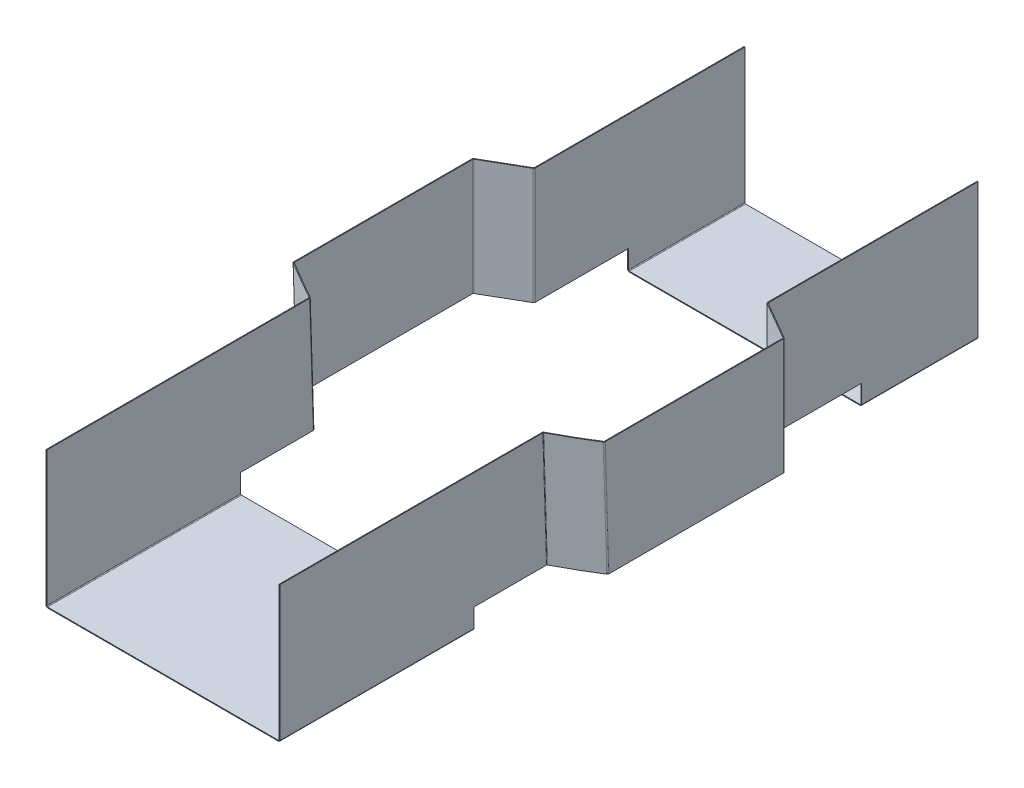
ISO-10303-21;
HEADER;
FILE_DESCRIPTION(('STEP AP214'),'2;1');
FILE_NAME('part.step','',(''),(''),'','','');
FILE_SCHEMA(('AUTOMOTIVE_DESIGN { 1 0 10303 214 1 1 1 1 }'));
ENDSEC;
DATA;
#1=APPLICATION_CONTEXT('core data for automotive mechanical design processes');
#2=APPLICATION_PROTOCOL_DEFINITION('international standard','automotive_design',2000,#1);
#3=PRODUCT_CONTEXT('',#1,'mechanical');
#4=PRODUCT('Part','Part','',(#3));
#5=PRODUCT_RELATED_PRODUCT_CATEGORY('part','',(#4));
#6=PRODUCT_DEFINITION_FORMATION('','',#4);
#7=PRODUCT_DEFINITION_CONTEXT('part definition',#1,'design');
#8=PRODUCT_DEFINITION('design','',#6,#7);
#9=PRODUCT_DEFINITION_SHAPE('','',#8);
#10=(LENGTH_UNIT() NAMED_UNIT(*) SI_UNIT(.MILLI.,.METRE.));
#11=(NAMED_UNIT(*) PLANE_ANGLE_UNIT() SI_UNIT($,.RADIAN.));
#12=(NAMED_UNIT(*) SI_UNIT($,.STERADIAN.) SOLID_ANGLE_UNIT());
#13=UNCERTAINTY_MEASURE_WITH_UNIT(LENGTH_MEASURE(1.E-05),#10,'distance_accuracy_value','');
#14=(GEOMETRIC_REPRESENTATION_CONTEXT(3) GLOBAL_UNCERTAINTY_ASSIGNED_CONTEXT((#13)) GLOBAL_UNIT_ASSIGNED_CONTEXT((#10,
#11,#12)) REPRESENTATION_CONTEXT('',''));
#15=CARTESIAN_POINT('',(0.,0.,0.));
#16=DIRECTION('',(0.,0.,1.));
#17=DIRECTION('',(1.,0.,0.));
#18=AXIS2_PLACEMENT_3D('',#15,#16,#17);
#19=CARTESIAN_POINT('',(-30.1643805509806,45.3443253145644,94.2938356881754));
#20=DIRECTION('',(1.,0.,0.));
#21=DIRECTION('',(0.,0.,1.));
#22=AXIS2_PLACEMENT_3D('',#19,#20,#21);
#23=PLANE('',#22);
#24=DIRECTION('',(0.,1.,0.));
#25=VECTOR('',#24,1.);
#26=CARTESIAN_POINT('',(-30.1643805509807,15.1643805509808,50.));
#27=LINE('',#26,#25);
#28=CARTESIAN_POINT('',(-30.1643805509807,10.4,50.));
#29=VERTEX_POINT('',#28);
#30=CARTESIAN_POINT('',(-30.1643805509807,15.1643805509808,50.));
#31=VERTEX_POINT('',#30);
#32=EDGE_CURVE('E1948',#29,#31,#27,.T.);
#33=ORIENTED_EDGE('',*,*,#32,.F.);
#34=DIRECTION('',(0.,0.,1.));
#35=VECTOR('',#34,1.);
#36=CARTESIAN_POINT('',(-30.1643805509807,10.4,94.2938356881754));
#37=LINE('',#36,#35);
#38=CARTESIAN_POINT('',(-30.1643805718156,10.4,100.));
#39=VERTEX_POINT('',#38);
#40=EDGE_CURVE('E2000',#29,#39,#37,.T.);
#41=ORIENTED_EDGE('',*,*,#40,.T.);
#42=DIRECTION('',(0.,-1.,0.));
#43=VECTOR('',#42,1.);
#44=CARTESIAN_POINT('',(-30.1643805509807,2.44059414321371,100.));
#45=LINE('',#44,#43);
#46=CARTESIAN_POINT('',(-30.1643805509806,45.1643805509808,100.));
#47=VERTEX_POINT('',#46);
#48=EDGE_CURVE('E1487',#47,#39,#45,.T.);
#49=ORIENTED_EDGE('',*,*,#48,.F.);
#50=DIRECTION('',(0.,0.,1.));
#51=VECTOR('',#50,1.);
#52=CARTESIAN_POINT('',(-30.1643805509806,45.1643805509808,-80.));
#53=LINE('',#52,#51);
#54=CARTESIAN_POINT('',(-30.1643805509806,45.1643805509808,32.2371158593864));
#55=VERTEX_POINT('',#54);
#56=EDGE_CURVE('E3206',#55,#47,#53,.T.);
#57=ORIENTED_EDGE('',*,*,#56,.F.);
#58=DIRECTION('',(0.,-0.999503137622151,-0.0315194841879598));
#59=VECTOR('',#58,1.);
#60=CARTESIAN_POINT('',(-30.1643805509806,47.2991704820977,32.3044367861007));
#61=LINE('',#60,#59);
#62=CARTESIAN_POINT('',(-30.1643805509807,15.1643805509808,31.2910612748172));
#63=VERTEX_POINT('',#62);
#64=EDGE_CURVE('E1964',#55,#63,#61,.T.);
#65=ORIENTED_EDGE('',*,*,#64,.T.);
#66=DIRECTION('',(0.,0.,-1.));
#67=VECTOR('',#66,1.);
#68=CARTESIAN_POINT('',(-30.1643805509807,15.1643805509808,-50.));
#69=LINE('',#68,#67);
#70=EDGE_CURVE('E3205',#31,#63,#69,.T.);
#71=ORIENTED_EDGE('',*,*,#70,.F.);
#72=EDGE_LOOP('',(#33,#41,#49,#57,#65,#71));
#73=FACE_BOUND('',#72,.T.);
#74=ADVANCED_FACE('F428',(#73),#23,.F.);
#75=CARTESIAN_POINT('',(-29.9643805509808,2.44059414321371,100.));
#76=DIRECTION('',(0.,0.,-1.));
#77=DIRECTION('',(0.,1.,0.));
#78=AXIS2_PLACEMENT_3D('',#75,#76,#77);
#79=PLANE('',#78);
#80=ORIENTED_EDGE('',*,*,#48,.T.);
#81=DIRECTION('',(1.,0.,0.));
#82=VECTOR('',#81,1.);
#83=CARTESIAN_POINT('',(-29.9643805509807,10.4,100.));
#84=LINE('',#83,#82);
#85=CARTESIAN_POINT('',(-29.9643805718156,10.4,100.));
#86=VERTEX_POINT('',#85);
#87=EDGE_CURVE('E1996',#39,#86,#84,.T.);
#88=ORIENTED_EDGE('',*,*,#87,.T.);
#89=DIRECTION('',(0.,-1.,0.));
#90=VECTOR('',#89,1.);
#91=CARTESIAN_POINT('',(-29.9643805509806,45.1643805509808,100.));
#92=LINE('',#91,#90);
#93=CARTESIAN_POINT('',(-29.9643805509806,45.1643805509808,100.));
#94=VERTEX_POINT('',#93);
#95=EDGE_CURVE('E1952',#94,#86,#92,.T.);
#96=ORIENTED_EDGE('',*,*,#95,.F.);
#97=DIRECTION('',(-1.,0.,0.));
#98=VECTOR('',#97,1.);
#99=CARTESIAN_POINT('',(-29.9643805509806,45.1643805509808,100.));
#100=LINE('',#99,#98);
#101=EDGE_CURVE('E1483',#94,#47,#100,.T.);
#102=ORIENTED_EDGE('',*,*,#101,.T.);
#103=EDGE_LOOP('',(#80,#88,#96,#102));
#104=FACE_BOUND('',#103,.T.);
#105=ADVANCED_FACE('F2113',(#104),#79,.F.);
#106=CARTESIAN_POINT('',(-29.9643805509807,15.1643805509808,50.));
#107=DIRECTION('',(0.,0.,1.));
#108=DIRECTION('',(0.,-1.,0.));
#109=AXIS2_PLACEMENT_3D('',#106,#107,#108);
#110=PLANE('',#109);
#111=DIRECTION('',(0.,1.,0.));
#112=VECTOR('',#111,1.);
#113=CARTESIAN_POINT('',(-29.9643805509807,15.1643805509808,50.));
#114=LINE('',#113,#112);
#115=CARTESIAN_POINT('',(-29.9643805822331,10.4,50.));
#116=VERTEX_POINT('',#115);
#117=CARTESIAN_POINT('',(-29.9643805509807,15.1643805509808,50.));
#118=VERTEX_POINT('',#117);
#119=EDGE_CURVE('E1944',#116,#118,#114,.T.);
#120=ORIENTED_EDGE('',*,*,#119,.F.);
#121=DIRECTION('',(-1.,0.,0.));
#122=VECTOR('',#121,1.);
#123=CARTESIAN_POINT('',(-29.9643805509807,10.4,50.));
#124=LINE('',#123,#122);
#125=EDGE_CURVE('E2003',#116,#29,#124,.T.);
#126=ORIENTED_EDGE('',*,*,#125,.T.);
#127=ORIENTED_EDGE('',*,*,#32,.T.);
#128=DIRECTION('',(-1.,0.,0.));
#129=VECTOR('',#128,1.);
#130=CARTESIAN_POINT('',(-29.9643805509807,15.1643805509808,50.));
#131=LINE('',#130,#129);
#132=EDGE_CURVE('E1478',#118,#31,#131,.T.);
#133=ORIENTED_EDGE('',*,*,#132,.F.);
#134=EDGE_LOOP('',(#120,#126,#127,#133));
#135=FACE_BOUND('',#134,.T.);
#136=ADVANCED_FACE('F2120',(#135),#110,.F.);
#137=CARTESIAN_POINT('',(-30.1643805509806,45.1643805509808,105.709000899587));
#138=DIRECTION('',(1.,0.,0.));
#139=DIRECTION('',(0.,0.,1.));
#140=AXIS2_PLACEMENT_3D('',#137,#138,#139);
#141=PLANE('',#140);
#142=DIRECTION('',(0.,1.,0.));
#143=VECTOR('',#142,1.);
#144=CARTESIAN_POINT('',(-30.1643805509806,45.1643805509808,-80.));
#145=LINE('',#144,#143);
#146=CARTESIAN_POINT('',(-30.1643805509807,10.4,-80.));
#147=VERTEX_POINT('',#146);
#148=CARTESIAN_POINT('',(-30.1643805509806,45.1643805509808,-80.));
#149=VERTEX_POINT('',#148);
#150=EDGE_CURVE('E1849',#147,#149,#145,.T.);
#151=ORIENTED_EDGE('',*,*,#150,.F.);
#152=DIRECTION('',(0.,0.,1.));
#153=VECTOR('',#152,1.);
#154=CARTESIAN_POINT('',(-30.1643805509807,10.4,105.709000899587));
#155=LINE('',#154,#153);
#156=CARTESIAN_POINT('',(-30.1643805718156,10.4,-50.));
#157=VERTEX_POINT('',#156);
#158=EDGE_CURVE('E437',#147,#157,#155,.T.);
#159=ORIENTED_EDGE('',*,*,#158,.T.);
#160=DIRECTION('',(0.,-1.,0.));
#161=VECTOR('',#160,1.);
#162=CARTESIAN_POINT('',(-30.1643805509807,15.1643805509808,-50.));
#163=LINE('',#162,#161);
#164=CARTESIAN_POINT('',(-30.1643805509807,15.1643805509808,-50.));
#165=VERTEX_POINT('',#164);
#166=EDGE_CURVE('E1856',#165,#157,#163,.T.);
#167=ORIENTED_EDGE('',*,*,#166,.F.);
#168=DIRECTION('',(0.,0.,-1.));
#169=VECTOR('',#168,1.);
#170=CARTESIAN_POINT('',(-30.1643805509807,15.1643805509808,-44.2909991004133));
#171=LINE('',#170,#169);
#172=CARTESIAN_POINT('',(-30.1643805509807,15.1643805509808,-25.9628332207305));
#173=VERTEX_POINT('',#172);
#174=EDGE_CURVE('E1864',#173,#165,#171,.T.);
#175=ORIENTED_EDGE('',*,*,#174,.F.);
#176=DIRECTION('',(0.,-1.,0.));
#177=VECTOR('',#176,1.);
#178=CARTESIAN_POINT('',(-30.1643805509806,45.1643805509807,-25.9628332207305));
#179=LINE('',#178,#177);
#180=CARTESIAN_POINT('',(-30.1643805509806,45.1643805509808,-25.9628332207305));
#181=VERTEX_POINT('',#180);
#182=EDGE_CURVE('E1839',#181,#173,#179,.T.);
#183=ORIENTED_EDGE('',*,*,#182,.F.);
#184=DIRECTION('',(0.,0.,1.));
#185=VECTOR('',#184,1.);
#186=CARTESIAN_POINT('',(-30.1643805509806,45.1643805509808,-74.2909991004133));
#187=LINE('',#186,#185);
#188=EDGE_CURVE('E1869',#149,#181,#187,.T.);
#189=ORIENTED_EDGE('',*,*,#188,.F.);
#190=EDGE_LOOP('',(#151,#159,#167,#175,#183,#189));
#191=FACE_BOUND('',#190,.T.);
#192=ADVANCED_FACE('F2037',(#191),#141,.F.);
#193=CARTESIAN_POINT('',(-29.9643805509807,15.1643805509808,-50.));
#194=DIRECTION('',(0.,0.,-1.));
#195=DIRECTION('',(0.,1.,0.));
#196=AXIS2_PLACEMENT_3D('',#193,#194,#195);
#197=PLANE('',#196);
#198=ORIENTED_EDGE('',*,*,#166,.T.);
#199=DIRECTION('',(1.,0.,0.));
#200=VECTOR('',#199,1.);
#201=CARTESIAN_POINT('',(-29.9643805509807,10.4,-50.));
#202=LINE('',#201,#200);
#203=CARTESIAN_POINT('',(-29.9643805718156,10.4,-50.));
#204=VERTEX_POINT('',#203);
#205=EDGE_CURVE('E2008',#157,#204,#202,.T.);
#206=ORIENTED_EDGE('',*,*,#205,.T.);
#207=DIRECTION('',(0.,-1.,0.));
#208=VECTOR('',#207,1.);
#209=CARTESIAN_POINT('',(-29.9643805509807,15.1643805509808,-50.));
#210=LINE('',#209,#208);
#211=CARTESIAN_POINT('',(-29.9643805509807,15.1643805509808,-50.));
#212=VERTEX_POINT('',#211);
#213=EDGE_CURVE('E1863',#212,#204,#210,.T.);
#214=ORIENTED_EDGE('',*,*,#213,.F.);
#215=DIRECTION('',(-1.,0.,0.));
#216=VECTOR('',#215,1.);
#217=CARTESIAN_POINT('',(-29.9643805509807,15.1643805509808,-50.));
#218=LINE('',#217,#216);
#219=EDGE_CURVE('E1852',#212,#165,#218,.T.);
#220=ORIENTED_EDGE('',*,*,#219,.T.);
#221=EDGE_LOOP('',(#198,#206,#214,#220));
#222=FACE_BOUND('',#221,.T.);
#223=ADVANCED_FACE('F2073',(#222),#197,.F.);
#224=CARTESIAN_POINT('',(-29.9643805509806,45.1643805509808,-80.));
#225=DIRECTION('',(0.,0.,1.));
#226=DIRECTION('',(0.,-1.,0.));
#227=AXIS2_PLACEMENT_3D('',#224,#225,#226);
#228=PLANE('',#227);
#229=DIRECTION('',(0.,1.,0.));
#230=VECTOR('',#229,1.);
#231=CARTESIAN_POINT('',(-29.9643805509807,14.4112252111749,-80.));
#232=LINE('',#231,#230);
#233=CARTESIAN_POINT('',(-29.9643805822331,10.4,-80.));
#234=VERTEX_POINT('',#233);
#235=CARTESIAN_POINT('',(-29.9643805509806,45.1643805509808,-80.));
#236=VERTEX_POINT('',#235);
#237=EDGE_CURVE('E432',#234,#236,#232,.T.);
#238=ORIENTED_EDGE('',*,*,#237,.F.);
#239=DIRECTION('',(-1.,0.,0.));
#240=VECTOR('',#239,1.);
#241=CARTESIAN_POINT('',(-29.9643805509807,10.4,-80.));
#242=LINE('',#241,#240);
#243=EDGE_CURVE('E12',#234,#147,#242,.T.);
#244=ORIENTED_EDGE('',*,*,#243,.T.);
#245=ORIENTED_EDGE('',*,*,#150,.T.);
#246=DIRECTION('',(-1.,0.,0.));
#247=VECTOR('',#246,1.);
#248=CARTESIAN_POINT('',(-29.9643805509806,45.1643805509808,-80.));
#249=LINE('',#248,#247);
#250=EDGE_CURVE('E1866',#236,#149,#249,.T.);
#251=ORIENTED_EDGE('',*,*,#250,.F.);
#252=EDGE_LOOP('',(#238,#244,#245,#251));
#253=FACE_BOUND('',#252,.T.);
#254=ADVANCED_FACE('F430',(#253),#228,.F.);
#255=CARTESIAN_POINT('',(-39.9643805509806,45.1643805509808,100.));
#256=DIRECTION('',(1.,0.,0.));
#257=DIRECTION('',(0.,0.,1.));
#258=AXIS2_PLACEMENT_3D('',#255,#256,#257);
#259=PLANE('',#258);
#260=DIRECTION('',(0.,0.,1.));
#261=VECTOR('',#260,1.);
#262=CARTESIAN_POINT('',(-39.9643805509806,45.1643805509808,-80.));
#263=LINE('',#262,#261);
#264=CARTESIAN_POINT('',(-39.964380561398,45.1643805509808,-19.8429203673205));
#265=VERTEX_POINT('',#264);
#266=CARTESIAN_POINT('',(-39.9643805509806,45.1643805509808,26.1141607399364));
#267=VERTEX_POINT('',#266);
#268=EDGE_CURVE('E1873',#265,#267,#263,.T.);
#269=ORIENTED_EDGE('',*,*,#268,.T.);
#270=DIRECTION('',(0.,-0.999503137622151,-0.0315194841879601));
#271=VECTOR('',#270,1.);
#272=CARTESIAN_POINT('',(-39.9643805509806,47.4920669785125,26.1875646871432));
#273=LINE('',#272,#271);
#274=CARTESIAN_POINT('',(-39.9643805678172,15.1643805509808,25.1681061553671));
#275=VERTEX_POINT('',#274);
#276=EDGE_CURVE('E1871',#267,#275,#273,.T.);
#277=ORIENTED_EDGE('',*,*,#276,.T.);
#278=DIRECTION('',(0.,0.,-1.));
#279=VECTOR('',#278,1.);
#280=CARTESIAN_POINT('',(-39.9643805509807,15.1643805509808,-50.));
#281=LINE('',#280,#279);
#282=CARTESIAN_POINT('',(-39.9643805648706,15.1643805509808,-19.8429203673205));
#283=VERTEX_POINT('',#282);
#284=EDGE_CURVE('E1821',#275,#283,#281,.T.);
#285=ORIENTED_EDGE('',*,*,#284,.T.);
#286=DIRECTION('',(0.,-1.,0.));
#287=VECTOR('',#286,1.);
#288=CARTESIAN_POINT('',(-39.9643805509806,45.1643805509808,-19.8429203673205));
#289=LINE('',#288,#287);
#290=EDGE_CURVE('E1804',#265,#283,#289,.T.);
#291=ORIENTED_EDGE('',*,*,#290,.F.);
#292=EDGE_LOOP('',(#269,#277,#285,#291));
#293=FACE_BOUND('',#292,.T.);
#294=ADVANCED_FACE('F1908',(#293),#259,.T.);
#295=CARTESIAN_POINT('',(-39.9643805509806,45.1643805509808,-80.));
#296=DIRECTION('',(0.,-1.,0.));
#297=DIRECTION('',(0.,0.,-1.));
#298=AXIS2_PLACEMENT_3D('',#295,#296,#297);
#299=PLANE('',#298);
#300=CARTESIAN_POINT('',(-39.9643805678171,45.1643805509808,26.1141607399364));
#301=CARTESIAN_POINT('',(-40.1643805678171,45.1643805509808,26.1141607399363));
#302=B_SPLINE_CURVE_WITH_KNOTS('',1,(#300,#301),.UNSPECIFIED.,.F.,.F.,(2,2),(0.,1.),.UNSPECIFIED.);
#303=CARTESIAN_POINT('',(-40.1643805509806,45.1643805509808,26.1141607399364));
#304=VERTEX_POINT('',#303);
#305=EDGE_CURVE('E1878',#267,#304,#302,.T.);
#306=ORIENTED_EDGE('',*,*,#305,.F.);
#307=ORIENTED_EDGE('',*,*,#268,.F.);
#308=DIRECTION('',(-1.,0.,0.));
#309=VECTOR('',#308,1.);
#310=CARTESIAN_POINT('',(-39.9643805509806,45.1643805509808,-19.8429203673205));
#311=LINE('',#310,#309);
#312=CARTESIAN_POINT('',(-40.1643805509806,45.1643805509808,-19.8429203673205));
#313=VERTEX_POINT('',#312);
#314=EDGE_CURVE('E1817',#265,#313,#311,.T.);
#315=ORIENTED_EDGE('',*,*,#314,.T.);
#316=DIRECTION('',(0.,0.,1.));
#317=VECTOR('',#316,1.);
#318=CARTESIAN_POINT('',(-40.1643805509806,45.1643805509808,-80.));
#319=LINE('',#318,#317);
#320=EDGE_CURVE('E1820',#313,#304,#319,.T.);
#321=ORIENTED_EDGE('',*,*,#320,.T.);
#322=EDGE_LOOP('',(#306,#307,#315,#321));
#323=FACE_BOUND('',#322,.T.);
#324=ADVANCED_FACE('F1902',(#323),#299,.F.);
#325=CARTESIAN_POINT('',(-40.1643805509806,45.1643805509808,100.));
#326=DIRECTION('',(1.,0.,0.));
#327=DIRECTION('',(0.,0.,1.));
#328=AXIS2_PLACEMENT_3D('',#325,#326,#327);
#329=PLANE('',#328);
#330=DIRECTION('',(0.,-0.999503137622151,-0.0315194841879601));
#331=VECTOR('',#330,1.);
#332=CARTESIAN_POINT('',(-40.1643805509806,47.4920669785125,26.1875646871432));
#333=LINE('',#332,#331);
#334=CARTESIAN_POINT('',(-40.1643805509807,15.1643805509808,25.1681061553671));
#335=VERTEX_POINT('',#334);
#336=EDGE_CURVE('E1889',#304,#335,#333,.T.);
#337=ORIENTED_EDGE('',*,*,#336,.F.);
#338=ORIENTED_EDGE('',*,*,#320,.F.);
#339=DIRECTION('',(0.,-1.,0.));
#340=VECTOR('',#339,1.);
#341=CARTESIAN_POINT('',(-40.1643805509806,45.1643805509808,-19.8429203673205));
#342=LINE('',#341,#340);
#343=CARTESIAN_POINT('',(-40.1643805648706,15.1643805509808,-19.8429203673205));
#344=VERTEX_POINT('',#343);
#345=EDGE_CURVE('E1822',#313,#344,#342,.T.);
#346=ORIENTED_EDGE('',*,*,#345,.T.);
#347=DIRECTION('',(0.,0.,-1.));
#348=VECTOR('',#347,1.);
#349=CARTESIAN_POINT('',(-40.1643805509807,15.1643805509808,-50.));
#350=LINE('',#349,#348);
#351=EDGE_CURVE('E1825',#335,#344,#350,.T.);
#352=ORIENTED_EDGE('',*,*,#351,.F.);
#353=EDGE_LOOP('',(#337,#338,#346,#352));
#354=FACE_BOUND('',#353,.T.);
#355=ADVANCED_FACE('F1901',(#354),#329,.F.);
#356=CARTESIAN_POINT('',(-39.9643805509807,15.1643805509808,-50.));
#357=DIRECTION('',(0.,1.,0.));
#358=DIRECTION('',(0.,0.,1.));
#359=AXIS2_PLACEMENT_3D('',#356,#357,#358);
#360=PLANE('',#359);
#361=CARTESIAN_POINT('',(-40.1643805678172,15.1643805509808,25.1681061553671));
#362=CARTESIAN_POINT('',(-39.9643805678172,15.1643805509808,25.1681061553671));
#363=B_SPLINE_CURVE_WITH_KNOTS('',1,(#361,#362),.UNSPECIFIED.,.F.,.F.,(2,2),(0.,1.),.UNSPECIFIED.);
#364=EDGE_CURVE('E1884',#335,#275,#363,.T.);
#365=ORIENTED_EDGE('',*,*,#364,.F.);
#366=ORIENTED_EDGE('',*,*,#351,.T.);
#367=DIRECTION('',(1.,0.,0.));
#368=VECTOR('',#367,1.);
#369=CARTESIAN_POINT('',(-39.9643805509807,15.1643805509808,-19.8429203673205));
#370=LINE('',#369,#368);
#371=EDGE_CURVE('E1792',#344,#283,#370,.T.);
#372=ORIENTED_EDGE('',*,*,#371,.T.);
#373=ORIENTED_EDGE('',*,*,#284,.F.);
#374=EDGE_LOOP('',(#365,#366,#372,#373));
#375=FACE_BOUND('',#374,.T.);
#376=ADVANCED_FACE('F1891',(#375),#360,.F.);
#377=CARTESIAN_POINT('',(11.9611087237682,45.1643805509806,-49.9375856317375));
#378=DIRECTION('',(0.,-1.,0.));
#379=DIRECTION('',(0.86602540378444,0.,-0.499999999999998));
#380=AXIS2_PLACEMENT_3D('',#377,#378,#379);
#381=PLANE('',#380);
#382=DIRECTION('',(-0.86602540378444,0.,0.499999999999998));
#383=VECTOR('',#382,1.);
#384=CARTESIAN_POINT('',(11.9611087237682,45.1643805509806,-49.9375856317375));
#385=LINE('',#384,#383);
#386=CARTESIAN_POINT('',(-30.1643805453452,45.1643805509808,-25.6164230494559));
#387=VERTEX_POINT('',#386);
#388=CARTESIAN_POINT('',(-39.8643805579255,45.1643805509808,-20.0161254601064));
#389=VERTEX_POINT('',#388);
#390=EDGE_CURVE('E1768',#387,#389,#385,.T.);
#391=ORIENTED_EDGE('',*,*,#390,.F.);
#392=DIRECTION('',(-0.499999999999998,0.,-0.86602540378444));
#393=VECTOR('',#392,1.);
#394=CARTESIAN_POINT('',(-30.1643805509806,45.1643805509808,-25.6164230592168));
#395=LINE('',#394,#393);
#396=CARTESIAN_POINT('',(-30.2643805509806,45.1643805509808,-25.7896281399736));
#397=VERTEX_POINT('',#396);
#398=EDGE_CURVE('E1789',#387,#397,#395,.T.);
#399=ORIENTED_EDGE('',*,*,#398,.T.);
#400=DIRECTION('',(-0.86602540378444,0.,0.499999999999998));
#401=VECTOR('',#400,1.);
#402=CARTESIAN_POINT('',(11.8611087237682,45.1643805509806,-50.1107907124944));
#403=LINE('',#402,#401);
#404=CARTESIAN_POINT('',(-39.9643805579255,45.1643805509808,-20.1893305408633));
#405=VERTEX_POINT('',#404);
#406=EDGE_CURVE('E1786',#397,#405,#403,.T.);
#407=ORIENTED_EDGE('',*,*,#406,.T.);
#408=DIRECTION('',(-0.499999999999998,0.,-0.86602540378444));
#409=VECTOR('',#408,1.);
#410=CARTESIAN_POINT('',(-39.8643805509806,45.1643805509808,-20.0161254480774));
#411=LINE('',#410,#409);
#412=EDGE_CURVE('E1781',#389,#405,#411,.T.);
#413=ORIENTED_EDGE('',*,*,#412,.F.);
#414=EDGE_LOOP('',(#391,#399,#407,#413));
#415=FACE_BOUND('',#414,.T.);
#416=ADVANCED_FACE('F1728',(#415),#381,.F.);
#417=CARTESIAN_POINT('',(-14.0196533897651,15.1643805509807,-34.9375856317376));
#418=DIRECTION('',(0.,1.,0.));
#419=DIRECTION('',(-0.86602540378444,0.,0.499999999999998));
#420=AXIS2_PLACEMENT_3D('',#417,#418,#419);
#421=PLANE('',#420);
#422=DIRECTION('',(0.86602540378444,0.,-0.499999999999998));
#423=VECTOR('',#422,1.);
#424=CARTESIAN_POINT('',(-14.1196533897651,15.1643805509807,-35.1107907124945));
#425=LINE('',#424,#423);
#426=CARTESIAN_POINT('',(-39.9643805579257,15.1643805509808,-20.1893305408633));
#427=VERTEX_POINT('',#426);
#428=CARTESIAN_POINT('',(-30.2643805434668,15.1643805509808,-25.7896281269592));
#429=VERTEX_POINT('',#428);
#430=EDGE_CURVE('E1782',#427,#429,#425,.T.);
#431=ORIENTED_EDGE('',*,*,#430,.T.);
#432=DIRECTION('',(0.499999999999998,0.,0.86602540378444));
#433=VECTOR('',#432,1.);
#434=CARTESIAN_POINT('',(-30.1643805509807,15.1643805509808,-25.6164230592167));
#435=LINE('',#434,#433);
#436=CARTESIAN_POINT('',(-30.1643805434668,15.1643805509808,-25.6164230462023));
#437=VERTEX_POINT('',#436);
#438=EDGE_CURVE('E1785',#429,#437,#435,.T.);
#439=ORIENTED_EDGE('',*,*,#438,.T.);
#440=DIRECTION('',(0.86602540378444,0.,-0.499999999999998));
#441=VECTOR('',#440,1.);
#442=CARTESIAN_POINT('',(-14.0196533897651,15.1643805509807,-34.9375856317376));
#443=LINE('',#442,#441);
#444=CARTESIAN_POINT('',(-39.8643805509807,15.1643805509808,-20.0161254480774));
#445=VERTEX_POINT('',#444);
#446=EDGE_CURVE('E1778',#445,#437,#443,.T.);
#447=ORIENTED_EDGE('',*,*,#446,.F.);
#448=DIRECTION('',(0.499999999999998,0.,0.86602540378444));
#449=VECTOR('',#448,1.);
#450=CARTESIAN_POINT('',(-39.8643805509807,15.1643805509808,-20.0161254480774));
#451=LINE('',#450,#449);
#452=EDGE_CURVE('E1801',#427,#445,#451,.T.);
#453=ORIENTED_EDGE('',*,*,#452,.F.);
#454=EDGE_LOOP('',(#431,#439,#447,#453));
#455=FACE_BOUND('',#454,.T.);
#456=ADVANCED_FACE('F2065',(#455),#421,.F.);
#457=CARTESIAN_POINT('',(-144.023463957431,45.1643805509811,39.8892092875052));
#458=DIRECTION('',(0.499999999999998,0.,0.86602540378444));
#459=DIRECTION('',(-0.86602540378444,0.,0.499999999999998));
#460=AXIS2_PLACEMENT_3D('',#457,#458,#459);
#461=PLANE('',#460);
#462=ORIENTED_EDGE('',*,*,#406,.F.);
#463=DIRECTION('',(0.,-1.,0.));
#464=VECTOR('',#463,1.);
#465=CARTESIAN_POINT('',(-30.2643805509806,45.1643805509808,-25.7896281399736));
#466=LINE('',#465,#464);
#467=EDGE_CURVE('E1777',#397,#429,#466,.T.);
#468=ORIENTED_EDGE('',*,*,#467,.T.);
#469=ORIENTED_EDGE('',*,*,#430,.F.);
#470=DIRECTION('',(0.,-1.,0.));
#471=VECTOR('',#470,1.);
#472=CARTESIAN_POINT('',(-39.9643805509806,45.1643805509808,-20.1893305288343));
#473=LINE('',#472,#471);
#474=EDGE_CURVE('E1806',#405,#427,#473,.T.);
#475=ORIENTED_EDGE('',*,*,#474,.F.);
#476=EDGE_LOOP('',(#462,#468,#469,#475));
#477=FACE_BOUND('',#476,.T.);
#478=ADVANCED_FACE('F2052',(#477),#461,.F.);
#479=CARTESIAN_POINT('',(-143.923463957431,45.1643805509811,40.0624143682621));
#480=DIRECTION('',(0.499999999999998,0.,0.86602540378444));
#481=DIRECTION('',(-0.86602540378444,0.,0.499999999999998));
#482=AXIS2_PLACEMENT_3D('',#479,#480,#481);
#483=PLANE('',#482);
#484=DIRECTION('',(0.,-1.,0.));
#485=VECTOR('',#484,1.);
#486=CARTESIAN_POINT('',(-30.1643805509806,45.1643805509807,-25.6164230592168));
#487=LINE('',#486,#485);
#488=EDGE_CURVE('E1797',#387,#437,#487,.T.);
#489=ORIENTED_EDGE('',*,*,#488,.F.);
#490=ORIENTED_EDGE('',*,*,#390,.T.);
#491=DIRECTION('',(0.,-1.,0.));
#492=VECTOR('',#491,1.);
#493=CARTESIAN_POINT('',(-39.8643805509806,45.1643805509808,-20.0161254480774));
#494=LINE('',#493,#492);
#495=EDGE_CURVE('E1776',#389,#445,#494,.T.);
#496=ORIENTED_EDGE('',*,*,#495,.T.);
#497=ORIENTED_EDGE('',*,*,#446,.T.);
#498=EDGE_LOOP('',(#489,#490,#496,#497));
#499=FACE_BOUND('',#498,.T.);
#500=ADVANCED_FACE('F2061',(#499),#483,.T.);
#501=CARTESIAN_POINT('',(-39.7643805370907,45.1643805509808,-19.8429203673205));
#502=DIRECTION('',(0.,-1.,0.));
#503=DIRECTION('',(0.,0.,-1.));
#504=AXIS2_PLACEMENT_3D('',#501,#502,#503);
#505=PLANE('',#504);
#506=ORIENTED_EDGE('',*,*,#412,.T.);
#507=CARTESIAN_POINT('',(-39.7643805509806,45.1643805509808,-19.8429203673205));
#508=DIRECTION('',(0.,1.,0.));
#509=DIRECTION('',(0.,0.,1.));
#510=AXIS2_PLACEMENT_3D('',#507,#508,#509);
#511=CIRCLE('',#510,0.400000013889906);
#512=EDGE_CURVE('E1811',#405,#313,#511,.T.);
#513=ORIENTED_EDGE('',*,*,#512,.T.);
#514=ORIENTED_EDGE('',*,*,#314,.F.);
#515=CARTESIAN_POINT('',(-39.7643805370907,45.1643805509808,-19.8429203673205));
#516=DIRECTION('',(0.,1.,0.));
#517=DIRECTION('',(0.,0.,1.));
#518=AXIS2_PLACEMENT_3D('',#515,#516,#517);
#519=CIRCLE('',#518,0.200000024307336);
#520=EDGE_CURVE('E1809',#389,#265,#519,.T.);
#521=ORIENTED_EDGE('',*,*,#520,.F.);
#522=EDGE_LOOP('',(#506,#513,#514,#521));
#523=FACE_BOUND('',#522,.T.);
#524=ADVANCED_FACE('F2183',(#523),#505,.F.);
#525=CARTESIAN_POINT('',(-39.7643805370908,15.1643805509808,-19.8429203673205));
#526=DIRECTION('',(0.,1.,0.));
#527=DIRECTION('',(0.,0.,1.));
#528=AXIS2_PLACEMENT_3D('',#525,#526,#527);
#529=PLANE('',#528);
#530=CARTESIAN_POINT('',(-39.7643805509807,15.1643805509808,-19.8429203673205));
#531=DIRECTION('',(0.,1.,0.));
#532=DIRECTION('',(0.,0.,1.));
#533=AXIS2_PLACEMENT_3D('',#530,#531,#532);
#534=CIRCLE('',#533,0.400000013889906);
#535=EDGE_CURVE('E1805',#344,#427,#534,.F.);
#536=ORIENTED_EDGE('',*,*,#535,.T.);
#537=ORIENTED_EDGE('',*,*,#452,.T.);
#538=CARTESIAN_POINT('',(-39.7643805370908,15.1643805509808,-19.8429203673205));
#539=DIRECTION('',(0.,-1.,0.));
#540=DIRECTION('',(0.,0.,-1.));
#541=AXIS2_PLACEMENT_3D('',#538,#539,#540);
#542=CIRCLE('',#541,0.200000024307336);
#543=EDGE_CURVE('E1816',#283,#445,#542,.T.);
#544=ORIENTED_EDGE('',*,*,#543,.F.);
#545=ORIENTED_EDGE('',*,*,#371,.F.);
#546=EDGE_LOOP('',(#536,#537,#544,#545));
#547=FACE_BOUND('',#546,.T.);
#548=ADVANCED_FACE('F2192',(#547),#529,.F.);
#549=CARTESIAN_POINT('',(-39.7643805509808,0.162069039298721,-19.8429203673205));
#550=DIRECTION('',(0.,1.,0.));
#551=DIRECTION('',(0.,0.,1.));
#552=AXIS2_PLACEMENT_3D('',#549,#550,#551);
#553=CYLINDRICAL_SURFACE('',#552,0.200000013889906);
#554=ORIENTED_EDGE('',*,*,#290,.T.);
#555=ORIENTED_EDGE('',*,*,#543,.T.);
#556=ORIENTED_EDGE('',*,*,#495,.F.);
#557=ORIENTED_EDGE('',*,*,#520,.T.);
#558=EDGE_LOOP('',(#554,#555,#556,#557));
#559=FACE_BOUND('',#558,.T.);
#560=ADVANCED_FACE('F2195',(#559),#553,.F.);
#561=CARTESIAN_POINT('',(-39.7643805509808,0.162069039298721,-19.8429203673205));
#562=DIRECTION('',(0.,1.,0.));
#563=DIRECTION('',(0.,0.,1.));
#564=AXIS2_PLACEMENT_3D('',#561,#562,#563);
#565=CYLINDRICAL_SURFACE('',#564,0.400000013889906);
#566=ORIENTED_EDGE('',*,*,#345,.F.);
#567=ORIENTED_EDGE('',*,*,#512,.F.);
#568=ORIENTED_EDGE('',*,*,#474,.T.);
#569=ORIENTED_EDGE('',*,*,#535,.F.);
#570=EDGE_LOOP('',(#566,#567,#568,#569));
#571=FACE_BOUND('',#570,.T.);
#572=ADVANCED_FACE('F2205',(#571),#565,.T.);
#573=CARTESIAN_POINT('',(-30.3643805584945,45.1643805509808,-25.962833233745));
#574=DIRECTION('',(0.,1.,0.));
#575=DIRECTION('',(0.,0.,1.));
#576=AXIS2_PLACEMENT_3D('',#573,#574,#575);
#577=PLANE('',#576);
#578=DIRECTION('',(-1.,0.,0.));
#579=VECTOR('',#578,1.);
#580=CARTESIAN_POINT('',(-29.9643805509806,45.1643805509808,-25.9628332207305));
#581=LINE('',#580,#579);
#582=CARTESIAN_POINT('',(-29.9643805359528,45.1643805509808,-25.9628332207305));
#583=VERTEX_POINT('',#582);
#584=EDGE_CURVE('E1808',#583,#181,#581,.T.);
#585=ORIENTED_EDGE('',*,*,#584,.T.);
#586=CARTESIAN_POINT('',(-30.3643805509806,45.1643805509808,-25.9628332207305));
#587=DIRECTION('',(0.,1.,0.));
#588=DIRECTION('',(0.,0.,1.));
#589=AXIS2_PLACEMENT_3D('',#586,#587,#588);
#590=CIRCLE('',#589,0.200000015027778);
#591=EDGE_CURVE('E1843',#181,#397,#590,.F.);
#592=ORIENTED_EDGE('',*,*,#591,.T.);
#593=ORIENTED_EDGE('',*,*,#398,.F.);
#594=CARTESIAN_POINT('',(-30.3643805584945,45.1643805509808,-25.962833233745));
#595=DIRECTION('',(0.,-1.,0.));
#596=DIRECTION('',(0.,0.,-1.));
#597=AXIS2_PLACEMENT_3D('',#594,#595,#596);
#598=CIRCLE('',#597,0.400000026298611);
#599=EDGE_CURVE('E1836',#583,#387,#598,.T.);
#600=ORIENTED_EDGE('',*,*,#599,.F.);
#601=EDGE_LOOP('',(#585,#592,#593,#600));
#602=FACE_BOUND('',#601,.T.);
#603=ADVANCED_FACE('F2045',(#602),#577,.T.);
#604=CARTESIAN_POINT('',(-30.3643805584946,15.1643805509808,-25.962833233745));
#605=DIRECTION('',(0.,-1.,0.));
#606=DIRECTION('',(0.,0.,-1.));
#607=AXIS2_PLACEMENT_3D('',#604,#605,#606);
#608=PLANE('',#607);
#609=CARTESIAN_POINT('',(-30.3643805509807,15.1643805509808,-25.9628332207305));
#610=DIRECTION('',(0.,1.,0.));
#611=DIRECTION('',(0.,0.,1.));
#612=AXIS2_PLACEMENT_3D('',#609,#610,#611);
#613=CIRCLE('',#612,0.200000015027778);
#614=EDGE_CURVE('E1840',#429,#173,#613,.T.);
#615=ORIENTED_EDGE('',*,*,#614,.T.);
#616=DIRECTION('',(1.,0.,0.));
#617=VECTOR('',#616,1.);
#618=CARTESIAN_POINT('',(-29.9643805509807,15.1643805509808,-25.9628332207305));
#619=LINE('',#618,#617);
#620=CARTESIAN_POINT('',(-29.9643805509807,15.1643805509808,-25.9628332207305));
#621=VERTEX_POINT('',#620);
#622=EDGE_CURVE('E1800',#173,#621,#619,.T.);
#623=ORIENTED_EDGE('',*,*,#622,.T.);
#624=CARTESIAN_POINT('',(-30.3643805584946,15.1643805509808,-25.962833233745));
#625=DIRECTION('',(0.,1.,0.));
#626=DIRECTION('',(0.,0.,1.));
#627=AXIS2_PLACEMENT_3D('',#624,#625,#626);
#628=CIRCLE('',#627,0.400000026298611);
#629=EDGE_CURVE('E1799',#437,#621,#628,.T.);
#630=ORIENTED_EDGE('',*,*,#629,.F.);
#631=ORIENTED_EDGE('',*,*,#438,.F.);
#632=EDGE_LOOP('',(#615,#623,#630,#631));
#633=FACE_BOUND('',#632,.T.);
#634=ADVANCED_FACE('F2067',(#633),#608,.T.);
#635=CARTESIAN_POINT('',(-30.3643805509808,0.160255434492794,-25.9628332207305));
#636=DIRECTION('',(0.,1.,0.));
#637=DIRECTION('',(0.,0.,1.));
#638=AXIS2_PLACEMENT_3D('',#635,#636,#637);
#639=CYLINDRICAL_SURFACE('',#638,0.400000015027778);
#640=ORIENTED_EDGE('',*,*,#488,.T.);
#641=ORIENTED_EDGE('',*,*,#629,.T.);
#642=DIRECTION('',(0.,-1.,0.));
#643=VECTOR('',#642,1.);
#644=CARTESIAN_POINT('',(-29.9643805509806,45.1643805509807,-25.9628332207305));
#645=LINE('',#644,#643);
#646=EDGE_CURVE('E1859',#583,#621,#645,.T.);
#647=ORIENTED_EDGE('',*,*,#646,.F.);
#648=ORIENTED_EDGE('',*,*,#599,.T.);
#649=EDGE_LOOP('',(#640,#641,#647,#648));
#650=FACE_BOUND('',#649,.T.);
#651=ADVANCED_FACE('F2058',(#650),#639,.T.);
#652=CARTESIAN_POINT('',(-30.3643805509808,0.160255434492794,-25.9628332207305));
#653=DIRECTION('',(0.,1.,0.));
#654=DIRECTION('',(0.,0.,1.));
#655=AXIS2_PLACEMENT_3D('',#652,#653,#654);
#656=CYLINDRICAL_SURFACE('',#655,0.200000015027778);
#657=ORIENTED_EDGE('',*,*,#467,.F.);
#658=ORIENTED_EDGE('',*,*,#591,.F.);
#659=ORIENTED_EDGE('',*,*,#182,.T.);
#660=ORIENTED_EDGE('',*,*,#614,.F.);
#661=EDGE_LOOP('',(#657,#658,#659,#660));
#662=FACE_BOUND('',#661,.T.);
#663=ADVANCED_FACE('F2047',(#662),#656,.F.);
#664=CARTESIAN_POINT('',(-29.9643805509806,45.1643805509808,105.709000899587));
#665=DIRECTION('',(1.,0.,0.));
#666=DIRECTION('',(0.,0.,1.));
#667=AXIS2_PLACEMENT_3D('',#664,#665,#666);
#668=PLANE('',#667);
#669=DIRECTION('',(0.,0.,1.));
#670=VECTOR('',#669,1.);
#671=CARTESIAN_POINT('',(-29.9643805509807,10.4,105.709000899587));
#672=LINE('',#671,#670);
#673=EDGE_CURVE('E2006',#234,#204,#672,.T.);
#674=ORIENTED_EDGE('',*,*,#673,.F.);
#675=ORIENTED_EDGE('',*,*,#237,.T.);
#676=DIRECTION('',(0.,0.,1.));
#677=VECTOR('',#676,1.);
#678=CARTESIAN_POINT('',(-29.9643805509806,45.1643805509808,-74.2909991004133));
#679=LINE('',#678,#677);
#680=EDGE_CURVE('E1855',#236,#583,#679,.T.);
#681=ORIENTED_EDGE('',*,*,#680,.T.);
#682=ORIENTED_EDGE('',*,*,#646,.T.);
#683=DIRECTION('',(0.,0.,-1.));
#684=VECTOR('',#683,1.);
#685=CARTESIAN_POINT('',(-29.9643805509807,15.1643805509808,-44.2909991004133));
#686=LINE('',#685,#684);
#687=EDGE_CURVE('E1861',#621,#212,#686,.T.);
#688=ORIENTED_EDGE('',*,*,#687,.T.);
#689=ORIENTED_EDGE('',*,*,#213,.T.);
#690=EDGE_LOOP('',(#674,#675,#681,#682,#688,#689));
#691=FACE_BOUND('',#690,.T.);
#692=ADVANCED_FACE('F2027',(#691),#668,.T.);
#693=CARTESIAN_POINT('',(-29.9643805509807,15.1643805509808,-44.2909991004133));
#694=DIRECTION('',(0.,1.,0.));
#695=DIRECTION('',(0.,0.,1.));
#696=AXIS2_PLACEMENT_3D('',#693,#694,#695);
#697=PLANE('',#696);
#698=ORIENTED_EDGE('',*,*,#622,.F.);
#699=ORIENTED_EDGE('',*,*,#174,.T.);
#700=ORIENTED_EDGE('',*,*,#219,.F.);
#701=ORIENTED_EDGE('',*,*,#687,.F.);
#702=EDGE_LOOP('',(#698,#699,#700,#701));
#703=FACE_BOUND('',#702,.T.);
#704=ADVANCED_FACE('F2070',(#703),#697,.F.);
#705=CARTESIAN_POINT('',(-29.9643805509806,45.1643805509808,-74.2909991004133));
#706=DIRECTION('',(0.,-1.,0.));
#707=DIRECTION('',(0.,0.,-1.));
#708=AXIS2_PLACEMENT_3D('',#705,#706,#707);
#709=PLANE('',#708);
#710=ORIENTED_EDGE('',*,*,#584,.F.);
#711=ORIENTED_EDGE('',*,*,#680,.F.);
#712=ORIENTED_EDGE('',*,*,#250,.T.);
#713=ORIENTED_EDGE('',*,*,#188,.T.);
#714=EDGE_LOOP('',(#710,#711,#712,#713));
#715=FACE_BOUND('',#714,.T.);
#716=ADVANCED_FACE('F2032',(#715),#709,.F.);
#717=CARTESIAN_POINT('',(-40.1643805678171,45.1643805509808,26.1141607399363));
#718=CARTESIAN_POINT('',(-40.1643805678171,45.1638295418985,26.1841042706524));
#719=CARTESIAN_POINT('',(-40.1457538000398,45.1632834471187,26.2536376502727));
#720=CARTESIAN_POINT('',(-40.1107907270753,45.1630277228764,26.3142175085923));
#721=CARTESIAN_POINT('',(-39.9643805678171,45.1643805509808,26.1141607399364));
#722=CARTESIAN_POINT('',(-39.9643805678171,45.1649315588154,26.1491585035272));
#723=CARTESIAN_POINT('',(-39.9550671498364,45.165481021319,26.1839512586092));
#724=CARTESIAN_POINT('',(-39.9375856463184,45.1661796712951,26.2142671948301));
#725=B_SPLINE_SURFACE_WITH_KNOTS('',1,3,((#717,#718,#719,#720),(#721,#722,#723,#724)),
.UNSPECIFIED.,.F.,.F.,.F.,(2,2),(4,4),(0.,1.),(0.,1.),.UNSPECIFIED.);
#726=CARTESIAN_POINT('',(-40.1643805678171,45.1643805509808,26.1141607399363));
#727=CARTESIAN_POINT('',(-40.1643805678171,45.1638295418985,26.1841042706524));
#728=CARTESIAN_POINT('',(-40.1457538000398,45.1632834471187,26.2536376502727));
#729=CARTESIAN_POINT('',(-40.1107907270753,45.1630277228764,26.3142175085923));
#730=B_SPLINE_CURVE_WITH_KNOTS('',3,(#726,#727,#728,#729),.UNSPECIFIED.,.F.,.F.,(4,4),(0.,1.),.UNSPECIFIED.);
#731=CARTESIAN_POINT('',(-40.1107907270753,45.1630277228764,26.3142175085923));
#732=VERTEX_POINT('',#731);
#733=EDGE_CURVE('E1602',#304,#732,#730,.T.);
#734=CARTESIAN_POINT('',(-40.1107907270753,45.1630277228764,26.3142175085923));
#735=CARTESIAN_POINT('',(-39.9375856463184,45.1661796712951,26.2142671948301));
#736=B_SPLINE_CURVE_WITH_KNOTS('',1,(#734,#735),.UNSPECIFIED.,.F.,.F.,(2,2),(0.,1.),.UNSPECIFIED.);
#737=CARTESIAN_POINT('',(-39.9375856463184,45.1661796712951,26.2142671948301));
#738=VERTEX_POINT('',#737);
#739=EDGE_CURVE('E3134',#732,#738,#736,.T.);
#740=CARTESIAN_POINT('',(-39.9375856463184,45.1661796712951,26.2142671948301));
#741=CARTESIAN_POINT('',(-39.9550671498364,45.165481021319,26.1839512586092));
#742=CARTESIAN_POINT('',(-39.9643805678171,45.1649315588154,26.1491585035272));
#743=CARTESIAN_POINT('',(-39.9643805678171,45.1643805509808,26.1141607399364));
#744=B_SPLINE_CURVE_WITH_KNOTS('',3,(#740,#741,#742,#743),.UNSPECIFIED.,.F.,.F.,(4,4),(0.,1.),.UNSPECIFIED.);
#745=EDGE_CURVE('E3129',#267,#738,#744,.F.);
#746=ORIENTED_EDGE('',*,*,#305,.T.);
#747=ORIENTED_EDGE('',*,*,#733,.T.);
#748=ORIENTED_EDGE('',*,*,#739,.T.);
#749=ORIENTED_EDGE('',*,*,#745,.F.);
#750=EDGE_LOOP('',(#746,#747,#748,#749));
#751=FACE_BOUND('',#750,.T.);
#752=ADVANCED_FACE('F1724',(#751),#725,.F.);
#753=CARTESIAN_POINT('',(-39.7643805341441,45.1693316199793,26.1143168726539));
#754=DIRECTION('',(2.26350590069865E-12,-0.999503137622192,-0.0315194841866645));
#755=DIRECTION('',(0.,0.0315194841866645,-0.999503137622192));
#756=AXIS2_PLACEMENT_3D('',#753,#754,#755);
#757=PLANE('',#756);
#758=ORIENTED_EDGE('',*,*,#739,.F.);
#759=CARTESIAN_POINT('',(-39.7643805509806,45.1693316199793,26.1143168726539));
#760=DIRECTION('',(0.,-0.999503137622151,-0.0315194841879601));
#761=DIRECTION('',(0.,0.0315194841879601,-0.999503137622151));
#762=AXIS2_PLACEMENT_3D('',#759,#760,#761);
#763=CIRCLE('',#762,0.400000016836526);
#764=CARTESIAN_POINT('',(-39.9643805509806,45.1584129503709,26.4605549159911));
#765=VERTEX_POINT('',#764);
#766=EDGE_CURVE('E1632',#732,#765,#763,.F.);
#767=ORIENTED_EDGE('',*,*,#766,.T.);
#768=DIRECTION('',(-0.499999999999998,-0.0272966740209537,0.865595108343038));
#769=VECTOR('',#768,1.);
#770=CARTESIAN_POINT('',(-39.8643805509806,45.1638722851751,26.2874358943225));
#771=LINE('',#770,#769);
#772=CARTESIAN_POINT('',(-39.8643805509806,45.1638722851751,26.2874358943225));
#773=VERTEX_POINT('',#772);
#774=EDGE_CURVE('E1608',#773,#765,#771,.T.);
#775=ORIENTED_EDGE('',*,*,#774,.F.);
#776=CARTESIAN_POINT('',(-39.7643805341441,45.1693316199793,26.1143168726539));
#777=DIRECTION('',(-2.26350590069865E-12,0.999503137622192,0.0315194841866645));
#778=DIRECTION('',(0.,0.0315194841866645,-0.999503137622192));
#779=AXIS2_PLACEMENT_3D('',#776,#777,#778);
#780=CIRCLE('',#779,0.200000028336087);
#781=EDGE_CURVE('E1642',#738,#773,#780,.T.);
#782=ORIENTED_EDGE('',*,*,#781,.F.);
#783=EDGE_LOOP('',(#758,#767,#775,#782));
#784=FACE_BOUND('',#783,.T.);
#785=ADVANCED_FACE('F2275',(#784),#757,.F.);
#786=CARTESIAN_POINT('',(-39.7643805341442,15.1693316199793,25.1682622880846));
#787=DIRECTION('',(0.,0.999503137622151,0.0315194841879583));
#788=DIRECTION('',(0.,-0.0315194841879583,0.999503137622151));
#789=AXIS2_PLACEMENT_3D('',#786,#787,#788);
#790=PLANE('',#789);
#791=DIRECTION('',(-0.499999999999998,-0.0272966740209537,0.865595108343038));
#792=VECTOR('',#791,1.);
#793=CARTESIAN_POINT('',(-39.8643805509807,15.1638722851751,25.3413813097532));
#794=LINE('',#793,#792);
#795=CARTESIAN_POINT('',(-39.864380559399,15.1638722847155,25.3413813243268));
#796=VERTEX_POINT('',#795);
#797=CARTESIAN_POINT('',(-39.9643805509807,15.1584129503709,25.5145003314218));
#798=VERTEX_POINT('',#797);
#799=EDGE_CURVE('E1626',#796,#798,#794,.T.);
#800=ORIENTED_EDGE('',*,*,#799,.T.);
#801=CARTESIAN_POINT('',(-39.7643805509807,15.1693316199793,25.1682622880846));
#802=DIRECTION('',(0.,-0.999503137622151,-0.0315194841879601));
#803=DIRECTION('',(0.,0.0315194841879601,-0.999503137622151));
#804=AXIS2_PLACEMENT_3D('',#801,#802,#803);
#805=CIRCLE('',#804,0.400000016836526);
#806=CARTESIAN_POINT('',(-40.1107907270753,15.1630277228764,25.3681629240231));
#807=VERTEX_POINT('',#806);
#808=EDGE_CURVE('E1635',#798,#807,#805,.T.);
#809=ORIENTED_EDGE('',*,*,#808,.T.);
#810=CARTESIAN_POINT('',(-39.9375856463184,15.1661796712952,25.2682126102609));
#811=CARTESIAN_POINT('',(-40.1107907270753,15.1630277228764,25.3681629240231));
#812=B_SPLINE_CURVE_WITH_KNOTS('',1,(#810,#811),.UNSPECIFIED.,.F.,.F.,(2,2),(0.,1.),.UNSPECIFIED.);
#813=CARTESIAN_POINT('',(-39.93758564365,15.1661796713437,25.268212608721));
#814=VERTEX_POINT('',#813);
#815=EDGE_CURVE('E1756',#807,#814,#812,.F.);
#816=ORIENTED_EDGE('',*,*,#815,.T.);
#817=CARTESIAN_POINT('',(-39.7643805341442,15.1693316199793,25.1682622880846));
#818=DIRECTION('',(0.,-0.999503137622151,-0.0315194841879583));
#819=DIRECTION('',(0.,0.0315194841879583,-0.999503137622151));
#820=AXIS2_PLACEMENT_3D('',#817,#818,#819);
#821=CIRCLE('',#820,0.200000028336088);
#822=EDGE_CURVE('E1683',#796,#814,#821,.T.);
#823=ORIENTED_EDGE('',*,*,#822,.F.);
#824=EDGE_LOOP('',(#800,#809,#816,#823));
#825=FACE_BOUND('',#824,.T.);
#826=ADVANCED_FACE('F1658',(#825),#790,.F.);
#827=CARTESIAN_POINT('',(-40.1107907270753,15.1630277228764,25.3681629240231));
#828=CARTESIAN_POINT('',(-40.1457538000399,15.1632834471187,25.3075830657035));
#829=CARTESIAN_POINT('',(-40.1643805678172,15.1638295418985,25.2380496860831));
#830=CARTESIAN_POINT('',(-40.1643805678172,15.1643805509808,25.1681061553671));
#831=CARTESIAN_POINT('',(-39.9375856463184,15.1661796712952,25.2682126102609));
#832=CARTESIAN_POINT('',(-39.9550671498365,15.165481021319,25.2378966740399));
#833=CARTESIAN_POINT('',(-39.9643805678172,15.1649315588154,25.2031039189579));
#834=CARTESIAN_POINT('',(-39.9643805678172,15.1643805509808,25.1681061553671));
#835=B_SPLINE_SURFACE_WITH_KNOTS('',1,3,((#827,#828,#829,#830),(#831,#832,#833,#834)),
.UNSPECIFIED.,.F.,.F.,.F.,(2,2),(4,4),(0.,1.),(0.,1.),.UNSPECIFIED.);
#836=CARTESIAN_POINT('',(-40.1107907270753,15.1630277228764,25.3681629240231));
#837=CARTESIAN_POINT('',(-40.1457538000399,15.1632834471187,25.3075830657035));
#838=CARTESIAN_POINT('',(-40.1643805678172,15.1638295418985,25.2380496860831));
#839=CARTESIAN_POINT('',(-40.1643805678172,15.1643805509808,25.1681061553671));
#840=B_SPLINE_CURVE_WITH_KNOTS('',3,(#836,#837,#838,#839),.UNSPECIFIED.,.F.,.F.,(4,4),(0.,1.),.UNSPECIFIED.);
#841=EDGE_CURVE('E1693',#807,#335,#840,.T.);
#842=CARTESIAN_POINT('',(-39.9643805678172,15.1643805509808,25.1681061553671));
#843=CARTESIAN_POINT('',(-39.9643805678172,15.1649315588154,25.2031039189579));
#844=CARTESIAN_POINT('',(-39.9550671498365,15.165481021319,25.2378966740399));
#845=CARTESIAN_POINT('',(-39.9375856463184,15.1661796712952,25.2682126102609));
#846=B_SPLINE_CURVE_WITH_KNOTS('',3,(#842,#843,#844,#845),.UNSPECIFIED.,.F.,.F.,(4,4),(0.,1.),.UNSPECIFIED.);
#847=EDGE_CURVE('E1682',#814,#275,#846,.F.);
#848=ORIENTED_EDGE('',*,*,#841,.T.);
#849=ORIENTED_EDGE('',*,*,#364,.T.);
#850=ORIENTED_EDGE('',*,*,#847,.F.);
#851=ORIENTED_EDGE('',*,*,#815,.F.);
#852=EDGE_LOOP('',(#848,#849,#850,#851));
#853=FACE_BOUND('',#852,.T.);
#854=ADVANCED_FACE('F1656',(#853),#835,.F.);
#855=CARTESIAN_POINT('',(-39.7643805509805,60.1815287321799,26.5877288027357));
#856=DIRECTION('',(0.,-0.999503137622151,-0.0315194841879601));
#857=DIRECTION('',(0.,0.0315194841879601,-0.999503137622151));
#858=AXIS2_PLACEMENT_3D('',#855,#856,#857);
#859=CYLINDRICAL_SURFACE('',#858,0.200000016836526);
#860=ORIENTED_EDGE('',*,*,#822,.T.);
#861=ORIENTED_EDGE('',*,*,#847,.T.);
#862=ORIENTED_EDGE('',*,*,#276,.F.);
#863=ORIENTED_EDGE('',*,*,#745,.T.);
#864=ORIENTED_EDGE('',*,*,#781,.T.);
#865=DIRECTION('',(0.,-0.999503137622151,-0.03151948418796));
#866=VECTOR('',#865,1.);
#867=CARTESIAN_POINT('',(-39.8643805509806,47.4866076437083,26.3606837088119));
#868=LINE('',#867,#866);
#869=EDGE_CURVE('E1629',#773,#796,#868,.T.);
#870=ORIENTED_EDGE('',*,*,#869,.T.);
#871=EDGE_LOOP('',(#860,#861,#862,#863,#864,#870));
#872=FACE_BOUND('',#871,.T.);
#873=ADVANCED_FACE('F1645',(#872),#859,.F.);
#874=CARTESIAN_POINT('',(-39.7643805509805,60.1815287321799,26.5877288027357));
#875=DIRECTION('',(0.,-0.999503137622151,-0.0315194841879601));
#876=DIRECTION('',(0.,0.0315194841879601,-0.999503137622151));
#877=AXIS2_PLACEMENT_3D('',#874,#875,#876);
#878=CYLINDRICAL_SURFACE('',#877,0.400000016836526);
#879=ORIENTED_EDGE('',*,*,#808,.F.);
#880=DIRECTION('',(0.,-0.999503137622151,-0.03151948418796));
#881=VECTOR('',#880,1.);
#882=CARTESIAN_POINT('',(-39.9643805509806,47.4811483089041,26.5338027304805));
#883=LINE('',#882,#881);
#884=EDGE_CURVE('E1603',#765,#798,#883,.T.);
#885=ORIENTED_EDGE('',*,*,#884,.F.);
#886=ORIENTED_EDGE('',*,*,#766,.F.);
#887=ORIENTED_EDGE('',*,*,#733,.F.);
#888=ORIENTED_EDGE('',*,*,#336,.T.);
#889=ORIENTED_EDGE('',*,*,#841,.F.);
#890=EDGE_LOOP('',(#879,#885,#886,#887,#888,#889));
#891=FACE_BOUND('',#890,.T.);
#892=ADVANCED_FACE('F1655',(#891),#878,.T.);
#893=CARTESIAN_POINT('',(-100.257455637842,13.8898585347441,-9.58408625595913));
#894=DIRECTION('',(-0.0272966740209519,0.999503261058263,0.015751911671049));
#895=DIRECTION('',(0.865595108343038,0.015751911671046,0.500496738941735));
#896=AXIS2_PLACEMENT_3D('',#893,#894,#895);
#897=PLANE('',#896);
#898=CARTESIAN_POINT('',(-30.2643805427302,15.1599377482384,31.1176299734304));
#899=CARTESIAN_POINT('',(-30.1643805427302,15.1653970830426,30.9445109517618));
#900=B_SPLINE_CURVE_WITH_KNOTS('',1,(#898,#899),.UNSPECIFIED.,.F.,.F.,(2,2),(0.,1.),.UNSPECIFIED.);
#901=CARTESIAN_POINT('',(-30.2643805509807,15.159937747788,31.1176299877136));
#902=VERTEX_POINT('',#901);
#903=CARTESIAN_POINT('',(-30.1643805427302,15.1653970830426,30.9445109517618));
#904=VERTEX_POINT('',#903);
#905=EDGE_CURVE('E1997',#902,#904,#900,.T.);
#906=ORIENTED_EDGE('',*,*,#905,.F.);
#907=DIRECTION('',(-0.865595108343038,-0.015751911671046,-0.500496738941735));
#908=VECTOR('',#907,1.);
#909=CARTESIAN_POINT('',(-100.357455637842,13.88439919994,-9.41096723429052));
#910=LINE('',#909,#908);
#911=CARTESIAN_POINT('',(-35.156275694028,15.0709161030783,28.2890816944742));
#912=VERTEX_POINT('',#911);
#913=EDGE_CURVE('E1625',#902,#912,#910,.T.);
#914=ORIENTED_EDGE('',*,*,#913,.T.);
#915=DIRECTION('',(0.499999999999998,0.0272966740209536,-0.865595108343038));
#916=VECTOR('',#915,1.);
#917=CARTESIAN_POINT('',(-35.056275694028,15.0763754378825,28.1159626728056));
#918=LINE('',#917,#916);
#919=CARTESIAN_POINT('',(-35.056275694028,15.0763754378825,28.1159626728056));
#920=VERTEX_POINT('',#919);
#921=EDGE_CURVE('E1622',#912,#920,#918,.T.);
#922=ORIENTED_EDGE('',*,*,#921,.T.);
#923=DIRECTION('',(-0.865595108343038,-0.015751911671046,-0.500496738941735));
#924=VECTOR('',#923,1.);
#925=CARTESIAN_POINT('',(-100.257455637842,13.8898585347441,-9.58408625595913));
#926=LINE('',#925,#924);
#927=EDGE_CURVE('E1617',#904,#920,#926,.T.);
#928=ORIENTED_EDGE('',*,*,#927,.F.);
#929=EDGE_LOOP('',(#906,#914,#922,#928));
#930=FACE_BOUND('',#929,.T.);
#931=ADVANCED_FACE('F1920',(#930),#897,.F.);
#932=CARTESIAN_POINT('',(-127.044209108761,43.4023990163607,-24.1264310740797));
#933=DIRECTION('',(0.0272966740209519,-0.999503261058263,-0.015751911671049));
#934=DIRECTION('',(-0.865595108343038,-0.0157519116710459,-0.500496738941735));
#935=AXIS2_PLACEMENT_3D('',#932,#933,#934);
#936=PLANE('',#935);
#937=CARTESIAN_POINT('',(-30.1643805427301,45.1653970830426,31.890565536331));
#938=CARTESIAN_POINT('',(-30.2643805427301,45.1599377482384,32.0636845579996));
#939=B_SPLINE_CURVE_WITH_KNOTS('',1,(#937,#938),.UNSPECIFIED.,.F.,.F.,(2,2),(0.,1.),.UNSPECIFIED.);
#940=CARTESIAN_POINT('',(-30.1643805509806,45.1653970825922,31.8905655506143));
#941=VERTEX_POINT('',#940);
#942=CARTESIAN_POINT('',(-30.2643805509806,45.159937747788,32.0636845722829));
#943=VERTEX_POINT('',#942);
#944=EDGE_CURVE('E3154',#941,#943,#939,.T.);
#945=ORIENTED_EDGE('',*,*,#944,.F.);
#946=DIRECTION('',(0.865595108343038,0.0157519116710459,0.500496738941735));
#947=VECTOR('',#946,1.);
#948=CARTESIAN_POINT('',(-127.044209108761,43.4023990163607,-24.1264310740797));
#949=LINE('',#948,#947);
#950=CARTESIAN_POINT('',(-35.0562756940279,45.0763754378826,29.0620172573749));
#951=VERTEX_POINT('',#950);
#952=EDGE_CURVE('E1931',#951,#941,#949,.T.);
#953=ORIENTED_EDGE('',*,*,#952,.F.);
#954=DIRECTION('',(-0.499999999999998,-0.0272966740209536,0.865595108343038));
#955=VECTOR('',#954,1.);
#956=CARTESIAN_POINT('',(-35.0562756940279,45.0763754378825,29.0620172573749));
#957=LINE('',#956,#955);
#958=CARTESIAN_POINT('',(-35.1562756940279,45.0709161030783,29.2351362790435));
#959=VERTEX_POINT('',#958);
#960=EDGE_CURVE('E1618',#951,#959,#957,.T.);
#961=ORIENTED_EDGE('',*,*,#960,.T.);
#962=DIRECTION('',(0.865595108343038,0.0157519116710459,0.500496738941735));
#963=VECTOR('',#962,1.);
#964=CARTESIAN_POINT('',(-127.144209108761,43.3969396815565,-23.9533120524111));
#965=LINE('',#964,#963);
#966=EDGE_CURVE('E1621',#959,#943,#965,.T.);
#967=ORIENTED_EDGE('',*,*,#966,.T.);
#968=EDGE_LOOP('',(#945,#953,#961,#967));
#969=FACE_BOUND('',#968,.T.);
#970=ADVANCED_FACE('F1915',(#969),#936,.F.);
#971=CARTESIAN_POINT('',(23.8187705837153,46.3277154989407,63.1098997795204));
#972=DIRECTION('',(0.499999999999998,0.0272966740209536,-0.865595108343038));
#973=DIRECTION('',(0.865595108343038,0.0157519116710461,0.500496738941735));
#974=AXIS2_PLACEMENT_3D('',#971,#972,#973);
#975=PLANE('',#974);
#976=ORIENTED_EDGE('',*,*,#952,.T.);
#977=DIRECTION('',(0.,-0.999503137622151,-0.0315194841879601));
#978=VECTOR('',#977,1.);
#979=CARTESIAN_POINT('',(-30.1643805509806,47.3100891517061,31.9581987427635));
#980=LINE('',#979,#978);
#981=EDGE_CURVE('E3151',#941,#904,#980,.T.);
#982=ORIENTED_EDGE('',*,*,#981,.T.);
#983=ORIENTED_EDGE('',*,*,#927,.T.);
#984=DIRECTION('',(-0.86602540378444,0.0157597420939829,-0.499751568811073));
#985=VECTOR('',#984,1.);
#986=CARTESIAN_POINT('',(-35.056275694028,15.0763754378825,28.1159626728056));
#987=LINE('',#986,#985);
#988=EDGE_CURVE('E1614',#920,#796,#987,.T.);
#989=ORIENTED_EDGE('',*,*,#988,.T.);
#990=ORIENTED_EDGE('',*,*,#869,.F.);
#991=DIRECTION('',(-0.86602540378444,0.0157597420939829,-0.499751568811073));
#992=VECTOR('',#991,1.);
#993=CARTESIAN_POINT('',(-35.056275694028,45.0763754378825,29.0620172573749));
#994=LINE('',#993,#992);
#995=EDGE_CURVE('E1611',#951,#773,#994,.T.);
#996=ORIENTED_EDGE('',*,*,#995,.F.);
#997=EDGE_LOOP('',(#976,#982,#983,#989,#990,#996));
#998=FACE_BOUND('',#997,.T.);
#999=ADVANCED_FACE('F1912',(#998),#975,.T.);
#1000=CARTESIAN_POINT('',(-35.0562756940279,45.0763754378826,29.0620172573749));
#1001=DIRECTION('',(0.,-0.999503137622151,-0.03151948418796));
#1002=DIRECTION('',(-0.86602540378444,0.0157597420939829,-0.499751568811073));
#1003=AXIS2_PLACEMENT_3D('',#1000,#1001,#1002);
#1004=PLANE('',#1003);
#1005=ORIENTED_EDGE('',*,*,#995,.T.);
#1006=ORIENTED_EDGE('',*,*,#774,.T.);
#1007=DIRECTION('',(-0.86602540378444,0.0157597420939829,-0.499751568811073));
#1008=VECTOR('',#1007,1.);
#1009=CARTESIAN_POINT('',(-35.1562756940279,45.0709161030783,29.2351362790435));
#1010=LINE('',#1009,#1008);
#1011=EDGE_CURVE('E1606',#959,#765,#1010,.T.);
#1012=ORIENTED_EDGE('',*,*,#1011,.F.);
#1013=ORIENTED_EDGE('',*,*,#960,.F.);
#1014=EDGE_LOOP('',(#1005,#1006,#1012,#1013));
#1015=FACE_BOUND('',#1014,.T.);
#1016=ADVANCED_FACE('F1567',(#1015),#1004,.F.);
#1017=CARTESIAN_POINT('',(23.7187705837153,46.3222561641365,63.283018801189));
#1018=DIRECTION('',(0.499999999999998,0.0272966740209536,-0.865595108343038));
#1019=DIRECTION('',(0.865595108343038,0.0157519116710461,0.500496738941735));
#1020=AXIS2_PLACEMENT_3D('',#1017,#1018,#1019);
#1021=PLANE('',#1020);
#1022=DIRECTION('',(0.,-0.999503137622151,-0.0315194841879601));
#1023=VECTOR('',#1022,1.);
#1024=CARTESIAN_POINT('',(-30.2643805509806,47.3046298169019,32.1313177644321));
#1025=LINE('',#1024,#1023);
#1026=EDGE_CURVE('E3162',#943,#902,#1025,.T.);
#1027=ORIENTED_EDGE('',*,*,#1026,.F.);
#1028=ORIENTED_EDGE('',*,*,#966,.F.);
#1029=ORIENTED_EDGE('',*,*,#1011,.T.);
#1030=ORIENTED_EDGE('',*,*,#884,.T.);
#1031=DIRECTION('',(-0.86602540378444,0.0157597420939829,-0.499751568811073));
#1032=VECTOR('',#1031,1.);
#1033=CARTESIAN_POINT('',(-35.156275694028,15.0709161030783,28.2890816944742));
#1034=LINE('',#1033,#1032);
#1035=EDGE_CURVE('E1595',#912,#798,#1034,.T.);
#1036=ORIENTED_EDGE('',*,*,#1035,.F.);
#1037=ORIENTED_EDGE('',*,*,#913,.F.);
#1038=EDGE_LOOP('',(#1027,#1028,#1029,#1030,#1036,#1037));
#1039=FACE_BOUND('',#1038,.T.);
#1040=ADVANCED_FACE('F1922',(#1039),#1021,.F.);
#1041=CARTESIAN_POINT('',(-35.056275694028,15.0763754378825,28.1159626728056));
#1042=DIRECTION('',(0.,-0.999503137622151,-0.03151948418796));
#1043=DIRECTION('',(-0.86602540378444,0.0157597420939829,-0.499751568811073));
#1044=AXIS2_PLACEMENT_3D('',#1041,#1042,#1043);
#1045=PLANE('',#1044);
#1046=ORIENTED_EDGE('',*,*,#799,.F.);
#1047=ORIENTED_EDGE('',*,*,#988,.F.);
#1048=ORIENTED_EDGE('',*,*,#921,.F.);
#1049=ORIENTED_EDGE('',*,*,#1035,.T.);
#1050=EDGE_LOOP('',(#1046,#1047,#1048,#1049));
#1051=FACE_BOUND('',#1050,.T.);
#1052=ADVANCED_FACE('F2317',(#1051),#1045,.T.);
#1053=CARTESIAN_POINT('',(-30.1643805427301,45.1653970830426,31.890565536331));
#1054=CARTESIAN_POINT('',(-30.103886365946,45.1659475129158,31.9255265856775));
#1055=CARTESIAN_POINT('',(-30.0528769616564,45.1659886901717,31.9765771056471));
#1056=CARTESIAN_POINT('',(-29.9830637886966,45.1654780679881,32.0975410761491));
#1057=CARTESIAN_POINT('',(-29.9643805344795,45.1649309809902,32.1672458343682));
#1058=CARTESIAN_POINT('',(-29.9643805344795,45.1643805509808,32.2371158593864));
#1059=CARTESIAN_POINT('',(-30.2643805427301,45.1599377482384,32.0636845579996));
#1060=CARTESIAN_POINT('',(-30.234133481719,45.1610386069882,32.0811911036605));
#1061=CARTESIAN_POINT('',(-30.2086287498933,45.1618839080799,32.1067423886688));
#1062=CARTESIAN_POINT('',(-30.1737221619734,45.1632789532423,32.1672764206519));
#1063=CARTESIAN_POINT('',(-30.1643805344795,45.163830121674,32.2021548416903));
#1064=CARTESIAN_POINT('',(-30.1643805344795,45.1643805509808,32.2371158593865));
#1065=B_SPLINE_SURFACE_WITH_KNOTS('',1,3,((#1053,#1054,#1055,#1056,#1057,#1058),(#1059,#1060,
#1061,#1062,#1063,#1064)),.UNSPECIFIED.,.F.,.F.,.F.,(2,2),(4,2,4),(0.,1.),(0.,0.5,1.),.UNSPECIFIED.);
#1066=CARTESIAN_POINT('',(-30.2643805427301,45.1599377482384,32.0636845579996));
#1067=CARTESIAN_POINT('',(-30.234133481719,45.1610386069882,32.0811911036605));
#1068=CARTESIAN_POINT('',(-30.2086287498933,45.1618839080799,32.1067423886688));
#1069=CARTESIAN_POINT('',(-30.1737221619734,45.1632789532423,32.1672764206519));
#1070=CARTESIAN_POINT('',(-30.1643805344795,45.163830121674,32.2021548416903));
#1071=CARTESIAN_POINT('',(-30.1643805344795,45.1643805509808,32.2371158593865));
#1072=B_SPLINE_CURVE_WITH_KNOTS('',3,(#1066,#1067,#1068,#1069,#1070,#1071),.UNSPECIFIED.,.F.,
.F.,(4,2,4),(0.,0.5,1.),.UNSPECIFIED.);
#1073=EDGE_CURVE('E1481',#943,#55,#1072,.T.);
#1074=CARTESIAN_POINT('',(-30.1643805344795,45.1643805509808,32.2371158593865));
#1075=CARTESIAN_POINT('',(-29.9643805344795,45.1643805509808,32.2371158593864));
#1076=B_SPLINE_CURVE_WITH_KNOTS('',1,(#1074,#1075),.UNSPECIFIED.,.F.,.F.,(2,2),(0.,1.),.UNSPECIFIED.);
#1077=CARTESIAN_POINT('',(-29.9643805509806,45.1643805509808,32.2371158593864));
#1078=VERTEX_POINT('',#1077);
#1079=EDGE_CURVE('E1943',#1078,#55,#1076,.F.);
#1080=CARTESIAN_POINT('',(-29.9643805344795,45.1643805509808,32.2371158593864));
#1081=CARTESIAN_POINT('',(-29.9643805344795,45.1649309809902,32.1672458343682));
#1082=CARTESIAN_POINT('',(-29.9830637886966,45.1654780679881,32.0975410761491));
#1083=CARTESIAN_POINT('',(-30.0528769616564,45.1659886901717,31.9765771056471));
#1084=CARTESIAN_POINT('',(-30.103886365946,45.1659475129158,31.9255265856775));
#1085=CARTESIAN_POINT('',(-30.1643805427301,45.1653970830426,31.890565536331));
#1086=B_SPLINE_CURVE_WITH_KNOTS('',3,(#1080,#1081,#1082,#1083,#1084,#1085),.UNSPECIFIED.,.F.,
.F.,(4,2,4),(0.,0.5,1.),.UNSPECIFIED.);
#1087=EDGE_CURVE('E3124',#941,#1078,#1086,.F.);
#1088=ORIENTED_EDGE('',*,*,#944,.T.);
#1089=ORIENTED_EDGE('',*,*,#1073,.T.);
#1090=ORIENTED_EDGE('',*,*,#1079,.F.);
#1091=ORIENTED_EDGE('',*,*,#1087,.F.);
#1092=EDGE_LOOP('',(#1088,#1089,#1090,#1091));
#1093=FACE_BOUND('',#1092,.T.);
#1094=ADVANCED_FACE('F1507',(#1093),#1065,.T.);
#1095=CARTESIAN_POINT('',(-29.9643805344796,15.1643805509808,31.2910612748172));
#1096=CARTESIAN_POINT('',(-29.9643805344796,15.1649309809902,31.221191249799));
#1097=CARTESIAN_POINT('',(-29.9830637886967,15.1654780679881,31.1514864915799));
#1098=CARTESIAN_POINT('',(-30.0528769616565,15.1659886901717,31.0305225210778));
#1099=CARTESIAN_POINT('',(-30.103886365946,15.1659475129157,30.9794720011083));
#1100=CARTESIAN_POINT('',(-30.1643805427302,15.1653970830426,30.9445109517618));
#1101=CARTESIAN_POINT('',(-30.1643805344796,15.1643805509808,31.2910612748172));
#1102=CARTESIAN_POINT('',(-30.1643805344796,15.163830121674,31.2561002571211));
#1103=CARTESIAN_POINT('',(-30.1737221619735,15.1632789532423,31.2212218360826));
#1104=CARTESIAN_POINT('',(-30.2086287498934,15.1618839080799,31.1606878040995));
#1105=CARTESIAN_POINT('',(-30.234133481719,15.1610386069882,31.1351365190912));
#1106=CARTESIAN_POINT('',(-30.2643805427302,15.1599377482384,31.1176299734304));
#1107=B_SPLINE_SURFACE_WITH_KNOTS('',1,3,((#1095,#1096,#1097,#1098,#1099,#1100),(#1101,#1102,
#1103,#1104,#1105,#1106)),.UNSPECIFIED.,.F.,.F.,.F.,(2,2),(4,2,4),(0.,1.),(0.,0.5,1.),.UNSPECIFIED.);
#1108=CARTESIAN_POINT('',(-30.1643805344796,15.1643805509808,31.2910612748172));
#1109=CARTESIAN_POINT('',(-30.1643805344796,15.163830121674,31.2561002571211));
#1110=CARTESIAN_POINT('',(-30.1737221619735,15.1632789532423,31.2212218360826));
#1111=CARTESIAN_POINT('',(-30.2086287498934,15.1618839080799,31.1606878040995));
#1112=CARTESIAN_POINT('',(-30.234133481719,15.1610386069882,31.1351365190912));
#1113=CARTESIAN_POINT('',(-30.2643805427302,15.1599377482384,31.1176299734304));
#1114=B_SPLINE_CURVE_WITH_KNOTS('',3,(#1108,#1109,#1110,#1111,#1112,#1113),.UNSPECIFIED.,.F.,
.F.,(4,2,4),(0.,0.5,1.),.UNSPECIFIED.);
#1115=EDGE_CURVE('E1540',#63,#902,#1114,.T.);
#1116=CARTESIAN_POINT('',(-30.1643805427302,15.1653970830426,30.9445109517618));
#1117=CARTESIAN_POINT('',(-30.103886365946,15.1659475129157,30.9794720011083));
#1118=CARTESIAN_POINT('',(-30.0528769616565,15.1659886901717,31.0305225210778));
#1119=CARTESIAN_POINT('',(-29.9830637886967,15.1654780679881,31.1514864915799));
#1120=CARTESIAN_POINT('',(-29.9643805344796,15.1649309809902,31.221191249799));
#1121=CARTESIAN_POINT('',(-29.9643805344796,15.1643805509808,31.2910612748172));
#1122=B_SPLINE_CURVE_WITH_KNOTS('',3,(#1116,#1117,#1118,#1119,#1120,#1121),.UNSPECIFIED.,.F.,
.F.,(4,2,4),(0.,0.5,1.),.UNSPECIFIED.);
#1123=CARTESIAN_POINT('',(-29.9643805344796,15.1643805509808,31.2910612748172));
#1124=VERTEX_POINT('',#1123);
#1125=EDGE_CURVE('E1533',#1124,#904,#1122,.F.);
#1126=CARTESIAN_POINT('',(-29.9643805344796,15.1643805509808,31.2910612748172));
#1127=CARTESIAN_POINT('',(-30.1643805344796,15.1643805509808,31.2910612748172));
#1128=B_SPLINE_CURVE_WITH_KNOTS('',1,(#1126,#1127),.UNSPECIFIED.,.F.,.F.,(2,2),(0.,1.),.UNSPECIFIED.);
#1129=EDGE_CURVE('E1482',#63,#1124,#1128,.F.);
#1130=ORIENTED_EDGE('',*,*,#1115,.T.);
#1131=ORIENTED_EDGE('',*,*,#905,.T.);
#1132=ORIENTED_EDGE('',*,*,#1125,.F.);
#1133=ORIENTED_EDGE('',*,*,#1129,.F.);
#1134=EDGE_LOOP('',(#1130,#1131,#1132,#1133));
#1135=FACE_BOUND('',#1134,.T.);
#1136=ADVANCED_FACE('F1505',(#1135),#1107,.T.);
#1137=CARTESIAN_POINT('',(-30.3643805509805,60.1794027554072,32.7106168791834));
#1138=DIRECTION('',(0.,-0.999503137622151,-0.0315194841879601));
#1139=DIRECTION('',(0.,0.0315194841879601,-0.999503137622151));
#1140=AXIS2_PLACEMENT_3D('',#1137,#1138,#1139);
#1141=CYLINDRICAL_SURFACE('',#1140,0.400000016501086);
#1142=DIRECTION('',(0.,-0.999503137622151,-0.0315194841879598));
#1143=VECTOR('',#1142,1.);
#1144=CARTESIAN_POINT('',(-29.9643805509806,47.2991704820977,32.3044367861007));
#1145=LINE('',#1144,#1143);
#1146=EDGE_CURVE('E1477',#1078,#1124,#1145,.T.);
#1147=ORIENTED_EDGE('',*,*,#1146,.T.);
#1148=ORIENTED_EDGE('',*,*,#1125,.T.);
#1149=ORIENTED_EDGE('',*,*,#981,.F.);
#1150=ORIENTED_EDGE('',*,*,#1087,.T.);
#1151=EDGE_LOOP('',(#1147,#1148,#1149,#1150));
#1152=FACE_BOUND('',#1151,.T.);
#1153=ADVANCED_FACE('F1494',(#1152),#1141,.T.);
#1154=CARTESIAN_POINT('',(-30.3643805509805,60.1794027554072,32.7106168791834));
#1155=DIRECTION('',(0.,-0.999503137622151,-0.0315194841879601));
#1156=DIRECTION('',(0.,0.0315194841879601,-0.999503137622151));
#1157=AXIS2_PLACEMENT_3D('',#1154,#1155,#1156);
#1158=CYLINDRICAL_SURFACE('',#1157,0.200000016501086);
#1159=ORIENTED_EDGE('',*,*,#64,.F.);
#1160=ORIENTED_EDGE('',*,*,#1073,.F.);
#1161=ORIENTED_EDGE('',*,*,#1026,.T.);
#1162=ORIENTED_EDGE('',*,*,#1115,.F.);
#1163=EDGE_LOOP('',(#1159,#1160,#1161,#1162));
#1164=FACE_BOUND('',#1163,.T.);
#1165=ADVANCED_FACE('F1504',(#1164),#1158,.F.);
#1166=CARTESIAN_POINT('',(-29.9643805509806,45.3443253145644,94.2938356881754));
#1167=DIRECTION('',(1.,0.,0.));
#1168=DIRECTION('',(0.,0.,1.));
#1169=AXIS2_PLACEMENT_3D('',#1166,#1167,#1168);
#1170=PLANE('',#1169);
#1171=DIRECTION('',(0.,0.,1.));
#1172=VECTOR('',#1171,1.);
#1173=CARTESIAN_POINT('',(-29.9643805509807,10.4,94.2938356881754));
#1174=LINE('',#1173,#1172);
#1175=EDGE_CURVE('E1989',#116,#86,#1174,.T.);
#1176=ORIENTED_EDGE('',*,*,#1175,.F.);
#1177=ORIENTED_EDGE('',*,*,#119,.T.);
#1178=DIRECTION('',(0.,0.,-1.));
#1179=VECTOR('',#1178,1.);
#1180=CARTESIAN_POINT('',(-29.9643805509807,15.1643805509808,-50.));
#1181=LINE('',#1180,#1179);
#1182=EDGE_CURVE('E1940',#118,#1124,#1181,.T.);
#1183=ORIENTED_EDGE('',*,*,#1182,.T.);
#1184=ORIENTED_EDGE('',*,*,#1146,.F.);
#1185=DIRECTION('',(0.,0.,1.));
#1186=VECTOR('',#1185,1.);
#1187=CARTESIAN_POINT('',(-29.9643805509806,45.1643805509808,-80.));
#1188=LINE('',#1187,#1186);
#1189=EDGE_CURVE('E1486',#1078,#94,#1188,.T.);
#1190=ORIENTED_EDGE('',*,*,#1189,.T.);
#1191=ORIENTED_EDGE('',*,*,#95,.T.);
#1192=EDGE_LOOP('',(#1176,#1177,#1183,#1184,#1190,#1191));
#1193=FACE_BOUND('',#1192,.T.);
#1194=ADVANCED_FACE('F1976',(#1193),#1170,.T.);
#1195=CARTESIAN_POINT('',(-29.9643805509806,45.1643805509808,-80.));
#1196=DIRECTION('',(0.,-1.,0.));
#1197=DIRECTION('',(0.,0.,-1.));
#1198=AXIS2_PLACEMENT_3D('',#1195,#1196,#1197);
#1199=PLANE('',#1198);
#1200=ORIENTED_EDGE('',*,*,#1189,.F.);
#1201=ORIENTED_EDGE('',*,*,#1079,.T.);
#1202=ORIENTED_EDGE('',*,*,#56,.T.);
#1203=ORIENTED_EDGE('',*,*,#101,.F.);
#1204=EDGE_LOOP('',(#1200,#1201,#1202,#1203));
#1205=FACE_BOUND('',#1204,.T.);
#1206=ADVANCED_FACE('F1966',(#1205),#1199,.F.);
#1207=CARTESIAN_POINT('',(-29.9643805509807,15.1643805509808,-50.));
#1208=DIRECTION('',(0.,1.,0.));
#1209=DIRECTION('',(0.,0.,1.));
#1210=AXIS2_PLACEMENT_3D('',#1207,#1208,#1209);
#1211=PLANE('',#1210);
#1212=ORIENTED_EDGE('',*,*,#70,.T.);
#1213=ORIENTED_EDGE('',*,*,#1129,.T.);
#1214=ORIENTED_EDGE('',*,*,#1182,.F.);
#1215=ORIENTED_EDGE('',*,*,#132,.T.);
#1216=EDGE_LOOP('',(#1212,#1213,#1214,#1215));
#1217=FACE_BOUND('',#1216,.T.);
#1218=ADVANCED_FACE('F1975',(#1217),#1211,.F.);
#1219=CARTESIAN_POINT('',(-29.7643805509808,10.4000000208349,50.));
#1220=DIRECTION('',(0.,0.,1.));
#1221=DIRECTION('',(1.,0.,0.));
#1222=AXIS2_PLACEMENT_3D('',#1219,#1220,#1221);
#1223=PLANE('',#1222);
#1224=DIRECTION('',(0.,-1.,0.));
#1225=VECTOR('',#1224,1.);
#1226=CARTESIAN_POINT('',(-29.7643805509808,10.2,50.));
#1227=LINE('',#1226,#1225);
#1228=CARTESIAN_POINT('',(-29.7643805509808,10.1999999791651,50.));
#1229=VERTEX_POINT('',#1228);
#1230=CARTESIAN_POINT('',(-29.7643805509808,9.99999999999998,50.));
#1231=VERTEX_POINT('',#1230);
#1232=EDGE_CURVE('E1410',#1229,#1231,#1227,.T.);
#1233=ORIENTED_EDGE('',*,*,#1232,.T.);
#1234=CARTESIAN_POINT('',(-29.7643805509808,10.4,50.));
#1235=DIRECTION('',(0.,0.,1.));
#1236=DIRECTION('',(1.,0.,0.));
#1237=AXIS2_PLACEMENT_3D('',#1234,#1235,#1236);
#1238=CIRCLE('',#1237,0.40000002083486);
#1239=EDGE_CURVE('E453',#1231,#29,#1238,.F.);
#1240=ORIENTED_EDGE('',*,*,#1239,.T.);
#1241=ORIENTED_EDGE('',*,*,#125,.F.);
#1242=CARTESIAN_POINT('',(-29.7643805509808,10.4000000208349,50.));
#1243=DIRECTION('',(0.,0.,-1.));
#1244=DIRECTION('',(-1.,0.,0.));
#1245=AXIS2_PLACEMENT_3D('',#1242,#1243,#1244);
#1246=CIRCLE('',#1245,0.200000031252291);
#1247=EDGE_CURVE('E1471',#1229,#116,#1246,.T.);
#1248=ORIENTED_EDGE('',*,*,#1247,.F.);
#1249=EDGE_LOOP('',(#1233,#1240,#1241,#1248));
#1250=FACE_BOUND('',#1249,.T.);
#1251=ADVANCED_FACE('F1981',(#1250),#1223,.F.);
#1252=CARTESIAN_POINT('',(-29.7643805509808,10.4000000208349,100.));
#1253=DIRECTION('',(0.,0.,-1.));
#1254=DIRECTION('',(-1.,0.,0.));
#1255=AXIS2_PLACEMENT_3D('',#1252,#1253,#1254);
#1256=PLANE('',#1255);
#1257=CARTESIAN_POINT('',(-29.7643805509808,10.4,100.));
#1258=DIRECTION('',(0.,0.,1.));
#1259=DIRECTION('',(1.,0.,0.));
#1260=AXIS2_PLACEMENT_3D('',#1257,#1258,#1259);
#1261=CIRCLE('',#1260,0.40000002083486);
#1262=CARTESIAN_POINT('',(-29.7643805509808,9.99999999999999,100.));
#1263=VERTEX_POINT('',#1262);
#1264=EDGE_CURVE('E1468',#39,#1263,#1261,.T.);
#1265=ORIENTED_EDGE('',*,*,#1264,.T.);
#1266=DIRECTION('',(0.,1.,0.));
#1267=VECTOR('',#1266,1.);
#1268=CARTESIAN_POINT('',(-29.7643805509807,10.2,100.));
#1269=LINE('',#1268,#1267);
#1270=CARTESIAN_POINT('',(-29.7643805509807,10.2,100.));
#1271=VERTEX_POINT('',#1270);
#1272=EDGE_CURVE('E1433',#1263,#1271,#1269,.T.);
#1273=ORIENTED_EDGE('',*,*,#1272,.T.);
#1274=CARTESIAN_POINT('',(-29.7643805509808,10.4000000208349,100.));
#1275=DIRECTION('',(0.,0.,1.));
#1276=DIRECTION('',(1.,0.,0.));
#1277=AXIS2_PLACEMENT_3D('',#1274,#1275,#1276);
#1278=CIRCLE('',#1277,0.200000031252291);
#1279=EDGE_CURVE('E1474',#86,#1271,#1278,.T.);
#1280=ORIENTED_EDGE('',*,*,#1279,.F.);
#1281=ORIENTED_EDGE('',*,*,#87,.F.);
#1282=EDGE_LOOP('',(#1265,#1273,#1280,#1281));
#1283=FACE_BOUND('',#1282,.T.);
#1284=ADVANCED_FACE('F1977',(#1283),#1256,.F.);
#1285=CARTESIAN_POINT('',(-29.7643805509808,10.4,24.9973794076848));
#1286=DIRECTION('',(0.,0.,1.));
#1287=DIRECTION('',(1.,0.,0.));
#1288=AXIS2_PLACEMENT_3D('',#1285,#1286,#1287);
#1289=CYLINDRICAL_SURFACE('',#1288,0.20000002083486);
#1290=ORIENTED_EDGE('',*,*,#1175,.T.);
#1291=ORIENTED_EDGE('',*,*,#1279,.T.);
#1292=DIRECTION('',(0.,0.,1.));
#1293=VECTOR('',#1292,1.);
#1294=CARTESIAN_POINT('',(-29.7643805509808,10.2,94.2938356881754));
#1295=LINE('',#1294,#1293);
#1296=EDGE_CURVE('E840',#1229,#1271,#1295,.T.);
#1297=ORIENTED_EDGE('',*,*,#1296,.F.);
#1298=ORIENTED_EDGE('',*,*,#1247,.T.);
#1299=EDGE_LOOP('',(#1290,#1291,#1297,#1298));
#1300=FACE_BOUND('',#1299,.T.);
#1301=ADVANCED_FACE('F2352',(#1300),#1289,.F.);
#1302=CARTESIAN_POINT('',(-29.7643805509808,10.4,24.9973794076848));
#1303=DIRECTION('',(0.,0.,1.));
#1304=DIRECTION('',(1.,0.,0.));
#1305=AXIS2_PLACEMENT_3D('',#1302,#1303,#1304);
#1306=CYLINDRICAL_SURFACE('',#1305,0.40000002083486);
#1307=ORIENTED_EDGE('',*,*,#40,.F.);
#1308=ORIENTED_EDGE('',*,*,#1239,.F.);
#1309=DIRECTION('',(0.,0.,1.));
#1310=VECTOR('',#1309,1.);
#1311=CARTESIAN_POINT('',(-29.7643805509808,9.99999999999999,94.2938356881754));
#1312=LINE('',#1311,#1310);
#1313=EDGE_CURVE('E1435',#1231,#1263,#1312,.T.);
#1314=ORIENTED_EDGE('',*,*,#1313,.T.);
#1315=ORIENTED_EDGE('',*,*,#1264,.F.);
#1316=EDGE_LOOP('',(#1307,#1308,#1314,#1315));
#1317=FACE_BOUND('',#1316,.T.);
#1318=ADVANCED_FACE('F2111',(#1317),#1306,.T.);
#1319=CARTESIAN_POINT('',(-29.7643805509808,10.4000000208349,-80.));
#1320=DIRECTION('',(0.,0.,1.));
#1321=DIRECTION('',(1.,0.,0.));
#1322=AXIS2_PLACEMENT_3D('',#1319,#1320,#1321);
#1323=PLANE('',#1322);
#1324=DIRECTION('',(0.,-1.,0.));
#1325=VECTOR('',#1324,1.);
#1326=CARTESIAN_POINT('',(-29.7643805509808,10.2,-80.));
#1327=LINE('',#1326,#1325);
#1328=CARTESIAN_POINT('',(-29.7643805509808,10.1999999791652,-80.));
#1329=VERTEX_POINT('',#1328);
#1330=CARTESIAN_POINT('',(-29.7643805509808,10.,-80.));
#1331=VERTEX_POINT('',#1330);
#1332=EDGE_CURVE('E1428',#1329,#1331,#1327,.T.);
#1333=ORIENTED_EDGE('',*,*,#1332,.T.);
#1334=CARTESIAN_POINT('',(-29.7643805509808,10.4,-80.));
#1335=DIRECTION('',(0.,0.,1.));
#1336=DIRECTION('',(1.,0.,0.));
#1337=AXIS2_PLACEMENT_3D('',#1334,#1335,#1336);
#1338=CIRCLE('',#1337,0.40000002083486);
#1339=EDGE_CURVE('E445',#1331,#147,#1338,.F.);
#1340=ORIENTED_EDGE('',*,*,#1339,.T.);
#1341=ORIENTED_EDGE('',*,*,#243,.F.);
#1342=CARTESIAN_POINT('',(-29.7643805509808,10.4000000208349,-80.));
#1343=DIRECTION('',(0.,0.,-1.));
#1344=DIRECTION('',(-1.,0.,0.));
#1345=AXIS2_PLACEMENT_3D('',#1342,#1343,#1344);
#1346=CIRCLE('',#1345,0.200000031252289);
#1347=EDGE_CURVE('E1461',#1329,#234,#1346,.T.);
#1348=ORIENTED_EDGE('',*,*,#1347,.F.);
#1349=EDGE_LOOP('',(#1333,#1340,#1341,#1348));
#1350=FACE_BOUND('',#1349,.T.);
#1351=ADVANCED_FACE('F2087',(#1350),#1323,.F.);
#1352=CARTESIAN_POINT('',(-29.7643805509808,10.4000000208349,-50.));
#1353=DIRECTION('',(0.,0.,-1.));
#1354=DIRECTION('',(-1.,0.,0.));
#1355=AXIS2_PLACEMENT_3D('',#1352,#1353,#1354);
#1356=PLANE('',#1355);
#1357=CARTESIAN_POINT('',(-29.7643805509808,10.4,-50.));
#1358=DIRECTION('',(0.,0.,1.));
#1359=DIRECTION('',(1.,0.,0.));
#1360=AXIS2_PLACEMENT_3D('',#1357,#1358,#1359);
#1361=CIRCLE('',#1360,0.40000002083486);
#1362=CARTESIAN_POINT('',(-29.7643805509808,10.,-50.));
#1363=VERTEX_POINT('',#1362);
#1364=EDGE_CURVE('E1458',#157,#1363,#1361,.T.);
#1365=ORIENTED_EDGE('',*,*,#1364,.T.);
#1366=DIRECTION('',(0.,1.,0.));
#1367=VECTOR('',#1366,1.);
#1368=CARTESIAN_POINT('',(-29.7643805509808,10.2,-50.));
#1369=LINE('',#1368,#1367);
#1370=CARTESIAN_POINT('',(-29.7643805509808,10.2,-50.));
#1371=VERTEX_POINT('',#1370);
#1372=EDGE_CURVE('E1450',#1363,#1371,#1369,.T.);
#1373=ORIENTED_EDGE('',*,*,#1372,.T.);
#1374=CARTESIAN_POINT('',(-29.7643805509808,10.4000000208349,-50.));
#1375=DIRECTION('',(0.,0.,1.));
#1376=DIRECTION('',(1.,0.,0.));
#1377=AXIS2_PLACEMENT_3D('',#1374,#1375,#1376);
#1378=CIRCLE('',#1377,0.200000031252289);
#1379=EDGE_CURVE('E1464',#204,#1371,#1378,.T.);
#1380=ORIENTED_EDGE('',*,*,#1379,.F.);
#1381=ORIENTED_EDGE('',*,*,#205,.F.);
#1382=EDGE_LOOP('',(#1365,#1373,#1380,#1381));
#1383=FACE_BOUND('',#1382,.T.);
#1384=ADVANCED_FACE('F2077',(#1383),#1356,.F.);
#1385=CARTESIAN_POINT('',(-29.7643805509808,10.4,-95.0043674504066));
#1386=DIRECTION('',(0.,0.,1.));
#1387=DIRECTION('',(1.,0.,0.));
#1388=AXIS2_PLACEMENT_3D('',#1385,#1386,#1387);
#1389=CYLINDRICAL_SURFACE('',#1388,0.20000002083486);
#1390=ORIENTED_EDGE('',*,*,#673,.T.);
#1391=ORIENTED_EDGE('',*,*,#1379,.T.);
#1392=DIRECTION('',(0.,0.,1.));
#1393=VECTOR('',#1392,1.);
#1394=CARTESIAN_POINT('',(-29.7643805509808,10.2,105.709000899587));
#1395=LINE('',#1394,#1393);
#1396=EDGE_CURVE('E1445',#1329,#1371,#1395,.T.);
#1397=ORIENTED_EDGE('',*,*,#1396,.F.);
#1398=ORIENTED_EDGE('',*,*,#1347,.T.);
#1399=EDGE_LOOP('',(#1390,#1391,#1397,#1398));
#1400=FACE_BOUND('',#1399,.T.);
#1401=ADVANCED_FACE('F2100',(#1400),#1389,.F.);
#1402=CARTESIAN_POINT('',(-29.7643805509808,10.4,-95.0043674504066));
#1403=DIRECTION('',(0.,0.,1.));
#1404=DIRECTION('',(1.,0.,0.));
#1405=AXIS2_PLACEMENT_3D('',#1402,#1403,#1404);
#1406=CYLINDRICAL_SURFACE('',#1405,0.40000002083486);
#1407=ORIENTED_EDGE('',*,*,#158,.F.);
#1408=ORIENTED_EDGE('',*,*,#1339,.F.);
#1409=DIRECTION('',(0.,0.,1.));
#1410=VECTOR('',#1409,1.);
#1411=CARTESIAN_POINT('',(-29.7643805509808,10.,105.709000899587));
#1412=LINE('',#1411,#1410);
#1413=EDGE_CURVE('E1453',#1331,#1363,#1412,.T.);
#1414=ORIENTED_EDGE('',*,*,#1413,.T.);
#1415=ORIENTED_EDGE('',*,*,#1364,.F.);
#1416=EDGE_LOOP('',(#1407,#1408,#1414,#1415));
#1417=FACE_BOUND('',#1416,.T.);
#1418=ADVANCED_FACE('F2079',(#1417),#1406,.T.);
#1419=CARTESIAN_POINT('',(-65.,10.2,105.709000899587));
#1420=DIRECTION('',(0.,1.,0.));
#1421=DIRECTION('',(0.,0.,1.));
#1422=AXIS2_PLACEMENT_3D('',#1419,#1420,#1421);
#1423=PLANE('',#1422);
#1424=DIRECTION('',(-1.,0.,0.));
#1425=VECTOR('',#1424,1.);
#1426=CARTESIAN_POINT('',(-34.2468446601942,10.2,-80.));
#1427=LINE('',#1426,#1425);
#1428=CARTESIAN_POINT('',(29.7643805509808,10.1999999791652,-80.));
#1429=VERTEX_POINT('',#1428);
#1430=EDGE_CURVE('E1447',#1429,#1329,#1427,.T.);
#1431=ORIENTED_EDGE('',*,*,#1430,.T.);
#1432=ORIENTED_EDGE('',*,*,#1396,.T.);
#1433=DIRECTION('',(1.,0.,0.));
#1434=VECTOR('',#1433,1.);
#1435=CARTESIAN_POINT('',(-35.,10.2,-50.));
#1436=LINE('',#1435,#1434);
#1437=CARTESIAN_POINT('',(29.7643805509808,10.2,-50.));
#1438=VERTEX_POINT('',#1437);
#1439=EDGE_CURVE('E1443',#1371,#1438,#1436,.T.);
#1440=ORIENTED_EDGE('',*,*,#1439,.T.);
#1441=DIRECTION('',(0.,0.,1.));
#1442=VECTOR('',#1441,1.);
#1443=CARTESIAN_POINT('',(29.7643805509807,10.2,105.709000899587));
#1444=LINE('',#1443,#1442);
#1445=EDGE_CURVE('E2097',#1429,#1438,#1444,.T.);
#1446=ORIENTED_EDGE('',*,*,#1445,.F.);
#1447=EDGE_LOOP('',(#1431,#1432,#1440,#1446));
#1448=FACE_BOUND('',#1447,.T.);
#1449=ADVANCED_FACE('F2094',(#1448),#1423,.T.);
#1450=CARTESIAN_POINT('',(-35.,10.2,-50.));
#1451=DIRECTION('',(0.,0.,-1.));
#1452=DIRECTION('',(-1.,0.,0.));
#1453=AXIS2_PLACEMENT_3D('',#1450,#1451,#1452);
#1454=PLANE('',#1453);
#1455=ORIENTED_EDGE('',*,*,#1372,.F.);
#1456=DIRECTION('',(1.,0.,0.));
#1457=VECTOR('',#1456,1.);
#1458=CARTESIAN_POINT('',(-35.,10.,-50.));
#1459=LINE('',#1458,#1457);
#1460=CARTESIAN_POINT('',(29.7643805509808,10.,-50.));
#1461=VERTEX_POINT('',#1460);
#1462=EDGE_CURVE('E1441',#1363,#1461,#1459,.T.);
#1463=ORIENTED_EDGE('',*,*,#1462,.T.);
#1464=DIRECTION('',(0.,1.,0.));
#1465=VECTOR('',#1464,1.);
#1466=CARTESIAN_POINT('',(29.7643805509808,10.2,-50.));
#1467=LINE('',#1466,#1465);
#1468=EDGE_CURVE('E2951',#1461,#1438,#1467,.T.);
#1469=ORIENTED_EDGE('',*,*,#1468,.T.);
#1470=ORIENTED_EDGE('',*,*,#1439,.F.);
#1471=EDGE_LOOP('',(#1455,#1463,#1469,#1470));
#1472=FACE_BOUND('',#1471,.T.);
#1473=ADVANCED_FACE('F2384',(#1472),#1454,.F.);
#1474=CARTESIAN_POINT('',(-65.,10.,105.709000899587));
#1475=DIRECTION('',(0.,1.,0.));
#1476=DIRECTION('',(0.,0.,1.));
#1477=AXIS2_PLACEMENT_3D('',#1474,#1475,#1476);
#1478=PLANE('',#1477);
#1479=ORIENTED_EDGE('',*,*,#1413,.F.);
#1480=DIRECTION('',(-1.,0.,0.));
#1481=VECTOR('',#1480,1.);
#1482=CARTESIAN_POINT('',(-65.,10.,-80.));
#1483=LINE('',#1482,#1481);
#1484=CARTESIAN_POINT('',(29.7643805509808,10.,-80.));
#1485=VERTEX_POINT('',#1484);
#1486=EDGE_CURVE('E1439',#1485,#1331,#1483,.T.);
#1487=ORIENTED_EDGE('',*,*,#1486,.F.);
#1488=DIRECTION('',(0.,0.,1.));
#1489=VECTOR('',#1488,1.);
#1490=CARTESIAN_POINT('',(29.7643805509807,10.,105.709000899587));
#1491=LINE('',#1490,#1489);
#1492=EDGE_CURVE('E3307',#1485,#1461,#1491,.T.);
#1493=ORIENTED_EDGE('',*,*,#1492,.T.);
#1494=ORIENTED_EDGE('',*,*,#1462,.F.);
#1495=EDGE_LOOP('',(#1479,#1487,#1493,#1494));
#1496=FACE_BOUND('',#1495,.T.);
#1497=ADVANCED_FACE('F2082',(#1496),#1478,.F.);
#1498=CARTESIAN_POINT('',(-65.,10.2,-80.));
#1499=DIRECTION('',(0.,0.,1.));
#1500=DIRECTION('',(1.,0.,0.));
#1501=AXIS2_PLACEMENT_3D('',#1498,#1499,#1500);
#1502=PLANE('',#1501);
#1503=ORIENTED_EDGE('',*,*,#1332,.F.);
#1504=ORIENTED_EDGE('',*,*,#1430,.F.);
#1505=DIRECTION('',(0.,-1.,0.));
#1506=VECTOR('',#1505,1.);
#1507=CARTESIAN_POINT('',(29.7643805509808,10.2,-80.));
#1508=LINE('',#1507,#1506);
#1509=EDGE_CURVE('E855',#1429,#1485,#1508,.T.);
#1510=ORIENTED_EDGE('',*,*,#1509,.T.);
#1511=ORIENTED_EDGE('',*,*,#1486,.T.);
#1512=EDGE_LOOP('',(#1503,#1504,#1510,#1511));
#1513=FACE_BOUND('',#1512,.T.);
#1514=ADVANCED_FACE('F2089',(#1513),#1502,.F.);
#1515=CARTESIAN_POINT('',(-65.1799447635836,10.2,94.2938356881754));
#1516=DIRECTION('',(0.,1.,0.));
#1517=DIRECTION('',(0.,0.,1.));
#1518=AXIS2_PLACEMENT_3D('',#1515,#1516,#1517);
#1519=PLANE('',#1518);
#1520=DIRECTION('',(-1.,0.,0.));
#1521=VECTOR('',#1520,1.);
#1522=CARTESIAN_POINT('',(-35.,10.2,50.));
#1523=LINE('',#1522,#1521);
#1524=CARTESIAN_POINT('',(29.7643805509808,10.1999999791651,50.));
#1525=VERTEX_POINT('',#1524);
#1526=EDGE_CURVE('E1431',#1525,#1229,#1523,.T.);
#1527=ORIENTED_EDGE('',*,*,#1526,.T.);
#1528=ORIENTED_EDGE('',*,*,#1296,.T.);
#1529=DIRECTION('',(1.,0.,0.));
#1530=VECTOR('',#1529,1.);
#1531=CARTESIAN_POINT('',(-65.,10.2,100.));
#1532=LINE('',#1531,#1530);
#1533=CARTESIAN_POINT('',(29.7643805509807,10.2,100.));
#1534=VERTEX_POINT('',#1533);
#1535=EDGE_CURVE('E833',#1271,#1534,#1532,.T.);
#1536=ORIENTED_EDGE('',*,*,#1535,.T.);
#1537=DIRECTION('',(0.,0.,1.));
#1538=VECTOR('',#1537,1.);
#1539=CARTESIAN_POINT('',(29.7643805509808,10.2,94.2938356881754));
#1540=LINE('',#1539,#1538);
#1541=EDGE_CURVE('E837',#1525,#1534,#1540,.T.);
#1542=ORIENTED_EDGE('',*,*,#1541,.F.);
#1543=EDGE_LOOP('',(#1527,#1528,#1536,#1542));
#1544=FACE_BOUND('',#1543,.T.);
#1545=ADVANCED_FACE('F836',(#1544),#1519,.T.);
#1546=CARTESIAN_POINT('',(-22.2762135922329,10.2,100.));
#1547=DIRECTION('',(0.,0.,-1.));
#1548=DIRECTION('',(-1.,0.,0.));
#1549=AXIS2_PLACEMENT_3D('',#1546,#1547,#1548);
#1550=PLANE('',#1549);
#1551=ORIENTED_EDGE('',*,*,#1272,.F.);
#1552=DIRECTION('',(1.,0.,0.));
#1553=VECTOR('',#1552,1.);
#1554=CARTESIAN_POINT('',(-22.2762135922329,9.99999999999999,100.));
#1555=LINE('',#1554,#1553);
#1556=CARTESIAN_POINT('',(29.7643805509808,9.99999999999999,100.));
#1557=VERTEX_POINT('',#1556);
#1558=EDGE_CURVE('E845',#1263,#1557,#1555,.T.);
#1559=ORIENTED_EDGE('',*,*,#1558,.T.);
#1560=DIRECTION('',(0.,1.,0.));
#1561=VECTOR('',#1560,1.);
#1562=CARTESIAN_POINT('',(29.7643805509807,10.2,100.));
#1563=LINE('',#1562,#1561);
#1564=EDGE_CURVE('E856',#1557,#1534,#1563,.T.);
#1565=ORIENTED_EDGE('',*,*,#1564,.T.);
#1566=ORIENTED_EDGE('',*,*,#1535,.F.);
#1567=EDGE_LOOP('',(#1551,#1559,#1565,#1566));
#1568=FACE_BOUND('',#1567,.T.);
#1569=ADVANCED_FACE('F859',(#1568),#1550,.F.);
#1570=CARTESIAN_POINT('',(-65.1799447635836,9.99999999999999,94.2938356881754));
#1571=DIRECTION('',(0.,1.,0.));
#1572=DIRECTION('',(0.,0.,1.));
#1573=AXIS2_PLACEMENT_3D('',#1570,#1571,#1572);
#1574=PLANE('',#1573);
#1575=ORIENTED_EDGE('',*,*,#1313,.F.);
#1576=DIRECTION('',(-1.,0.,0.));
#1577=VECTOR('',#1576,1.);
#1578=CARTESIAN_POINT('',(-35.,9.99999999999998,50.));
#1579=LINE('',#1578,#1577);
#1580=CARTESIAN_POINT('',(29.7643805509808,9.99999999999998,50.));
#1581=VERTEX_POINT('',#1580);
#1582=EDGE_CURVE('E1426',#1581,#1231,#1579,.T.);
#1583=ORIENTED_EDGE('',*,*,#1582,.F.);
#1584=DIRECTION('',(0.,0.,1.));
#1585=VECTOR('',#1584,1.);
#1586=CARTESIAN_POINT('',(29.7643805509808,9.99999999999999,94.2938356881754));
#1587=LINE('',#1586,#1585);
#1588=EDGE_CURVE('E863',#1581,#1557,#1587,.T.);
#1589=ORIENTED_EDGE('',*,*,#1588,.T.);
#1590=ORIENTED_EDGE('',*,*,#1558,.F.);
#1591=EDGE_LOOP('',(#1575,#1583,#1589,#1590));
#1592=FACE_BOUND('',#1591,.T.);
#1593=ADVANCED_FACE('F2405',(#1592),#1574,.F.);
#1594=CARTESIAN_POINT('',(-35.,10.2,50.));
#1595=DIRECTION('',(0.,0.,1.));
#1596=DIRECTION('',(1.,0.,0.));
#1597=AXIS2_PLACEMENT_3D('',#1594,#1595,#1596);
#1598=PLANE('',#1597);
#1599=ORIENTED_EDGE('',*,*,#1232,.F.);
#1600=ORIENTED_EDGE('',*,*,#1526,.F.);
#1601=DIRECTION('',(0.,-1.,0.));
#1602=VECTOR('',#1601,1.);
#1603=CARTESIAN_POINT('',(29.7643805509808,10.2,50.));
#1604=LINE('',#1603,#1602);
#1605=EDGE_CURVE('E3301',#1525,#1581,#1604,.T.);
#1606=ORIENTED_EDGE('',*,*,#1605,.T.);
#1607=ORIENTED_EDGE('',*,*,#1582,.T.);
#1608=EDGE_LOOP('',(#1599,#1600,#1606,#1607));
#1609=FACE_BOUND('',#1608,.T.);
#1610=ADVANCED_FACE('F2410',(#1609),#1598,.F.);
#1611=CARTESIAN_POINT('',(30.1643805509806,45.3443253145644,94.2938356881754));
#1612=DIRECTION('',(-1.,0.,0.));
#1613=DIRECTION('',(0.,0.,1.));
#1614=AXIS2_PLACEMENT_3D('',#1611,#1612,#1613);
#1615=PLANE('',#1614);
#1616=DIRECTION('',(0.,1.,0.));
#1617=VECTOR('',#1616,1.);
#1618=CARTESIAN_POINT('',(30.1643805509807,15.1643805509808,50.));
#1619=LINE('',#1618,#1617);
#1620=CARTESIAN_POINT('',(30.1643805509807,10.4,50.));
#1621=VERTEX_POINT('',#1620);
#1622=CARTESIAN_POINT('',(30.1643805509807,15.1643805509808,50.));
#1623=VERTEX_POINT('',#1622);
#1624=EDGE_CURVE('E873',#1621,#1623,#1619,.T.);
#1625=ORIENTED_EDGE('',*,*,#1624,.T.);
#1626=DIRECTION('',(0.,0.,-1.));
#1627=VECTOR('',#1626,1.);
#1628=CARTESIAN_POINT('',(30.1643805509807,15.1643805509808,-50.));
#1629=LINE('',#1628,#1627);
#1630=CARTESIAN_POINT('',(30.1643805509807,15.1643805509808,31.2910612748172));
#1631=VERTEX_POINT('',#1630);
#1632=EDGE_CURVE('E2975',#1623,#1631,#1629,.T.);
#1633=ORIENTED_EDGE('',*,*,#1632,.T.);
#1634=DIRECTION('',(0.,-0.999503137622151,-0.0315194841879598));
#1635=VECTOR('',#1634,1.);
#1636=CARTESIAN_POINT('',(30.1643805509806,47.2991704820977,32.3044367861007));
#1637=LINE('',#1636,#1635);
#1638=CARTESIAN_POINT('',(30.1643805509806,45.1643805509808,32.2371158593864));
#1639=VERTEX_POINT('',#1638);
#1640=EDGE_CURVE('E1359',#1639,#1631,#1637,.T.);
#1641=ORIENTED_EDGE('',*,*,#1640,.F.);
#1642=DIRECTION('',(0.,0.,1.));
#1643=VECTOR('',#1642,1.);
#1644=CARTESIAN_POINT('',(30.1643805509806,45.1643805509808,-80.));
#1645=LINE('',#1644,#1643);
#1646=CARTESIAN_POINT('',(30.1643805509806,45.1643805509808,100.));
#1647=VERTEX_POINT('',#1646);
#1648=EDGE_CURVE('E2973',#1639,#1647,#1645,.T.);
#1649=ORIENTED_EDGE('',*,*,#1648,.T.);
#1650=DIRECTION('',(0.,-1.,0.));
#1651=VECTOR('',#1650,1.);
#1652=CARTESIAN_POINT('',(30.1643805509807,2.44059414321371,100.));
#1653=LINE('',#1652,#1651);
#1654=CARTESIAN_POINT('',(30.1643805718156,10.4,100.));
#1655=VERTEX_POINT('',#1654);
#1656=EDGE_CURVE('E886',#1647,#1655,#1653,.T.);
#1657=ORIENTED_EDGE('',*,*,#1656,.T.);
#1658=DIRECTION('',(0.,0.,1.));
#1659=VECTOR('',#1658,1.);
#1660=CARTESIAN_POINT('',(30.1643805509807,10.4,94.2938356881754));
#1661=LINE('',#1660,#1659);
#1662=EDGE_CURVE('E1392',#1621,#1655,#1661,.T.);
#1663=ORIENTED_EDGE('',*,*,#1662,.F.);
#1664=EDGE_LOOP('',(#1625,#1633,#1641,#1649,#1657,#1663));
#1665=FACE_BOUND('',#1664,.T.);
#1666=ADVANCED_FACE('F2422',(#1665),#1615,.F.);
#1667=CARTESIAN_POINT('',(29.9643805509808,2.44059414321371,100.));
#1668=DIRECTION('',(0.,0.,-1.));
#1669=DIRECTION('',(0.,1.,0.));
#1670=AXIS2_PLACEMENT_3D('',#1667,#1668,#1669);
#1671=PLANE('',#1670);
#1672=ORIENTED_EDGE('',*,*,#1656,.F.);
#1673=DIRECTION('',(1.,0.,0.));
#1674=VECTOR('',#1673,1.);
#1675=CARTESIAN_POINT('',(29.9643805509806,45.1643805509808,100.));
#1676=LINE('',#1675,#1674);
#1677=CARTESIAN_POINT('',(29.9643805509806,45.1643805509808,100.));
#1678=VERTEX_POINT('',#1677);
#1679=EDGE_CURVE('E883',#1678,#1647,#1676,.T.);
#1680=ORIENTED_EDGE('',*,*,#1679,.F.);
#1681=DIRECTION('',(0.,-1.,0.));
#1682=VECTOR('',#1681,1.);
#1683=CARTESIAN_POINT('',(29.9643805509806,45.1643805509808,100.));
#1684=LINE('',#1683,#1682);
#1685=CARTESIAN_POINT('',(29.9643805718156,10.4,100.));
#1686=VERTEX_POINT('',#1685);
#1687=EDGE_CURVE('E1346',#1678,#1686,#1684,.T.);
#1688=ORIENTED_EDGE('',*,*,#1687,.T.);
#1689=DIRECTION('',(-1.,0.,0.));
#1690=VECTOR('',#1689,1.);
#1691=CARTESIAN_POINT('',(29.9643805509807,10.4,100.));
#1692=LINE('',#1691,#1690);
#1693=EDGE_CURVE('E868',#1655,#1686,#1692,.T.);
#1694=ORIENTED_EDGE('',*,*,#1693,.F.);
#1695=EDGE_LOOP('',(#1672,#1680,#1688,#1694));
#1696=FACE_BOUND('',#1695,.T.);
#1697=ADVANCED_FACE('F2476',(#1696),#1671,.F.);
#1698=CARTESIAN_POINT('',(29.9643805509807,15.1643805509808,50.));
#1699=DIRECTION('',(0.,0.,1.));
#1700=DIRECTION('',(0.,-1.,0.));
#1701=AXIS2_PLACEMENT_3D('',#1698,#1699,#1700);
#1702=PLANE('',#1701);
#1703=DIRECTION('',(0.,1.,0.));
#1704=VECTOR('',#1703,1.);
#1705=CARTESIAN_POINT('',(29.9643805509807,15.1643805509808,50.));
#1706=LINE('',#1705,#1704);
#1707=CARTESIAN_POINT('',(29.9643805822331,10.4,50.));
#1708=VERTEX_POINT('',#1707);
#1709=CARTESIAN_POINT('',(29.9643805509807,15.1643805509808,50.));
#1710=VERTEX_POINT('',#1709);
#1711=EDGE_CURVE('E1340',#1708,#1710,#1706,.T.);
#1712=ORIENTED_EDGE('',*,*,#1711,.T.);
#1713=DIRECTION('',(1.,0.,0.));
#1714=VECTOR('',#1713,1.);
#1715=CARTESIAN_POINT('',(29.9643805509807,15.1643805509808,50.));
#1716=LINE('',#1715,#1714);
#1717=EDGE_CURVE('E879',#1710,#1623,#1716,.T.);
#1718=ORIENTED_EDGE('',*,*,#1717,.T.);
#1719=ORIENTED_EDGE('',*,*,#1624,.F.);
#1720=DIRECTION('',(1.,0.,0.));
#1721=VECTOR('',#1720,1.);
#1722=CARTESIAN_POINT('',(29.9643805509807,10.4,50.));
#1723=LINE('',#1722,#1721);
#1724=EDGE_CURVE('E1395',#1708,#1621,#1723,.T.);
#1725=ORIENTED_EDGE('',*,*,#1724,.F.);
#1726=EDGE_LOOP('',(#1712,#1718,#1719,#1725));
#1727=FACE_BOUND('',#1726,.T.);
#1728=ADVANCED_FACE('F2486',(#1727),#1702,.F.);
#1729=CARTESIAN_POINT('',(30.1643805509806,45.1643805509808,105.709000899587));
#1730=DIRECTION('',(-1.,0.,0.));
#1731=DIRECTION('',(0.,0.,1.));
#1732=AXIS2_PLACEMENT_3D('',#1729,#1730,#1731);
#1733=PLANE('',#1732);
#1734=DIRECTION('',(0.,1.,0.));
#1735=VECTOR('',#1734,1.);
#1736=CARTESIAN_POINT('',(30.1643805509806,45.1643805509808,-80.));
#1737=LINE('',#1736,#1735);
#1738=CARTESIAN_POINT('',(30.1643805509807,10.4,-80.));
#1739=VERTEX_POINT('',#1738);
#1740=CARTESIAN_POINT('',(30.1643805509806,45.1643805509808,-80.));
#1741=VERTEX_POINT('',#1740);
#1742=EDGE_CURVE('E1243',#1739,#1741,#1737,.T.);
#1743=ORIENTED_EDGE('',*,*,#1742,.T.);
#1744=DIRECTION('',(0.,0.,1.));
#1745=VECTOR('',#1744,1.);
#1746=CARTESIAN_POINT('',(30.1643805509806,45.1643805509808,-74.2909991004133));
#1747=LINE('',#1746,#1745);
#1748=CARTESIAN_POINT('',(30.1643805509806,45.1643805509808,-25.9628332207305));
#1749=VERTEX_POINT('',#1748);
#1750=EDGE_CURVE('E1263',#1741,#1749,#1747,.T.);
#1751=ORIENTED_EDGE('',*,*,#1750,.T.);
#1752=DIRECTION('',(0.,-1.,0.));
#1753=VECTOR('',#1752,1.);
#1754=CARTESIAN_POINT('',(30.1643805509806,45.1643805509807,-25.9628332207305));
#1755=LINE('',#1754,#1753);
#1756=CARTESIAN_POINT('',(30.1643805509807,15.1643805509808,-25.9628332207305));
#1757=VERTEX_POINT('',#1756);
#1758=EDGE_CURVE('E1233',#1749,#1757,#1755,.T.);
#1759=ORIENTED_EDGE('',*,*,#1758,.T.);
#1760=DIRECTION('',(0.,0.,-1.));
#1761=VECTOR('',#1760,1.);
#1762=CARTESIAN_POINT('',(30.1643805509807,15.1643805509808,-44.2909991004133));
#1763=LINE('',#1762,#1761);
#1764=CARTESIAN_POINT('',(30.1643805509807,15.1643805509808,-50.));
#1765=VERTEX_POINT('',#1764);
#1766=EDGE_CURVE('E1257',#1757,#1765,#1763,.T.);
#1767=ORIENTED_EDGE('',*,*,#1766,.T.);
#1768=DIRECTION('',(0.,-1.,0.));
#1769=VECTOR('',#1768,1.);
#1770=CARTESIAN_POINT('',(30.1643805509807,15.1643805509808,-50.));
#1771=LINE('',#1770,#1769);
#1772=CARTESIAN_POINT('',(30.1643805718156,10.4,-50.));
#1773=VERTEX_POINT('',#1772);
#1774=EDGE_CURVE('E1249',#1765,#1773,#1771,.T.);
#1775=ORIENTED_EDGE('',*,*,#1774,.T.);
#1776=DIRECTION('',(0.,0.,1.));
#1777=VECTOR('',#1776,1.);
#1778=CARTESIAN_POINT('',(30.1643805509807,10.4,105.709000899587));
#1779=LINE('',#1778,#1777);
#1780=EDGE_CURVE('E1404',#1739,#1773,#1779,.T.);
#1781=ORIENTED_EDGE('',*,*,#1780,.F.);
#1782=EDGE_LOOP('',(#1743,#1751,#1759,#1767,#1775,#1781));
#1783=FACE_BOUND('',#1782,.T.);
#1784=ADVANCED_FACE('F2495',(#1783),#1733,.F.);
#1785=CARTESIAN_POINT('',(29.9643805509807,15.1643805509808,-50.));
#1786=DIRECTION('',(0.,0.,-1.));
#1787=DIRECTION('',(0.,1.,0.));
#1788=AXIS2_PLACEMENT_3D('',#1785,#1786,#1787);
#1789=PLANE('',#1788);
#1790=ORIENTED_EDGE('',*,*,#1774,.F.);
#1791=DIRECTION('',(1.,0.,0.));
#1792=VECTOR('',#1791,1.);
#1793=CARTESIAN_POINT('',(29.9643805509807,15.1643805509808,-50.));
#1794=LINE('',#1793,#1792);
#1795=CARTESIAN_POINT('',(29.9643805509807,15.1643805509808,-50.));
#1796=VERTEX_POINT('',#1795);
#1797=EDGE_CURVE('E1246',#1796,#1765,#1794,.T.);
#1798=ORIENTED_EDGE('',*,*,#1797,.F.);
#1799=DIRECTION('',(0.,-1.,0.));
#1800=VECTOR('',#1799,1.);
#1801=CARTESIAN_POINT('',(29.9643805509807,15.1643805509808,-50.));
#1802=LINE('',#1801,#1800);
#1803=CARTESIAN_POINT('',(29.9643805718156,10.4,-50.));
#1804=VERTEX_POINT('',#1803);
#1805=EDGE_CURVE('E1256',#1796,#1804,#1802,.T.);
#1806=ORIENTED_EDGE('',*,*,#1805,.T.);
#1807=DIRECTION('',(-1.,0.,0.));
#1808=VECTOR('',#1807,1.);
#1809=CARTESIAN_POINT('',(29.9643805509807,10.4,-50.));
#1810=LINE('',#1809,#1808);
#1811=EDGE_CURVE('E1401',#1773,#1804,#1810,.T.);
#1812=ORIENTED_EDGE('',*,*,#1811,.F.);
#1813=EDGE_LOOP('',(#1790,#1798,#1806,#1812));
#1814=FACE_BOUND('',#1813,.T.);
#1815=ADVANCED_FACE('F2504',(#1814),#1789,.F.);
#1816=CARTESIAN_POINT('',(29.9643805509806,45.1643805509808,-80.));
#1817=DIRECTION('',(0.,0.,1.));
#1818=DIRECTION('',(0.,-1.,0.));
#1819=AXIS2_PLACEMENT_3D('',#1816,#1817,#1818);
#1820=PLANE('',#1819);
#1821=DIRECTION('',(0.,1.,0.));
#1822=VECTOR('',#1821,1.);
#1823=CARTESIAN_POINT('',(29.9643805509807,14.4112252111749,-80.));
#1824=LINE('',#1823,#1822);
#1825=CARTESIAN_POINT('',(29.9643805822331,10.4,-80.));
#1826=VERTEX_POINT('',#1825);
#1827=CARTESIAN_POINT('',(29.9643805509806,45.1643805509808,-80.));
#1828=VERTEX_POINT('',#1827);
#1829=EDGE_CURVE('E1261',#1826,#1828,#1824,.T.);
#1830=ORIENTED_EDGE('',*,*,#1829,.T.);
#1831=DIRECTION('',(1.,0.,0.));
#1832=VECTOR('',#1831,1.);
#1833=CARTESIAN_POINT('',(29.9643805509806,45.1643805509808,-80.));
#1834=LINE('',#1833,#1832);
#1835=EDGE_CURVE('E1260',#1828,#1741,#1834,.T.);
#1836=ORIENTED_EDGE('',*,*,#1835,.T.);
#1837=ORIENTED_EDGE('',*,*,#1742,.F.);
#1838=DIRECTION('',(1.,0.,0.));
#1839=VECTOR('',#1838,1.);
#1840=CARTESIAN_POINT('',(29.9643805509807,10.4,-80.));
#1841=LINE('',#1840,#1839);
#1842=EDGE_CURVE('E1407',#1826,#1739,#1841,.T.);
#1843=ORIENTED_EDGE('',*,*,#1842,.F.);
#1844=EDGE_LOOP('',(#1830,#1836,#1837,#1843));
#1845=FACE_BOUND('',#1844,.T.);
#1846=ADVANCED_FACE('F1306',(#1845),#1820,.F.);
#1847=CARTESIAN_POINT('',(39.9643805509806,45.1643805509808,100.));
#1848=DIRECTION('',(-1.,0.,0.));
#1849=DIRECTION('',(0.,0.,1.));
#1850=AXIS2_PLACEMENT_3D('',#1847,#1848,#1849);
#1851=PLANE('',#1850);
#1852=DIRECTION('',(0.,0.,1.));
#1853=VECTOR('',#1852,1.);
#1854=CARTESIAN_POINT('',(39.9643805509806,45.1643805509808,-80.));
#1855=LINE('',#1854,#1853);
#1856=CARTESIAN_POINT('',(39.964380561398,45.1643805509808,-19.8429203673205));
#1857=VERTEX_POINT('',#1856);
#1858=CARTESIAN_POINT('',(39.9643805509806,45.1643805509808,26.1141607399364));
#1859=VERTEX_POINT('',#1858);
#1860=EDGE_CURVE('E1269',#1857,#1859,#1855,.T.);
#1861=ORIENTED_EDGE('',*,*,#1860,.F.);
#1862=DIRECTION('',(0.,-1.,0.));
#1863=VECTOR('',#1862,1.);
#1864=CARTESIAN_POINT('',(39.9643805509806,45.1643805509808,-19.8429203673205));
#1865=LINE('',#1864,#1863);
#1866=CARTESIAN_POINT('',(39.9643805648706,15.1643805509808,-19.8429203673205));
#1867=VERTEX_POINT('',#1866);
#1868=EDGE_CURVE('E1199',#1857,#1867,#1865,.T.);
#1869=ORIENTED_EDGE('',*,*,#1868,.T.);
#1870=DIRECTION('',(0.,0.,-1.));
#1871=VECTOR('',#1870,1.);
#1872=CARTESIAN_POINT('',(39.9643805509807,15.1643805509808,-50.));
#1873=LINE('',#1872,#1871);
#1874=CARTESIAN_POINT('',(39.9643805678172,15.1643805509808,25.1681061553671));
#1875=VERTEX_POINT('',#1874);
#1876=EDGE_CURVE('E1218',#1875,#1867,#1873,.T.);
#1877=ORIENTED_EDGE('',*,*,#1876,.F.);
#1878=DIRECTION('',(0.,-0.999503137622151,-0.0315194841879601));
#1879=VECTOR('',#1878,1.);
#1880=CARTESIAN_POINT('',(39.9643805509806,47.4920669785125,26.1875646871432));
#1881=LINE('',#1880,#1879);
#1882=EDGE_CURVE('E1266',#1859,#1875,#1881,.T.);
#1883=ORIENTED_EDGE('',*,*,#1882,.F.);
#1884=EDGE_LOOP('',(#1861,#1869,#1877,#1883));
#1885=FACE_BOUND('',#1884,.T.);
#1886=ADVANCED_FACE('F1303',(#1885),#1851,.T.);
#1887=CARTESIAN_POINT('',(39.9643805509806,45.1643805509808,-80.));
#1888=DIRECTION('',(0.,-1.,0.));
#1889=DIRECTION('',(0.,0.,-1.));
#1890=AXIS2_PLACEMENT_3D('',#1887,#1888,#1889);
#1891=PLANE('',#1890);
#1892=CARTESIAN_POINT('',(40.1643805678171,45.1643805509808,26.1141607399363));
#1893=CARTESIAN_POINT('',(39.9643805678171,45.1643805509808,26.1141607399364));
#1894=B_SPLINE_CURVE_WITH_KNOTS('',1,(#1892,#1893),.UNSPECIFIED.,.F.,.F.,(2,2),(0.,1.),.UNSPECIFIED.);
#1895=CARTESIAN_POINT('',(40.1643805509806,45.1643805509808,26.1141607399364));
#1896=VERTEX_POINT('',#1895);
#1897=EDGE_CURVE('E1273',#1859,#1896,#1894,.F.);
#1898=ORIENTED_EDGE('',*,*,#1897,.T.);
#1899=DIRECTION('',(0.,0.,1.));
#1900=VECTOR('',#1899,1.);
#1901=CARTESIAN_POINT('',(40.1643805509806,45.1643805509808,-80.));
#1902=LINE('',#1901,#1900);
#1903=CARTESIAN_POINT('',(40.1643805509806,45.1643805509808,-19.8429203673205));
#1904=VERTEX_POINT('',#1903);
#1905=EDGE_CURVE('E1217',#1904,#1896,#1902,.T.);
#1906=ORIENTED_EDGE('',*,*,#1905,.F.);
#1907=DIRECTION('',(1.,0.,0.));
#1908=VECTOR('',#1907,1.);
#1909=CARTESIAN_POINT('',(39.9643805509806,45.1643805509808,-19.8429203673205));
#1910=LINE('',#1909,#1908);
#1911=EDGE_CURVE('E1214',#1857,#1904,#1910,.T.);
#1912=ORIENTED_EDGE('',*,*,#1911,.F.);
#1913=ORIENTED_EDGE('',*,*,#1860,.T.);
#1914=EDGE_LOOP('',(#1898,#1906,#1912,#1913));
#1915=FACE_BOUND('',#1914,.T.);
#1916=ADVANCED_FACE('F1297',(#1915),#1891,.F.);
#1917=CARTESIAN_POINT('',(40.1643805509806,45.1643805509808,100.));
#1918=DIRECTION('',(-1.,0.,0.));
#1919=DIRECTION('',(0.,0.,1.));
#1920=AXIS2_PLACEMENT_3D('',#1917,#1918,#1919);
#1921=PLANE('',#1920);
#1922=DIRECTION('',(0.,-0.999503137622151,-0.0315194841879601));
#1923=VECTOR('',#1922,1.);
#1924=CARTESIAN_POINT('',(40.1643805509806,47.4920669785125,26.1875646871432));
#1925=LINE('',#1924,#1923);
#1926=CARTESIAN_POINT('',(40.1643805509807,15.1643805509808,25.1681061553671));
#1927=VERTEX_POINT('',#1926);
#1928=EDGE_CURVE('E1284',#1896,#1927,#1925,.T.);
#1929=ORIENTED_EDGE('',*,*,#1928,.T.);
#1930=DIRECTION('',(0.,0.,-1.));
#1931=VECTOR('',#1930,1.);
#1932=CARTESIAN_POINT('',(40.1643805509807,15.1643805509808,-50.));
#1933=LINE('',#1932,#1931);
#1934=CARTESIAN_POINT('',(40.1643805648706,15.1643805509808,-19.8429203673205));
#1935=VERTEX_POINT('',#1934);
#1936=EDGE_CURVE('E1222',#1927,#1935,#1933,.T.);
#1937=ORIENTED_EDGE('',*,*,#1936,.T.);
#1938=DIRECTION('',(0.,-1.,0.));
#1939=VECTOR('',#1938,1.);
#1940=CARTESIAN_POINT('',(40.1643805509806,45.1643805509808,-19.8429203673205));
#1941=LINE('',#1940,#1939);
#1942=EDGE_CURVE('E1219',#1904,#1935,#1941,.T.);
#1943=ORIENTED_EDGE('',*,*,#1942,.F.);
#1944=ORIENTED_EDGE('',*,*,#1905,.T.);
#1945=EDGE_LOOP('',(#1929,#1937,#1943,#1944));
#1946=FACE_BOUND('',#1945,.T.);
#1947=ADVANCED_FACE('F1296',(#1946),#1921,.F.);
#1948=CARTESIAN_POINT('',(39.9643805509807,15.1643805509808,-50.));
#1949=DIRECTION('',(0.,1.,0.));
#1950=DIRECTION('',(0.,0.,1.));
#1951=AXIS2_PLACEMENT_3D('',#1948,#1949,#1950);
#1952=PLANE('',#1951);
#1953=CARTESIAN_POINT('',(39.9643805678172,15.1643805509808,25.1681061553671));
#1954=CARTESIAN_POINT('',(40.1643805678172,15.1643805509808,25.1681061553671));
#1955=B_SPLINE_CURVE_WITH_KNOTS('',1,(#1953,#1954),.UNSPECIFIED.,.F.,.F.,(2,2),(0.,1.),.UNSPECIFIED.);
#1956=EDGE_CURVE('E1279',#1927,#1875,#1955,.F.);
#1957=ORIENTED_EDGE('',*,*,#1956,.T.);
#1958=ORIENTED_EDGE('',*,*,#1876,.T.);
#1959=DIRECTION('',(-1.,0.,0.));
#1960=VECTOR('',#1959,1.);
#1961=CARTESIAN_POINT('',(39.9643805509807,15.1643805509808,-19.8429203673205));
#1962=LINE('',#1961,#1960);
#1963=EDGE_CURVE('E1186',#1935,#1867,#1962,.T.);
#1964=ORIENTED_EDGE('',*,*,#1963,.F.);
#1965=ORIENTED_EDGE('',*,*,#1936,.F.);
#1966=EDGE_LOOP('',(#1957,#1958,#1964,#1965));
#1967=FACE_BOUND('',#1966,.T.);
#1968=ADVANCED_FACE('F1286',(#1967),#1952,.F.);
#1969=CARTESIAN_POINT('',(-11.9611087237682,45.1643805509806,-49.9375856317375));
#1970=DIRECTION('',(0.,-1.,0.));
#1971=DIRECTION('',(-0.86602540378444,0.,-0.499999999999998));
#1972=AXIS2_PLACEMENT_3D('',#1969,#1970,#1971);
#1973=PLANE('',#1972);
#1974=DIRECTION('',(0.86602540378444,0.,0.499999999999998));
#1975=VECTOR('',#1974,1.);
#1976=CARTESIAN_POINT('',(-11.9611087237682,45.1643805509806,-49.9375856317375));
#1977=LINE('',#1976,#1975);
#1978=CARTESIAN_POINT('',(30.1643805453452,45.1643805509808,-25.6164230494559));
#1979=VERTEX_POINT('',#1978);
#1980=CARTESIAN_POINT('',(39.8643805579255,45.1643805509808,-20.0161254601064));
#1981=VERTEX_POINT('',#1980);
#1982=EDGE_CURVE('E1162',#1979,#1981,#1977,.T.);
#1983=ORIENTED_EDGE('',*,*,#1982,.T.);
#1984=DIRECTION('',(0.499999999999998,0.,-0.86602540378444));
#1985=VECTOR('',#1984,1.);
#1986=CARTESIAN_POINT('',(39.8643805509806,45.1643805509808,-20.0161254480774));
#1987=LINE('',#1986,#1985);
#1988=CARTESIAN_POINT('',(39.9643805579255,45.1643805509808,-20.1893305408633));
#1989=VERTEX_POINT('',#1988);
#1990=EDGE_CURVE('E1175',#1981,#1989,#1987,.T.);
#1991=ORIENTED_EDGE('',*,*,#1990,.T.);
#1992=DIRECTION('',(0.86602540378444,0.,0.499999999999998));
#1993=VECTOR('',#1992,1.);
#1994=CARTESIAN_POINT('',(-11.8611087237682,45.1643805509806,-50.1107907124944));
#1995=LINE('',#1994,#1993);
#1996=CARTESIAN_POINT('',(30.2643805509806,45.1643805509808,-25.7896281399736));
#1997=VERTEX_POINT('',#1996);
#1998=EDGE_CURVE('E1180',#1997,#1989,#1995,.T.);
#1999=ORIENTED_EDGE('',*,*,#1998,.F.);
#2000=DIRECTION('',(0.499999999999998,0.,-0.86602540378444));
#2001=VECTOR('',#2000,1.);
#2002=CARTESIAN_POINT('',(30.1643805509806,45.1643805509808,-25.6164230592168));
#2003=LINE('',#2002,#2001);
#2004=EDGE_CURVE('E1183',#1979,#1997,#2003,.T.);
#2005=ORIENTED_EDGE('',*,*,#2004,.F.);
#2006=EDGE_LOOP('',(#1983,#1991,#1999,#2005));
#2007=FACE_BOUND('',#2006,.T.);
#2008=ADVANCED_FACE('F1121',(#2007),#1973,.F.);
#2009=CARTESIAN_POINT('',(14.0196533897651,15.1643805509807,-34.9375856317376));
#2010=DIRECTION('',(0.,1.,0.));
#2011=DIRECTION('',(0.86602540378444,0.,0.499999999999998));
#2012=AXIS2_PLACEMENT_3D('',#2009,#2010,#2011);
#2013=PLANE('',#2012);
#2014=DIRECTION('',(-0.86602540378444,0.,-0.499999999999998));
#2015=VECTOR('',#2014,1.);
#2016=CARTESIAN_POINT('',(14.1196533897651,15.1643805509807,-35.1107907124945));
#2017=LINE('',#2016,#2015);
#2018=CARTESIAN_POINT('',(39.9643805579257,15.1643805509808,-20.1893305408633));
#2019=VERTEX_POINT('',#2018);
#2020=CARTESIAN_POINT('',(30.2643805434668,15.1643805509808,-25.7896281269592));
#2021=VERTEX_POINT('',#2020);
#2022=EDGE_CURVE('E1176',#2019,#2021,#2017,.T.);
#2023=ORIENTED_EDGE('',*,*,#2022,.F.);
#2024=DIRECTION('',(-0.499999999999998,0.,0.86602540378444));
#2025=VECTOR('',#2024,1.);
#2026=CARTESIAN_POINT('',(39.8643805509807,15.1643805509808,-20.0161254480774));
#2027=LINE('',#2026,#2025);
#2028=CARTESIAN_POINT('',(39.8643805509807,15.1643805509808,-20.0161254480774));
#2029=VERTEX_POINT('',#2028);
#2030=EDGE_CURVE('E1196',#2019,#2029,#2027,.T.);
#2031=ORIENTED_EDGE('',*,*,#2030,.T.);
#2032=DIRECTION('',(-0.86602540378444,0.,-0.499999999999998));
#2033=VECTOR('',#2032,1.);
#2034=CARTESIAN_POINT('',(14.0196533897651,15.1643805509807,-34.9375856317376));
#2035=LINE('',#2034,#2033);
#2036=CARTESIAN_POINT('',(30.1643805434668,15.1643805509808,-25.6164230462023));
#2037=VERTEX_POINT('',#2036);
#2038=EDGE_CURVE('E1172',#2029,#2037,#2035,.T.);
#2039=ORIENTED_EDGE('',*,*,#2038,.T.);
#2040=DIRECTION('',(-0.499999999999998,0.,0.86602540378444));
#2041=VECTOR('',#2040,1.);
#2042=CARTESIAN_POINT('',(30.1643805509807,15.1643805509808,-25.6164230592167));
#2043=LINE('',#2042,#2041);
#2044=EDGE_CURVE('E1179',#2021,#2037,#2043,.T.);
#2045=ORIENTED_EDGE('',*,*,#2044,.F.);
#2046=EDGE_LOOP('',(#2023,#2031,#2039,#2045));
#2047=FACE_BOUND('',#2046,.T.);
#2048=ADVANCED_FACE('F2552',(#2047),#2013,.F.);
#2049=CARTESIAN_POINT('',(144.023463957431,45.1643805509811,39.8892092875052));
#2050=DIRECTION('',(-0.499999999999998,0.,0.86602540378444));
#2051=DIRECTION('',(0.86602540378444,0.,0.499999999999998));
#2052=AXIS2_PLACEMENT_3D('',#2049,#2050,#2051);
#2053=PLANE('',#2052);
#2054=ORIENTED_EDGE('',*,*,#1998,.T.);
#2055=DIRECTION('',(0.,-1.,0.));
#2056=VECTOR('',#2055,1.);
#2057=CARTESIAN_POINT('',(39.9643805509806,45.1643805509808,-20.1893305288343));
#2058=LINE('',#2057,#2056);
#2059=EDGE_CURVE('E1201',#1989,#2019,#2058,.T.);
#2060=ORIENTED_EDGE('',*,*,#2059,.T.);
#2061=ORIENTED_EDGE('',*,*,#2022,.T.);
#2062=DIRECTION('',(0.,-1.,0.));
#2063=VECTOR('',#2062,1.);
#2064=CARTESIAN_POINT('',(30.2643805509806,45.1643805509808,-25.7896281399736));
#2065=LINE('',#2064,#2063);
#2066=EDGE_CURVE('E1171',#1997,#2021,#2065,.T.);
#2067=ORIENTED_EDGE('',*,*,#2066,.F.);
#2068=EDGE_LOOP('',(#2054,#2060,#2061,#2067));
#2069=FACE_BOUND('',#2068,.T.);
#2070=ADVANCED_FACE('F2560',(#2069),#2053,.F.);
#2071=CARTESIAN_POINT('',(143.923463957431,45.1643805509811,40.0624143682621));
#2072=DIRECTION('',(-0.499999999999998,0.,0.86602540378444));
#2073=DIRECTION('',(0.86602540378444,0.,0.499999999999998));
#2074=AXIS2_PLACEMENT_3D('',#2071,#2072,#2073);
#2075=PLANE('',#2074);
#2076=DIRECTION('',(0.,-1.,0.));
#2077=VECTOR('',#2076,1.);
#2078=CARTESIAN_POINT('',(30.1643805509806,45.1643805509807,-25.6164230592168));
#2079=LINE('',#2078,#2077);
#2080=EDGE_CURVE('E1191',#1979,#2037,#2079,.T.);
#2081=ORIENTED_EDGE('',*,*,#2080,.T.);
#2082=ORIENTED_EDGE('',*,*,#2038,.F.);
#2083=DIRECTION('',(0.,-1.,0.));
#2084=VECTOR('',#2083,1.);
#2085=CARTESIAN_POINT('',(39.8643805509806,45.1643805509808,-20.0161254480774));
#2086=LINE('',#2085,#2084);
#2087=EDGE_CURVE('E1170',#1981,#2029,#2086,.T.);
#2088=ORIENTED_EDGE('',*,*,#2087,.F.);
#2089=ORIENTED_EDGE('',*,*,#1982,.F.);
#2090=EDGE_LOOP('',(#2081,#2082,#2088,#2089));
#2091=FACE_BOUND('',#2090,.T.);
#2092=ADVANCED_FACE('F2569',(#2091),#2075,.T.);
#2093=CARTESIAN_POINT('',(39.7643805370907,45.1643805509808,-19.8429203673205));
#2094=DIRECTION('',(0.,-1.,0.));
#2095=DIRECTION('',(0.,0.,-1.));
#2096=AXIS2_PLACEMENT_3D('',#2093,#2094,#2095);
#2097=PLANE('',#2096);
#2098=ORIENTED_EDGE('',*,*,#1990,.F.);
#2099=CARTESIAN_POINT('',(39.7643805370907,45.1643805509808,-19.8429203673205));
#2100=DIRECTION('',(0.,-1.,0.));
#2101=DIRECTION('',(0.,0.,1.));
#2102=AXIS2_PLACEMENT_3D('',#2099,#2100,#2101);
#2103=CIRCLE('',#2102,0.200000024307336);
#2104=EDGE_CURVE('E1205',#1981,#1857,#2103,.T.);
#2105=ORIENTED_EDGE('',*,*,#2104,.T.);
#2106=ORIENTED_EDGE('',*,*,#1911,.T.);
#2107=CARTESIAN_POINT('',(39.7643805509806,45.1643805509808,-19.8429203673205));
#2108=DIRECTION('',(0.,-1.,0.));
#2109=DIRECTION('',(0.,0.,1.));
#2110=AXIS2_PLACEMENT_3D('',#2107,#2108,#2109);
#2111=CIRCLE('',#2110,0.400000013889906);
#2112=EDGE_CURVE('E1208',#1989,#1904,#2111,.T.);
#2113=ORIENTED_EDGE('',*,*,#2112,.F.);
#2114=EDGE_LOOP('',(#2098,#2105,#2106,#2113));
#2115=FACE_BOUND('',#2114,.T.);
#2116=ADVANCED_FACE('F2577',(#2115),#2097,.F.);
#2117=CARTESIAN_POINT('',(39.7643805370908,15.1643805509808,-19.8429203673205));
#2118=DIRECTION('',(0.,1.,0.));
#2119=DIRECTION('',(0.,0.,1.));
#2120=AXIS2_PLACEMENT_3D('',#2117,#2118,#2119);
#2121=PLANE('',#2120);
#2122=CARTESIAN_POINT('',(39.7643805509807,15.1643805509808,-19.8429203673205));
#2123=DIRECTION('',(0.,-1.,0.));
#2124=DIRECTION('',(0.,0.,1.));
#2125=AXIS2_PLACEMENT_3D('',#2122,#2123,#2124);
#2126=CIRCLE('',#2125,0.400000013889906);
#2127=EDGE_CURVE('E1200',#1935,#2019,#2126,.F.);
#2128=ORIENTED_EDGE('',*,*,#2127,.F.);
#2129=ORIENTED_EDGE('',*,*,#1963,.T.);
#2130=CARTESIAN_POINT('',(39.7643805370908,15.1643805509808,-19.8429203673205));
#2131=DIRECTION('',(0.,1.,0.));
#2132=DIRECTION('',(0.,0.,-1.));
#2133=AXIS2_PLACEMENT_3D('',#2130,#2131,#2132);
#2134=CIRCLE('',#2133,0.200000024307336);
#2135=EDGE_CURVE('E1213',#1867,#2029,#2134,.T.);
#2136=ORIENTED_EDGE('',*,*,#2135,.T.);
#2137=ORIENTED_EDGE('',*,*,#2030,.F.);
#2138=EDGE_LOOP('',(#2128,#2129,#2136,#2137));
#2139=FACE_BOUND('',#2138,.T.);
#2140=ADVANCED_FACE('F2586',(#2139),#2121,.F.);
#2141=CARTESIAN_POINT('',(39.7643805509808,0.162069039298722,-19.8429203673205));
#2142=DIRECTION('',(0.,1.,0.));
#2143=DIRECTION('',(0.,0.,1.));
#2144=AXIS2_PLACEMENT_3D('',#2141,#2142,#2143);
#2145=CYLINDRICAL_SURFACE('',#2144,0.200000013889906);
#2146=ORIENTED_EDGE('',*,*,#1868,.F.);
#2147=ORIENTED_EDGE('',*,*,#2104,.F.);
#2148=ORIENTED_EDGE('',*,*,#2087,.T.);
#2149=ORIENTED_EDGE('',*,*,#2135,.F.);
#2150=EDGE_LOOP('',(#2146,#2147,#2148,#2149));
#2151=FACE_BOUND('',#2150,.T.);
#2152=ADVANCED_FACE('F2595',(#2151),#2145,.F.);
#2153=CARTESIAN_POINT('',(39.7643805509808,0.162069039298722,-19.8429203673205));
#2154=DIRECTION('',(0.,1.,0.));
#2155=DIRECTION('',(0.,0.,1.));
#2156=AXIS2_PLACEMENT_3D('',#2153,#2154,#2155);
#2157=CYLINDRICAL_SURFACE('',#2156,0.400000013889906);
#2158=ORIENTED_EDGE('',*,*,#1942,.T.);
#2159=ORIENTED_EDGE('',*,*,#2127,.T.);
#2160=ORIENTED_EDGE('',*,*,#2059,.F.);
#2161=ORIENTED_EDGE('',*,*,#2112,.T.);
#2162=EDGE_LOOP('',(#2158,#2159,#2160,#2161));
#2163=FACE_BOUND('',#2162,.T.);
#2164=ADVANCED_FACE('F2604',(#2163),#2157,.T.);
#2165=CARTESIAN_POINT('',(30.3643805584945,45.1643805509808,-25.962833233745));
#2166=DIRECTION('',(0.,1.,0.));
#2167=DIRECTION('',(0.,0.,1.));
#2168=AXIS2_PLACEMENT_3D('',#2165,#2166,#2167);
#2169=PLANE('',#2168);
#2170=DIRECTION('',(1.,0.,0.));
#2171=VECTOR('',#2170,1.);
#2172=CARTESIAN_POINT('',(29.9643805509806,45.1643805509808,-25.9628332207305));
#2173=LINE('',#2172,#2171);
#2174=CARTESIAN_POINT('',(29.9643805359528,45.1643805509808,-25.9628332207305));
#2175=VERTEX_POINT('',#2174);
#2176=EDGE_CURVE('E1204',#2175,#1749,#2173,.T.);
#2177=ORIENTED_EDGE('',*,*,#2176,.F.);
#2178=CARTESIAN_POINT('',(30.3643805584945,45.1643805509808,-25.962833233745));
#2179=DIRECTION('',(0.,1.,0.));
#2180=DIRECTION('',(0.,0.,-1.));
#2181=AXIS2_PLACEMENT_3D('',#2178,#2179,#2180);
#2182=CIRCLE('',#2181,0.400000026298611);
#2183=EDGE_CURVE('E1231',#2175,#1979,#2182,.T.);
#2184=ORIENTED_EDGE('',*,*,#2183,.T.);
#2185=ORIENTED_EDGE('',*,*,#2004,.T.);
#2186=CARTESIAN_POINT('',(30.3643805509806,45.1643805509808,-25.9628332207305));
#2187=DIRECTION('',(0.,-1.,0.));
#2188=DIRECTION('',(0.,0.,1.));
#2189=AXIS2_PLACEMENT_3D('',#2186,#2187,#2188);
#2190=CIRCLE('',#2189,0.200000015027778);
#2191=EDGE_CURVE('E1237',#1749,#1997,#2190,.F.);
#2192=ORIENTED_EDGE('',*,*,#2191,.F.);
#2193=EDGE_LOOP('',(#2177,#2184,#2185,#2192));
#2194=FACE_BOUND('',#2193,.T.);
#2195=ADVANCED_FACE('F2613',(#2194),#2169,.T.);
#2196=CARTESIAN_POINT('',(30.3643805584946,15.1643805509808,-25.962833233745));
#2197=DIRECTION('',(0.,-1.,0.));
#2198=DIRECTION('',(0.,0.,-1.));
#2199=AXIS2_PLACEMENT_3D('',#2196,#2197,#2198);
#2200=PLANE('',#2199);
#2201=CARTESIAN_POINT('',(30.3643805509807,15.1643805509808,-25.9628332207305));
#2202=DIRECTION('',(0.,-1.,0.));
#2203=DIRECTION('',(0.,0.,1.));
#2204=AXIS2_PLACEMENT_3D('',#2201,#2202,#2203);
#2205=CIRCLE('',#2204,0.200000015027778);
#2206=EDGE_CURVE('E1234',#2021,#1757,#2205,.T.);
#2207=ORIENTED_EDGE('',*,*,#2206,.F.);
#2208=ORIENTED_EDGE('',*,*,#2044,.T.);
#2209=CARTESIAN_POINT('',(30.3643805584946,15.1643805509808,-25.962833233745));
#2210=DIRECTION('',(0.,-1.,0.));
#2211=DIRECTION('',(0.,0.,1.));
#2212=AXIS2_PLACEMENT_3D('',#2209,#2210,#2211);
#2213=CIRCLE('',#2212,0.400000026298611);
#2214=CARTESIAN_POINT('',(29.9643805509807,15.1643805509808,-25.9628332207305));
#2215=VERTEX_POINT('',#2214);
#2216=EDGE_CURVE('E1194',#2037,#2215,#2213,.T.);
#2217=ORIENTED_EDGE('',*,*,#2216,.T.);
#2218=DIRECTION('',(-1.,0.,0.));
#2219=VECTOR('',#2218,1.);
#2220=CARTESIAN_POINT('',(29.9643805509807,15.1643805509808,-25.9628332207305));
#2221=LINE('',#2220,#2219);
#2222=EDGE_CURVE('E1195',#1757,#2215,#2221,.T.);
#2223=ORIENTED_EDGE('',*,*,#2222,.F.);
#2224=EDGE_LOOP('',(#2207,#2208,#2217,#2223));
#2225=FACE_BOUND('',#2224,.T.);
#2226=ADVANCED_FACE('F2622',(#2225),#2200,.T.);
#2227=CARTESIAN_POINT('',(30.3643805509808,0.160255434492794,-25.9628332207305));
#2228=DIRECTION('',(0.,1.,0.));
#2229=DIRECTION('',(0.,0.,1.));
#2230=AXIS2_PLACEMENT_3D('',#2227,#2228,#2229);
#2231=CYLINDRICAL_SURFACE('',#2230,0.400000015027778);
#2232=ORIENTED_EDGE('',*,*,#2080,.F.);
#2233=ORIENTED_EDGE('',*,*,#2183,.F.);
#2234=DIRECTION('',(0.,-1.,0.));
#2235=VECTOR('',#2234,1.);
#2236=CARTESIAN_POINT('',(29.9643805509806,45.1643805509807,-25.9628332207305));
#2237=LINE('',#2236,#2235);
#2238=EDGE_CURVE('E1251',#2175,#2215,#2237,.T.);
#2239=ORIENTED_EDGE('',*,*,#2238,.T.);
#2240=ORIENTED_EDGE('',*,*,#2216,.F.);
#2241=EDGE_LOOP('',(#2232,#2233,#2239,#2240));
#2242=FACE_BOUND('',#2241,.T.);
#2243=ADVANCED_FACE('F2631',(#2242),#2231,.T.);
#2244=CARTESIAN_POINT('',(30.3643805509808,0.160255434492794,-25.9628332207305));
#2245=DIRECTION('',(0.,1.,0.));
#2246=DIRECTION('',(0.,0.,1.));
#2247=AXIS2_PLACEMENT_3D('',#2244,#2245,#2246);
#2248=CYLINDRICAL_SURFACE('',#2247,0.200000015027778);
#2249=ORIENTED_EDGE('',*,*,#2066,.T.);
#2250=ORIENTED_EDGE('',*,*,#2206,.T.);
#2251=ORIENTED_EDGE('',*,*,#1758,.F.);
#2252=ORIENTED_EDGE('',*,*,#2191,.T.);
#2253=EDGE_LOOP('',(#2249,#2250,#2251,#2252));
#2254=FACE_BOUND('',#2253,.T.);
#2255=ADVANCED_FACE('F2640',(#2254),#2248,.F.);
#2256=CARTESIAN_POINT('',(29.9643805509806,45.1643805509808,105.709000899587));
#2257=DIRECTION('',(-1.,0.,0.));
#2258=DIRECTION('',(0.,0.,1.));
#2259=AXIS2_PLACEMENT_3D('',#2256,#2257,#2258);
#2260=PLANE('',#2259);
#2261=DIRECTION('',(0.,0.,1.));
#2262=VECTOR('',#2261,1.);
#2263=CARTESIAN_POINT('',(29.9643805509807,10.4,105.709000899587));
#2264=LINE('',#2263,#2262);
#2265=EDGE_CURVE('E1398',#1826,#1804,#2264,.T.);
#2266=ORIENTED_EDGE('',*,*,#2265,.T.);
#2267=ORIENTED_EDGE('',*,*,#1805,.F.);
#2268=DIRECTION('',(0.,0.,-1.));
#2269=VECTOR('',#2268,1.);
#2270=CARTESIAN_POINT('',(29.9643805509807,15.1643805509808,-44.2909991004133));
#2271=LINE('',#2270,#2269);
#2272=EDGE_CURVE('E1254',#2215,#1796,#2271,.T.);
#2273=ORIENTED_EDGE('',*,*,#2272,.F.);
#2274=ORIENTED_EDGE('',*,*,#2238,.F.);
#2275=DIRECTION('',(0.,0.,1.));
#2276=VECTOR('',#2275,1.);
#2277=CARTESIAN_POINT('',(29.9643805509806,45.1643805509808,-74.2909991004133));
#2278=LINE('',#2277,#2276);
#2279=EDGE_CURVE('E1248',#1828,#2175,#2278,.T.);
#2280=ORIENTED_EDGE('',*,*,#2279,.F.);
#2281=ORIENTED_EDGE('',*,*,#1829,.F.);
#2282=EDGE_LOOP('',(#2266,#2267,#2273,#2274,#2280,#2281));
#2283=FACE_BOUND('',#2282,.T.);
#2284=ADVANCED_FACE('F2649',(#2283),#2260,.T.);
#2285=CARTESIAN_POINT('',(29.9643805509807,15.1643805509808,-44.2909991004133));
#2286=DIRECTION('',(0.,1.,0.));
#2287=DIRECTION('',(0.,0.,1.));
#2288=AXIS2_PLACEMENT_3D('',#2285,#2286,#2287);
#2289=PLANE('',#2288);
#2290=ORIENTED_EDGE('',*,*,#2222,.T.);
#2291=ORIENTED_EDGE('',*,*,#2272,.T.);
#2292=ORIENTED_EDGE('',*,*,#1797,.T.);
#2293=ORIENTED_EDGE('',*,*,#1766,.F.);
#2294=EDGE_LOOP('',(#2290,#2291,#2292,#2293));
#2295=FACE_BOUND('',#2294,.T.);
#2296=ADVANCED_FACE('F2658',(#2295),#2289,.F.);
#2297=CARTESIAN_POINT('',(29.9643805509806,45.1643805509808,-74.2909991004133));
#2298=DIRECTION('',(0.,-1.,0.));
#2299=DIRECTION('',(0.,0.,-1.));
#2300=AXIS2_PLACEMENT_3D('',#2297,#2298,#2299);
#2301=PLANE('',#2300);
#2302=ORIENTED_EDGE('',*,*,#2176,.T.);
#2303=ORIENTED_EDGE('',*,*,#1750,.F.);
#2304=ORIENTED_EDGE('',*,*,#1835,.F.);
#2305=ORIENTED_EDGE('',*,*,#2279,.T.);
#2306=EDGE_LOOP('',(#2302,#2303,#2304,#2305));
#2307=FACE_BOUND('',#2306,.T.);
#2308=ADVANCED_FACE('F2667',(#2307),#2301,.F.);
#2309=CARTESIAN_POINT('',(40.1643805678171,45.1643805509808,26.1141607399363));
#2310=CARTESIAN_POINT('',(40.1643805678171,45.1638295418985,26.1841042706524));
#2311=CARTESIAN_POINT('',(40.1457538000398,45.1632834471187,26.2536376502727));
#2312=CARTESIAN_POINT('',(40.1107907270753,45.1630277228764,26.3142175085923));
#2313=CARTESIAN_POINT('',(39.9643805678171,45.1643805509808,26.1141607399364));
#2314=CARTESIAN_POINT('',(39.9643805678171,45.1649315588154,26.1491585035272));
#2315=CARTESIAN_POINT('',(39.9550671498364,45.165481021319,26.1839512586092));
#2316=CARTESIAN_POINT('',(39.9375856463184,45.1661796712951,26.2142671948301));
#2317=B_SPLINE_SURFACE_WITH_KNOTS('',1,3,((#2309,#2310,#2311,#2312),(#2313,#2314,#2315,#2316)),
.UNSPECIFIED.,.F.,.F.,.F.,(2,2),(4,4),(0.,1.),(0.,1.),.UNSPECIFIED.);
#2318=CARTESIAN_POINT('',(39.9643805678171,45.1643805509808,26.1141607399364));
#2319=CARTESIAN_POINT('',(39.9643805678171,45.1649315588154,26.1491585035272));
#2320=CARTESIAN_POINT('',(39.9550671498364,45.165481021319,26.1839512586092));
#2321=CARTESIAN_POINT('',(39.9375856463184,45.1661796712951,26.2142671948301));
#2322=B_SPLINE_CURVE_WITH_KNOTS('',3,(#2318,#2319,#2320,#2321),.UNSPECIFIED.,.F.,.F.,(4,4),(0.,
1.),.UNSPECIFIED.);
#2323=CARTESIAN_POINT('',(39.9375856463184,45.1661796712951,26.2142671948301));
#2324=VERTEX_POINT('',#2323);
#2325=EDGE_CURVE('E3083',#1859,#2324,#2322,.T.);
#2326=CARTESIAN_POINT('',(39.9375856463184,45.1661796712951,26.2142671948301));
#2327=CARTESIAN_POINT('',(40.1107907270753,45.1630277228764,26.3142175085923));
#2328=B_SPLINE_CURVE_WITH_KNOTS('',1,(#2326,#2327),.UNSPECIFIED.,.F.,.F.,(2,2),(0.,1.),.UNSPECIFIED.);
#2329=CARTESIAN_POINT('',(40.1107907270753,45.1630277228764,26.3142175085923));
#2330=VERTEX_POINT('',#2329);
#2331=EDGE_CURVE('E3050',#2330,#2324,#2328,.F.);
#2332=CARTESIAN_POINT('',(40.1107907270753,45.1630277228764,26.3142175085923));
#2333=CARTESIAN_POINT('',(40.1457538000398,45.1632834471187,26.2536376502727));
#2334=CARTESIAN_POINT('',(40.1643805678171,45.1638295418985,26.1841042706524));
#2335=CARTESIAN_POINT('',(40.1643805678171,45.1643805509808,26.1141607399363));
#2336=B_SPLINE_CURVE_WITH_KNOTS('',3,(#2332,#2333,#2334,#2335),.UNSPECIFIED.,.F.,.F.,(4,4),(0.,
1.),.UNSPECIFIED.);
#2337=EDGE_CURVE('E999',#1896,#2330,#2336,.F.);
#2338=ORIENTED_EDGE('',*,*,#1897,.F.);
#2339=ORIENTED_EDGE('',*,*,#2325,.T.);
#2340=ORIENTED_EDGE('',*,*,#2331,.F.);
#2341=ORIENTED_EDGE('',*,*,#2337,.F.);
#2342=EDGE_LOOP('',(#2338,#2339,#2340,#2341));
#2343=FACE_BOUND('',#2342,.T.);
#2344=ADVANCED_FACE('F1117',(#2343),#2317,.T.);
#2345=CARTESIAN_POINT('',(39.7643805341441,45.1693316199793,26.1143168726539));
#2346=DIRECTION('',(-2.26348801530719E-12,-0.999503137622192,-0.0315194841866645));
#2347=DIRECTION('',(0.,0.0315194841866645,-0.999503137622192));
#2348=AXIS2_PLACEMENT_3D('',#2345,#2346,#2347);
#2349=PLANE('',#2348);
#2350=ORIENTED_EDGE('',*,*,#2331,.T.);
#2351=CARTESIAN_POINT('',(39.7643805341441,45.1693316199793,26.1143168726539));
#2352=DIRECTION('',(-2.26348801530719E-12,-0.999503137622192,-0.0315194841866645));
#2353=DIRECTION('',(0.,0.0315194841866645,-0.999503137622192));
#2354=AXIS2_PLACEMENT_3D('',#2351,#2352,#2353);
#2355=CIRCLE('',#2354,0.200000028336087);
#2356=CARTESIAN_POINT('',(39.8643805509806,45.1638722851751,26.2874358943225));
#2357=VERTEX_POINT('',#2356);
#2358=EDGE_CURVE('E1037',#2324,#2357,#2355,.T.);
#2359=ORIENTED_EDGE('',*,*,#2358,.T.);
#2360=DIRECTION('',(0.499999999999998,-0.0272966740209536,0.865595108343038));
#2361=VECTOR('',#2360,1.);
#2362=CARTESIAN_POINT('',(39.8643805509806,45.1638722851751,26.2874358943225));
#2363=LINE('',#2362,#2361);
#2364=CARTESIAN_POINT('',(39.9643805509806,45.1584129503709,26.4605549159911));
#2365=VERTEX_POINT('',#2364);
#2366=EDGE_CURVE('E1005',#2357,#2365,#2363,.T.);
#2367=ORIENTED_EDGE('',*,*,#2366,.T.);
#2368=CARTESIAN_POINT('',(39.7643805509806,45.1693316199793,26.1143168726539));
#2369=DIRECTION('',(0.,0.999503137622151,0.0315194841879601));
#2370=DIRECTION('',(0.,0.0315194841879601,-0.999503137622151));
#2371=AXIS2_PLACEMENT_3D('',#2368,#2369,#2370);
#2372=CIRCLE('',#2371,0.400000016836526);
#2373=EDGE_CURVE('E1027',#2330,#2365,#2372,.F.);
#2374=ORIENTED_EDGE('',*,*,#2373,.F.);
#2375=EDGE_LOOP('',(#2350,#2359,#2367,#2374));
#2376=FACE_BOUND('',#2375,.T.);
#2377=ADVANCED_FACE('F2683',(#2376),#2349,.F.);
#2378=CARTESIAN_POINT('',(39.7643805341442,15.1693316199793,25.1682622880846));
#2379=DIRECTION('',(0.,0.999503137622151,0.0315194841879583));
#2380=DIRECTION('',(0.,-0.0315194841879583,0.999503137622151));
#2381=AXIS2_PLACEMENT_3D('',#2378,#2379,#2380);
#2382=PLANE('',#2381);
#2383=DIRECTION('',(0.499999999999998,-0.0272966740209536,0.865595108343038));
#2384=VECTOR('',#2383,1.);
#2385=CARTESIAN_POINT('',(39.8643805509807,15.1638722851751,25.3413813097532));
#2386=LINE('',#2385,#2384);
#2387=CARTESIAN_POINT('',(39.864380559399,15.1638722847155,25.3413813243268));
#2388=VERTEX_POINT('',#2387);
#2389=CARTESIAN_POINT('',(39.9643805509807,15.1584129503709,25.5145003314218));
#2390=VERTEX_POINT('',#2389);
#2391=EDGE_CURVE('E1021',#2388,#2390,#2386,.T.);
#2392=ORIENTED_EDGE('',*,*,#2391,.F.);
#2393=CARTESIAN_POINT('',(39.7643805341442,15.1693316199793,25.1682622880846));
#2394=DIRECTION('',(0.,0.999503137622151,0.0315194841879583));
#2395=DIRECTION('',(0.,0.0315194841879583,-0.999503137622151));
#2396=AXIS2_PLACEMENT_3D('',#2393,#2394,#2395);
#2397=CIRCLE('',#2396,0.200000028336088);
#2398=CARTESIAN_POINT('',(39.93758564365,15.1661796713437,25.268212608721));
#2399=VERTEX_POINT('',#2398);
#2400=EDGE_CURVE('E1077',#2388,#2399,#2397,.T.);
#2401=ORIENTED_EDGE('',*,*,#2400,.T.);
#2402=CARTESIAN_POINT('',(40.1107907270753,15.1630277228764,25.3681629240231));
#2403=CARTESIAN_POINT('',(39.9375856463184,15.1661796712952,25.2682126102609));
#2404=B_SPLINE_CURVE_WITH_KNOTS('',1,(#2402,#2403),.UNSPECIFIED.,.F.,.F.,(2,2),(0.,1.),.UNSPECIFIED.);
#2405=CARTESIAN_POINT('',(40.1107907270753,15.1630277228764,25.3681629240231));
#2406=VERTEX_POINT('',#2405);
#2407=EDGE_CURVE('E1150',#2406,#2399,#2404,.T.);
#2408=ORIENTED_EDGE('',*,*,#2407,.F.);
#2409=CARTESIAN_POINT('',(39.7643805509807,15.1693316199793,25.1682622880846));
#2410=DIRECTION('',(0.,0.999503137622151,0.0315194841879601));
#2411=DIRECTION('',(0.,0.0315194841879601,-0.999503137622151));
#2412=AXIS2_PLACEMENT_3D('',#2409,#2410,#2411);
#2413=CIRCLE('',#2412,0.400000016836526);
#2414=EDGE_CURVE('E1030',#2390,#2406,#2413,.T.);
#2415=ORIENTED_EDGE('',*,*,#2414,.F.);
#2416=EDGE_LOOP('',(#2392,#2401,#2408,#2415));
#2417=FACE_BOUND('',#2416,.T.);
#2418=ADVANCED_FACE('F1054',(#2417),#2382,.F.);
#2419=CARTESIAN_POINT('',(40.1107907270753,15.1630277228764,25.3681629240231));
#2420=CARTESIAN_POINT('',(40.1457538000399,15.1632834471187,25.3075830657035));
#2421=CARTESIAN_POINT('',(40.1643805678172,15.1638295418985,25.2380496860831));
#2422=CARTESIAN_POINT('',(40.1643805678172,15.1643805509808,25.1681061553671));
#2423=CARTESIAN_POINT('',(39.9375856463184,15.1661796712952,25.2682126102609));
#2424=CARTESIAN_POINT('',(39.9550671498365,15.165481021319,25.2378966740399));
#2425=CARTESIAN_POINT('',(39.9643805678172,15.1649315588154,25.2031039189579));
#2426=CARTESIAN_POINT('',(39.9643805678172,15.1643805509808,25.1681061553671));
#2427=B_SPLINE_SURFACE_WITH_KNOTS('',1,3,((#2419,#2420,#2421,#2422),(#2423,#2424,#2425,#2426)),
.UNSPECIFIED.,.F.,.F.,.F.,(2,2),(4,4),(0.,1.),(0.,1.),.UNSPECIFIED.);
#2428=CARTESIAN_POINT('',(40.1643805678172,15.1643805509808,25.1681061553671));
#2429=CARTESIAN_POINT('',(40.1643805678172,15.1638295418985,25.2380496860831));
#2430=CARTESIAN_POINT('',(40.1457538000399,15.1632834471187,25.3075830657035));
#2431=CARTESIAN_POINT('',(40.1107907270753,15.1630277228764,25.3681629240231));
#2432=B_SPLINE_CURVE_WITH_KNOTS('',3,(#2428,#2429,#2430,#2431),.UNSPECIFIED.,.F.,.F.,(4,4),(0.,
1.),.UNSPECIFIED.);
#2433=EDGE_CURVE('E1086',#2406,#1927,#2432,.F.);
#2434=CARTESIAN_POINT('',(39.9375856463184,15.1661796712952,25.2682126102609));
#2435=CARTESIAN_POINT('',(39.9550671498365,15.165481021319,25.2378966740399));
#2436=CARTESIAN_POINT('',(39.9643805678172,15.1649315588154,25.2031039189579));
#2437=CARTESIAN_POINT('',(39.9643805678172,15.1643805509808,25.1681061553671));
#2438=B_SPLINE_CURVE_WITH_KNOTS('',3,(#2434,#2435,#2436,#2437),.UNSPECIFIED.,.F.,.F.,(4,4),(0.,
1.),.UNSPECIFIED.);
#2439=EDGE_CURVE('E1075',#2399,#1875,#2438,.T.);
#2440=ORIENTED_EDGE('',*,*,#2433,.F.);
#2441=ORIENTED_EDGE('',*,*,#2407,.T.);
#2442=ORIENTED_EDGE('',*,*,#2439,.T.);
#2443=ORIENTED_EDGE('',*,*,#1956,.F.);
#2444=EDGE_LOOP('',(#2440,#2441,#2442,#2443));
#2445=FACE_BOUND('',#2444,.T.);
#2446=ADVANCED_FACE('F1051',(#2445),#2427,.T.);
#2447=CARTESIAN_POINT('',(39.7643805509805,60.1815287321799,26.5877288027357));
#2448=DIRECTION('',(0.,-0.999503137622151,-0.0315194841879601));
#2449=DIRECTION('',(0.,0.0315194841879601,-0.999503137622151));
#2450=AXIS2_PLACEMENT_3D('',#2447,#2448,#2449);
#2451=CYLINDRICAL_SURFACE('',#2450,0.200000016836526);
#2452=ORIENTED_EDGE('',*,*,#2400,.F.);
#2453=DIRECTION('',(0.,-0.999503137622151,-0.03151948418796));
#2454=VECTOR('',#2453,1.);
#2455=CARTESIAN_POINT('',(39.8643805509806,47.4866076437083,26.3606837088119));
#2456=LINE('',#2455,#2454);
#2457=EDGE_CURVE('E1024',#2357,#2388,#2456,.T.);
#2458=ORIENTED_EDGE('',*,*,#2457,.F.);
#2459=ORIENTED_EDGE('',*,*,#2358,.F.);
#2460=ORIENTED_EDGE('',*,*,#2325,.F.);
#2461=ORIENTED_EDGE('',*,*,#1882,.T.);
#2462=ORIENTED_EDGE('',*,*,#2439,.F.);
#2463=EDGE_LOOP('',(#2452,#2458,#2459,#2460,#2461,#2462));
#2464=FACE_BOUND('',#2463,.T.);
#2465=ADVANCED_FACE('F1040',(#2464),#2451,.F.);
#2466=CARTESIAN_POINT('',(39.7643805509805,60.1815287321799,26.5877288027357));
#2467=DIRECTION('',(0.,-0.999503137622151,-0.0315194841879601));
#2468=DIRECTION('',(0.,0.0315194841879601,-0.999503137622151));
#2469=AXIS2_PLACEMENT_3D('',#2466,#2467,#2468);
#2470=CYLINDRICAL_SURFACE('',#2469,0.400000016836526);
#2471=ORIENTED_EDGE('',*,*,#2414,.T.);
#2472=ORIENTED_EDGE('',*,*,#2433,.T.);
#2473=ORIENTED_EDGE('',*,*,#1928,.F.);
#2474=ORIENTED_EDGE('',*,*,#2337,.T.);
#2475=ORIENTED_EDGE('',*,*,#2373,.T.);
#2476=DIRECTION('',(0.,-0.999503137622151,-0.03151948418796));
#2477=VECTOR('',#2476,1.);
#2478=CARTESIAN_POINT('',(39.9643805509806,47.4811483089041,26.5338027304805));
#2479=LINE('',#2478,#2477);
#2480=EDGE_CURVE('E1000',#2365,#2390,#2479,.T.);
#2481=ORIENTED_EDGE('',*,*,#2480,.T.);
#2482=EDGE_LOOP('',(#2471,#2472,#2473,#2474,#2475,#2481));
#2483=FACE_BOUND('',#2482,.T.);
#2484=ADVANCED_FACE('F1050',(#2483),#2470,.T.);
#2485=CARTESIAN_POINT('',(100.257455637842,13.8898585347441,-9.58408625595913));
#2486=DIRECTION('',(0.0272966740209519,0.999503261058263,0.015751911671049));
#2487=DIRECTION('',(-0.865595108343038,0.0157519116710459,0.500496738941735));
#2488=AXIS2_PLACEMENT_3D('',#2485,#2486,#2487);
#2489=PLANE('',#2488);
#2490=CARTESIAN_POINT('',(30.1643805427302,15.1653970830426,30.9445109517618));
#2491=CARTESIAN_POINT('',(30.2643805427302,15.1599377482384,31.1176299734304));
#2492=B_SPLINE_CURVE_WITH_KNOTS('',1,(#2490,#2491),.UNSPECIFIED.,.F.,.F.,(2,2),(0.,1.),.UNSPECIFIED.);
#2493=CARTESIAN_POINT('',(30.2643805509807,15.159937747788,31.1176299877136));
#2494=VERTEX_POINT('',#2493);
#2495=CARTESIAN_POINT('',(30.1643805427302,15.1653970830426,30.9445109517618));
#2496=VERTEX_POINT('',#2495);
#2497=EDGE_CURVE('E1390',#2494,#2496,#2492,.F.);
#2498=ORIENTED_EDGE('',*,*,#2497,.T.);
#2499=DIRECTION('',(0.865595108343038,-0.0157519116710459,-0.500496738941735));
#2500=VECTOR('',#2499,1.);
#2501=CARTESIAN_POINT('',(100.257455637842,13.8898585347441,-9.58408625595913));
#2502=LINE('',#2501,#2500);
#2503=CARTESIAN_POINT('',(35.056275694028,15.0763754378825,28.1159626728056));
#2504=VERTEX_POINT('',#2503);
#2505=EDGE_CURVE('E1012',#2496,#2504,#2502,.T.);
#2506=ORIENTED_EDGE('',*,*,#2505,.T.);
#2507=DIRECTION('',(-0.499999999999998,0.0272966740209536,-0.865595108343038));
#2508=VECTOR('',#2507,1.);
#2509=CARTESIAN_POINT('',(35.056275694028,15.0763754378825,28.1159626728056));
#2510=LINE('',#2509,#2508);
#2511=CARTESIAN_POINT('',(35.156275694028,15.0709161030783,28.2890816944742));
#2512=VERTEX_POINT('',#2511);
#2513=EDGE_CURVE('E1017',#2512,#2504,#2510,.T.);
#2514=ORIENTED_EDGE('',*,*,#2513,.F.);
#2515=DIRECTION('',(0.865595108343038,-0.0157519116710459,-0.500496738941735));
#2516=VECTOR('',#2515,1.);
#2517=CARTESIAN_POINT('',(100.357455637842,13.88439919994,-9.41096723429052));
#2518=LINE('',#2517,#2516);
#2519=EDGE_CURVE('E1020',#2494,#2512,#2518,.T.);
#2520=ORIENTED_EDGE('',*,*,#2519,.F.);
#2521=EDGE_LOOP('',(#2498,#2506,#2514,#2520));
#2522=FACE_BOUND('',#2521,.T.);
#2523=ADVANCED_FACE('F1316',(#2522),#2489,.F.);
#2524=CARTESIAN_POINT('',(127.044209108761,43.4023990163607,-24.1264310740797));
#2525=DIRECTION('',(-0.0272966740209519,-0.999503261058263,-0.015751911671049));
#2526=DIRECTION('',(0.865595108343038,-0.0157519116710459,-0.500496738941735));
#2527=AXIS2_PLACEMENT_3D('',#2524,#2525,#2526);
#2528=PLANE('',#2527);
#2529=CARTESIAN_POINT('',(30.2643805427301,45.1599377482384,32.0636845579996));
#2530=CARTESIAN_POINT('',(30.1643805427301,45.1653970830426,31.890565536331));
#2531=B_SPLINE_CURVE_WITH_KNOTS('',1,(#2529,#2530),.UNSPECIFIED.,.F.,.F.,(2,2),(0.,1.),.UNSPECIFIED.);
#2532=CARTESIAN_POINT('',(30.1643805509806,45.1653970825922,31.8905655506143));
#2533=VERTEX_POINT('',#2532);
#2534=CARTESIAN_POINT('',(30.2643805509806,45.159937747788,32.0636845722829));
#2535=VERTEX_POINT('',#2534);
#2536=EDGE_CURVE('E2999',#2533,#2535,#2531,.F.);
#2537=ORIENTED_EDGE('',*,*,#2536,.T.);
#2538=DIRECTION('',(-0.865595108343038,0.0157519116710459,0.500496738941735));
#2539=VECTOR('',#2538,1.);
#2540=CARTESIAN_POINT('',(127.144209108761,43.3969396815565,-23.9533120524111));
#2541=LINE('',#2540,#2539);
#2542=CARTESIAN_POINT('',(35.1562756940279,45.0709161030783,29.2351362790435));
#2543=VERTEX_POINT('',#2542);
#2544=EDGE_CURVE('E1016',#2543,#2535,#2541,.T.);
#2545=ORIENTED_EDGE('',*,*,#2544,.F.);
#2546=DIRECTION('',(0.499999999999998,-0.0272966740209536,0.865595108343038));
#2547=VECTOR('',#2546,1.);
#2548=CARTESIAN_POINT('',(35.0562756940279,45.0763754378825,29.0620172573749));
#2549=LINE('',#2548,#2547);
#2550=CARTESIAN_POINT('',(35.0562756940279,45.0763754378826,29.0620172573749));
#2551=VERTEX_POINT('',#2550);
#2552=EDGE_CURVE('E1013',#2551,#2543,#2549,.T.);
#2553=ORIENTED_EDGE('',*,*,#2552,.F.);
#2554=DIRECTION('',(-0.865595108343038,0.0157519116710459,0.500496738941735));
#2555=VECTOR('',#2554,1.);
#2556=CARTESIAN_POINT('',(127.044209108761,43.4023990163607,-24.1264310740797));
#2557=LINE('',#2556,#2555);
#2558=EDGE_CURVE('E1327',#2551,#2533,#2557,.T.);
#2559=ORIENTED_EDGE('',*,*,#2558,.T.);
#2560=EDGE_LOOP('',(#2537,#2545,#2553,#2559));
#2561=FACE_BOUND('',#2560,.T.);
#2562=ADVANCED_FACE('F1311',(#2561),#2528,.F.);
#2563=CARTESIAN_POINT('',(-23.8187705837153,46.3277154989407,63.1098997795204));
#2564=DIRECTION('',(-0.499999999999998,0.0272966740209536,-0.865595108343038));
#2565=DIRECTION('',(-0.865595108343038,0.0157519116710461,0.500496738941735));
#2566=AXIS2_PLACEMENT_3D('',#2563,#2564,#2565);
#2567=PLANE('',#2566);
#2568=ORIENTED_EDGE('',*,*,#2558,.F.);
#2569=DIRECTION('',(0.86602540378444,0.0157597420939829,-0.499751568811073));
#2570=VECTOR('',#2569,1.);
#2571=CARTESIAN_POINT('',(35.056275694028,45.0763754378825,29.0620172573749));
#2572=LINE('',#2571,#2570);
#2573=EDGE_CURVE('E1008',#2551,#2357,#2572,.T.);
#2574=ORIENTED_EDGE('',*,*,#2573,.T.);
#2575=ORIENTED_EDGE('',*,*,#2457,.T.);
#2576=DIRECTION('',(0.86602540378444,0.0157597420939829,-0.499751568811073));
#2577=VECTOR('',#2576,1.);
#2578=CARTESIAN_POINT('',(35.056275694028,15.0763754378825,28.1159626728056));
#2579=LINE('',#2578,#2577);
#2580=EDGE_CURVE('E1010',#2504,#2388,#2579,.T.);
#2581=ORIENTED_EDGE('',*,*,#2580,.F.);
#2582=ORIENTED_EDGE('',*,*,#2505,.F.);
#2583=DIRECTION('',(0.,-0.999503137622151,-0.0315194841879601));
#2584=VECTOR('',#2583,1.);
#2585=CARTESIAN_POINT('',(30.1643805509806,47.3100891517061,31.9581987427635));
#2586=LINE('',#2585,#2584);
#2587=EDGE_CURVE('E3008',#2533,#2496,#2586,.T.);
#2588=ORIENTED_EDGE('',*,*,#2587,.F.);
#2589=EDGE_LOOP('',(#2568,#2574,#2575,#2581,#2582,#2588));
#2590=FACE_BOUND('',#2589,.T.);
#2591=ADVANCED_FACE('F1308',(#2590),#2567,.T.);
#2592=CARTESIAN_POINT('',(35.0562756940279,45.0763754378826,29.0620172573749));
#2593=DIRECTION('',(0.,-0.999503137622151,-0.03151948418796));
#2594=DIRECTION('',(0.86602540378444,0.0157597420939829,-0.499751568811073));
#2595=AXIS2_PLACEMENT_3D('',#2592,#2593,#2594);
#2596=PLANE('',#2595);
#2597=ORIENTED_EDGE('',*,*,#2573,.F.);
#2598=ORIENTED_EDGE('',*,*,#2552,.T.);
#2599=DIRECTION('',(0.86602540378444,0.0157597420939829,-0.499751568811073));
#2600=VECTOR('',#2599,1.);
#2601=CARTESIAN_POINT('',(35.1562756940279,45.0709161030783,29.2351362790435));
#2602=LINE('',#2601,#2600);
#2603=EDGE_CURVE('E1003',#2543,#2365,#2602,.T.);
#2604=ORIENTED_EDGE('',*,*,#2603,.T.);
#2605=ORIENTED_EDGE('',*,*,#2366,.F.);
#2606=EDGE_LOOP('',(#2597,#2598,#2604,#2605));
#2607=FACE_BOUND('',#2606,.T.);
#2608=ADVANCED_FACE('F964',(#2607),#2596,.F.);
#2609=CARTESIAN_POINT('',(-23.7187705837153,46.3222561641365,63.283018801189));
#2610=DIRECTION('',(-0.499999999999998,0.0272966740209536,-0.865595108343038));
#2611=DIRECTION('',(-0.865595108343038,0.0157519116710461,0.500496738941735));
#2612=AXIS2_PLACEMENT_3D('',#2609,#2610,#2611);
#2613=PLANE('',#2612);
#2614=DIRECTION('',(0.,-0.999503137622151,-0.0315194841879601));
#2615=VECTOR('',#2614,1.);
#2616=CARTESIAN_POINT('',(30.2643805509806,47.3046298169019,32.1313177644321));
#2617=LINE('',#2616,#2615);
#2618=EDGE_CURVE('E2985',#2535,#2494,#2617,.T.);
#2619=ORIENTED_EDGE('',*,*,#2618,.T.);
#2620=ORIENTED_EDGE('',*,*,#2519,.T.);
#2621=DIRECTION('',(0.86602540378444,0.0157597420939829,-0.499751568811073));
#2622=VECTOR('',#2621,1.);
#2623=CARTESIAN_POINT('',(35.156275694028,15.0709161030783,28.2890816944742));
#2624=LINE('',#2623,#2622);
#2625=EDGE_CURVE('E992',#2512,#2390,#2624,.T.);
#2626=ORIENTED_EDGE('',*,*,#2625,.T.);
#2627=ORIENTED_EDGE('',*,*,#2480,.F.);
#2628=ORIENTED_EDGE('',*,*,#2603,.F.);
#2629=ORIENTED_EDGE('',*,*,#2544,.T.);
#2630=EDGE_LOOP('',(#2619,#2620,#2626,#2627,#2628,#2629));
#2631=FACE_BOUND('',#2630,.T.);
#2632=ADVANCED_FACE('F1318',(#2631),#2613,.F.);
#2633=CARTESIAN_POINT('',(35.056275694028,15.0763754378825,28.1159626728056));
#2634=DIRECTION('',(0.,-0.999503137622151,-0.03151948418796));
#2635=DIRECTION('',(0.86602540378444,0.0157597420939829,-0.499751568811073));
#2636=AXIS2_PLACEMENT_3D('',#2633,#2634,#2635);
#2637=PLANE('',#2636);
#2638=ORIENTED_EDGE('',*,*,#2391,.T.);
#2639=ORIENTED_EDGE('',*,*,#2625,.F.);
#2640=ORIENTED_EDGE('',*,*,#2513,.T.);
#2641=ORIENTED_EDGE('',*,*,#2580,.T.);
#2642=EDGE_LOOP('',(#2638,#2639,#2640,#2641));
#2643=FACE_BOUND('',#2642,.T.);
#2644=ADVANCED_FACE('F2744',(#2643),#2637,.T.);
#2645=CARTESIAN_POINT('',(30.1643805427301,45.1653970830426,31.890565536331));
#2646=CARTESIAN_POINT('',(30.103886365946,45.1659475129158,31.9255265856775));
#2647=CARTESIAN_POINT('',(30.0528769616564,45.1659886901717,31.9765771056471));
#2648=CARTESIAN_POINT('',(29.9830637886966,45.1654780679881,32.0975410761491));
#2649=CARTESIAN_POINT('',(29.9643805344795,45.1649309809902,32.1672458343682));
#2650=CARTESIAN_POINT('',(29.9643805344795,45.1643805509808,32.2371158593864));
#2651=CARTESIAN_POINT('',(30.2643805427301,45.1599377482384,32.0636845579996));
#2652=CARTESIAN_POINT('',(30.234133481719,45.1610386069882,32.0811911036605));
#2653=CARTESIAN_POINT('',(30.2086287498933,45.1618839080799,32.1067423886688));
#2654=CARTESIAN_POINT('',(30.1737221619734,45.1632789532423,32.1672764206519));
#2655=CARTESIAN_POINT('',(30.1643805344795,45.163830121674,32.2021548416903));
#2656=CARTESIAN_POINT('',(30.1643805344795,45.1643805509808,32.2371158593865));
#2657=B_SPLINE_SURFACE_WITH_KNOTS('',1,3,((#2645,#2646,#2647,#2648,#2649,#2650),(#2651,#2652,
#2653,#2654,#2655,#2656)),.UNSPECIFIED.,.F.,.F.,.F.,(2,2),(4,2,4),(0.,1.),(0.,0.5,1.),.UNSPECIFIED.);
#2658=CARTESIAN_POINT('',(30.1643805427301,45.1653970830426,31.890565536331));
#2659=CARTESIAN_POINT('',(30.103886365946,45.1659475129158,31.9255265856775));
#2660=CARTESIAN_POINT('',(30.0528769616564,45.1659886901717,31.9765771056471));
#2661=CARTESIAN_POINT('',(29.9830637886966,45.1654780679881,32.0975410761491));
#2662=CARTESIAN_POINT('',(29.9643805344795,45.1649309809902,32.1672458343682));
#2663=CARTESIAN_POINT('',(29.9643805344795,45.1643805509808,32.2371158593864));
#2664=B_SPLINE_CURVE_WITH_KNOTS('',3,(#2658,#2659,#2660,#2661,#2662,#2663),.UNSPECIFIED.,.F.,
.F.,(4,2,4),(0.,0.5,1.),.UNSPECIFIED.);
#2665=CARTESIAN_POINT('',(29.9643805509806,45.1643805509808,32.2371158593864));
#2666=VERTEX_POINT('',#2665);
#2667=EDGE_CURVE('E2984',#2533,#2666,#2664,.T.);
#2668=CARTESIAN_POINT('',(29.9643805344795,45.1643805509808,32.2371158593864));
#2669=CARTESIAN_POINT('',(30.1643805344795,45.1643805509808,32.2371158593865));
#2670=B_SPLINE_CURVE_WITH_KNOTS('',1,(#2668,#2669),.UNSPECIFIED.,.F.,.F.,(2,2),(0.,1.),.UNSPECIFIED.);
#2671=EDGE_CURVE('E1339',#2666,#1639,#2670,.T.);
#2672=CARTESIAN_POINT('',(30.1643805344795,45.1643805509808,32.2371158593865));
#2673=CARTESIAN_POINT('',(30.1643805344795,45.163830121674,32.2021548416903));
#2674=CARTESIAN_POINT('',(30.1737221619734,45.1632789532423,32.1672764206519));
#2675=CARTESIAN_POINT('',(30.2086287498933,45.1618839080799,32.1067423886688));
#2676=CARTESIAN_POINT('',(30.234133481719,45.1610386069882,32.0811911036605));
#2677=CARTESIAN_POINT('',(30.2643805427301,45.1599377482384,32.0636845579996));
#2678=B_SPLINE_CURVE_WITH_KNOTS('',3,(#2672,#2673,#2674,#2675,#2676,#2677),.UNSPECIFIED.,.F.,
.F.,(4,2,4),(0.,0.5,1.),.UNSPECIFIED.);
#2679=EDGE_CURVE('E881',#2535,#1639,#2678,.F.);
#2680=ORIENTED_EDGE('',*,*,#2536,.F.);
#2681=ORIENTED_EDGE('',*,*,#2667,.T.);
#2682=ORIENTED_EDGE('',*,*,#2671,.T.);
#2683=ORIENTED_EDGE('',*,*,#2679,.F.);
#2684=EDGE_LOOP('',(#2680,#2681,#2682,#2683));
#2685=FACE_BOUND('',#2684,.T.);
#2686=ADVANCED_FACE('F907',(#2685),#2657,.F.);
#2687=CARTESIAN_POINT('',(29.9643805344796,15.1643805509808,31.2910612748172));
#2688=CARTESIAN_POINT('',(29.9643805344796,15.1649309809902,31.221191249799));
#2689=CARTESIAN_POINT('',(29.9830637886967,15.1654780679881,31.1514864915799));
#2690=CARTESIAN_POINT('',(30.0528769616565,15.1659886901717,31.0305225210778));
#2691=CARTESIAN_POINT('',(30.103886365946,15.1659475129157,30.9794720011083));
#2692=CARTESIAN_POINT('',(30.1643805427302,15.1653970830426,30.9445109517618));
#2693=CARTESIAN_POINT('',(30.1643805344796,15.1643805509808,31.2910612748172));
#2694=CARTESIAN_POINT('',(30.1643805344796,15.163830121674,31.2561002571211));
#2695=CARTESIAN_POINT('',(30.1737221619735,15.1632789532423,31.2212218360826));
#2696=CARTESIAN_POINT('',(30.2086287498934,15.1618839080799,31.1606878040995));
#2697=CARTESIAN_POINT('',(30.234133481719,15.1610386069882,31.1351365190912));
#2698=CARTESIAN_POINT('',(30.2643805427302,15.1599377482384,31.1176299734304));
#2699=B_SPLINE_SURFACE_WITH_KNOTS('',1,3,((#2687,#2688,#2689,#2690,#2691,#2692),(#2693,#2694,
#2695,#2696,#2697,#2698)),.UNSPECIFIED.,.F.,.F.,.F.,(2,2),(4,2,4),(0.,1.),(0.,0.5,1.),.UNSPECIFIED.);
#2700=CARTESIAN_POINT('',(30.2643805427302,15.1599377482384,31.1176299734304));
#2701=CARTESIAN_POINT('',(30.234133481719,15.1610386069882,31.1351365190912));
#2702=CARTESIAN_POINT('',(30.2086287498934,15.1618839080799,31.1606878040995));
#2703=CARTESIAN_POINT('',(30.1737221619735,15.1632789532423,31.2212218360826));
#2704=CARTESIAN_POINT('',(30.1643805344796,15.163830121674,31.2561002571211));
#2705=CARTESIAN_POINT('',(30.1643805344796,15.1643805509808,31.2910612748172));
#2706=B_SPLINE_CURVE_WITH_KNOTS('',3,(#2700,#2701,#2702,#2703,#2704,#2705),.UNSPECIFIED.,.F.,
.F.,(4,2,4),(0.,0.5,1.),.UNSPECIFIED.);
#2707=EDGE_CURVE('E937',#1631,#2494,#2706,.F.);
#2708=CARTESIAN_POINT('',(30.1643805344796,15.1643805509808,31.2910612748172));
#2709=CARTESIAN_POINT('',(29.9643805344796,15.1643805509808,31.2910612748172));
#2710=B_SPLINE_CURVE_WITH_KNOTS('',1,(#2708,#2709),.UNSPECIFIED.,.F.,.F.,(2,2),(0.,1.),.UNSPECIFIED.);
#2711=CARTESIAN_POINT('',(29.9643805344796,15.1643805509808,31.2910612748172));
#2712=VERTEX_POINT('',#2711);
#2713=EDGE_CURVE('E882',#1631,#2712,#2710,.T.);
#2714=CARTESIAN_POINT('',(29.9643805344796,15.1643805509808,31.2910612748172));
#2715=CARTESIAN_POINT('',(29.9643805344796,15.1649309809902,31.221191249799));
#2716=CARTESIAN_POINT('',(29.9830637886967,15.1654780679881,31.1514864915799));
#2717=CARTESIAN_POINT('',(30.0528769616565,15.1659886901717,31.0305225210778));
#2718=CARTESIAN_POINT('',(30.103886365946,15.1659475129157,30.9794720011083));
#2719=CARTESIAN_POINT('',(30.1643805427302,15.1653970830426,30.9445109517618));
#2720=B_SPLINE_CURVE_WITH_KNOTS('',3,(#2714,#2715,#2716,#2717,#2718,#2719),.UNSPECIFIED.,.F.,
.F.,(4,2,4),(0.,0.5,1.),.UNSPECIFIED.);
#2721=EDGE_CURVE('E930',#2712,#2496,#2720,.T.);
#2722=ORIENTED_EDGE('',*,*,#2707,.F.);
#2723=ORIENTED_EDGE('',*,*,#2713,.T.);
#2724=ORIENTED_EDGE('',*,*,#2721,.T.);
#2725=ORIENTED_EDGE('',*,*,#2497,.F.);
#2726=EDGE_LOOP('',(#2722,#2723,#2724,#2725));
#2727=FACE_BOUND('',#2726,.T.);
#2728=ADVANCED_FACE('F903',(#2727),#2699,.F.);
#2729=CARTESIAN_POINT('',(30.3643805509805,60.1794027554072,32.7106168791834));
#2730=DIRECTION('',(0.,-0.999503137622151,-0.0315194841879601));
#2731=DIRECTION('',(0.,0.0315194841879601,-0.999503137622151));
#2732=AXIS2_PLACEMENT_3D('',#2729,#2730,#2731);
#2733=CYLINDRICAL_SURFACE('',#2732,0.400000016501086);
#2734=DIRECTION('',(0.,-0.999503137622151,-0.0315194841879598));
#2735=VECTOR('',#2734,1.);
#2736=CARTESIAN_POINT('',(29.9643805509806,47.2991704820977,32.3044367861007));
#2737=LINE('',#2736,#2735);
#2738=EDGE_CURVE('E870',#2666,#2712,#2737,.T.);
#2739=ORIENTED_EDGE('',*,*,#2738,.F.);
#2740=ORIENTED_EDGE('',*,*,#2667,.F.);
#2741=ORIENTED_EDGE('',*,*,#2587,.T.);
#2742=ORIENTED_EDGE('',*,*,#2721,.F.);
#2743=EDGE_LOOP('',(#2739,#2740,#2741,#2742));
#2744=FACE_BOUND('',#2743,.T.);
#2745=ADVANCED_FACE('F892',(#2744),#2733,.T.);
#2746=CARTESIAN_POINT('',(30.3643805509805,60.1794027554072,32.7106168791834));
#2747=DIRECTION('',(0.,-0.999503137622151,-0.0315194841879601));
#2748=DIRECTION('',(0.,0.0315194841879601,-0.999503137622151));
#2749=AXIS2_PLACEMENT_3D('',#2746,#2747,#2748);
#2750=CYLINDRICAL_SURFACE('',#2749,0.200000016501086);
#2751=ORIENTED_EDGE('',*,*,#1640,.T.);
#2752=ORIENTED_EDGE('',*,*,#2707,.T.);
#2753=ORIENTED_EDGE('',*,*,#2618,.F.);
#2754=ORIENTED_EDGE('',*,*,#2679,.T.);
#2755=EDGE_LOOP('',(#2751,#2752,#2753,#2754));
#2756=FACE_BOUND('',#2755,.T.);
#2757=ADVANCED_FACE('F902',(#2756),#2750,.F.);
#2758=CARTESIAN_POINT('',(29.9643805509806,45.3443253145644,94.2938356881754));
#2759=DIRECTION('',(-1.,0.,0.));
#2760=DIRECTION('',(0.,0.,1.));
#2761=AXIS2_PLACEMENT_3D('',#2758,#2759,#2760);
#2762=PLANE('',#2761);
#2763=DIRECTION('',(0.,0.,1.));
#2764=VECTOR('',#2763,1.);
#2765=CARTESIAN_POINT('',(29.9643805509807,10.4,94.2938356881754));
#2766=LINE('',#2765,#2764);
#2767=EDGE_CURVE('E1383',#1708,#1686,#2766,.T.);
#2768=ORIENTED_EDGE('',*,*,#2767,.T.);
#2769=ORIENTED_EDGE('',*,*,#1687,.F.);
#2770=DIRECTION('',(0.,0.,1.));
#2771=VECTOR('',#2770,1.);
#2772=CARTESIAN_POINT('',(29.9643805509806,45.1643805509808,-80.));
#2773=LINE('',#2772,#2771);
#2774=EDGE_CURVE('E885',#2666,#1678,#2773,.T.);
#2775=ORIENTED_EDGE('',*,*,#2774,.F.);
#2776=ORIENTED_EDGE('',*,*,#2738,.T.);
#2777=DIRECTION('',(0.,0.,-1.));
#2778=VECTOR('',#2777,1.);
#2779=CARTESIAN_POINT('',(29.9643805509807,15.1643805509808,-50.));
#2780=LINE('',#2779,#2778);
#2781=EDGE_CURVE('E1337',#1710,#2712,#2780,.T.);
#2782=ORIENTED_EDGE('',*,*,#2781,.F.);
#2783=ORIENTED_EDGE('',*,*,#1711,.F.);
#2784=EDGE_LOOP('',(#2768,#2769,#2775,#2776,#2782,#2783));
#2785=FACE_BOUND('',#2784,.T.);
#2786=ADVANCED_FACE('F1371',(#2785),#2762,.T.);
#2787=CARTESIAN_POINT('',(29.9643805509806,45.1643805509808,-80.));
#2788=DIRECTION('',(0.,-1.,0.));
#2789=DIRECTION('',(0.,0.,-1.));
#2790=AXIS2_PLACEMENT_3D('',#2787,#2788,#2789);
#2791=PLANE('',#2790);
#2792=ORIENTED_EDGE('',*,*,#2774,.T.);
#2793=ORIENTED_EDGE('',*,*,#1679,.T.);
#2794=ORIENTED_EDGE('',*,*,#1648,.F.);
#2795=ORIENTED_EDGE('',*,*,#2671,.F.);
#2796=EDGE_LOOP('',(#2792,#2793,#2794,#2795));
#2797=FACE_BOUND('',#2796,.T.);
#2798=ADVANCED_FACE('F1361',(#2797),#2791,.F.);
#2799=CARTESIAN_POINT('',(29.9643805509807,15.1643805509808,-50.));
#2800=DIRECTION('',(0.,1.,0.));
#2801=DIRECTION('',(0.,0.,1.));
#2802=AXIS2_PLACEMENT_3D('',#2799,#2800,#2801);
#2803=PLANE('',#2802);
#2804=ORIENTED_EDGE('',*,*,#1632,.F.);
#2805=ORIENTED_EDGE('',*,*,#1717,.F.);
#2806=ORIENTED_EDGE('',*,*,#2781,.T.);
#2807=ORIENTED_EDGE('',*,*,#2713,.F.);
#2808=EDGE_LOOP('',(#2804,#2805,#2806,#2807));
#2809=FACE_BOUND('',#2808,.T.);
#2810=ADVANCED_FACE('F1370',(#2809),#2803,.F.);
#2811=CARTESIAN_POINT('',(29.7643805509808,10.4000000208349,50.));
#2812=DIRECTION('',(0.,0.,1.));
#2813=DIRECTION('',(-1.,0.,0.));
#2814=AXIS2_PLACEMENT_3D('',#2811,#2812,#2813);
#2815=PLANE('',#2814);
#2816=ORIENTED_EDGE('',*,*,#1605,.F.);
#2817=CARTESIAN_POINT('',(29.7643805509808,10.4000000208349,50.));
#2818=DIRECTION('',(0.,0.,1.));
#2819=DIRECTION('',(1.,0.,0.));
#2820=AXIS2_PLACEMENT_3D('',#2817,#2818,#2819);
#2821=CIRCLE('',#2820,0.200000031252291);
#2822=EDGE_CURVE('E853',#1525,#1708,#2821,.T.);
#2823=ORIENTED_EDGE('',*,*,#2822,.T.);
#2824=ORIENTED_EDGE('',*,*,#1724,.T.);
#2825=CARTESIAN_POINT('',(29.7643805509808,10.4,50.));
#2826=DIRECTION('',(0.,0.,-1.));
#2827=DIRECTION('',(-1.,0.,0.));
#2828=AXIS2_PLACEMENT_3D('',#2825,#2826,#2827);
#2829=CIRCLE('',#2828,0.40000002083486);
#2830=EDGE_CURVE('E2959',#1581,#1621,#2829,.F.);
#2831=ORIENTED_EDGE('',*,*,#2830,.F.);
#2832=EDGE_LOOP('',(#2816,#2823,#2824,#2831));
#2833=FACE_BOUND('',#2832,.T.);
#2834=ADVANCED_FACE('F1375',(#2833),#2815,.F.);
#2835=CARTESIAN_POINT('',(29.7643805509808,10.4000000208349,100.));
#2836=DIRECTION('',(0.,0.,-1.));
#2837=DIRECTION('',(1.,0.,0.));
#2838=AXIS2_PLACEMENT_3D('',#2835,#2836,#2837);
#2839=PLANE('',#2838);
#2840=CARTESIAN_POINT('',(29.7643805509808,10.4,100.));
#2841=DIRECTION('',(0.,0.,-1.));
#2842=DIRECTION('',(-1.,0.,0.));
#2843=AXIS2_PLACEMENT_3D('',#2840,#2841,#2842);
#2844=CIRCLE('',#2843,0.40000002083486);
#2845=EDGE_CURVE('E875',#1655,#1557,#2844,.T.);
#2846=ORIENTED_EDGE('',*,*,#2845,.F.);
#2847=ORIENTED_EDGE('',*,*,#1693,.T.);
#2848=CARTESIAN_POINT('',(29.7643805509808,10.4000000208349,100.));
#2849=DIRECTION('',(0.,0.,-1.));
#2850=DIRECTION('',(-1.,0.,0.));
#2851=AXIS2_PLACEMENT_3D('',#2848,#2849,#2850);
#2852=CIRCLE('',#2851,0.200000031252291);
#2853=EDGE_CURVE('E851',#1686,#1534,#2852,.T.);
#2854=ORIENTED_EDGE('',*,*,#2853,.T.);
#2855=ORIENTED_EDGE('',*,*,#1564,.F.);
#2856=EDGE_LOOP('',(#2846,#2847,#2854,#2855));
#2857=FACE_BOUND('',#2856,.T.);
#2858=ADVANCED_FACE('F866',(#2857),#2839,.F.);
#2859=CARTESIAN_POINT('',(29.7643805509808,10.4,24.9973794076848));
#2860=DIRECTION('',(0.,0.,1.));
#2861=DIRECTION('',(-1.,0.,0.));
#2862=AXIS2_PLACEMENT_3D('',#2859,#2860,#2861);
#2863=CYLINDRICAL_SURFACE('',#2862,0.20000002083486);
#2864=ORIENTED_EDGE('',*,*,#2767,.F.);
#2865=ORIENTED_EDGE('',*,*,#2822,.F.);
#2866=ORIENTED_EDGE('',*,*,#1541,.T.);
#2867=ORIENTED_EDGE('',*,*,#2853,.F.);
#2868=EDGE_LOOP('',(#2864,#2865,#2866,#2867));
#2869=FACE_BOUND('',#2868,.T.);
#2870=ADVANCED_FACE('F849',(#2869),#2863,.F.);
#2871=CARTESIAN_POINT('',(29.7643805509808,10.4,24.9973794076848));
#2872=DIRECTION('',(0.,0.,1.));
#2873=DIRECTION('',(-1.,0.,0.));
#2874=AXIS2_PLACEMENT_3D('',#2871,#2872,#2873);
#2875=CYLINDRICAL_SURFACE('',#2874,0.40000002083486);
#2876=ORIENTED_EDGE('',*,*,#1662,.T.);
#2877=ORIENTED_EDGE('',*,*,#2845,.T.);
#2878=ORIENTED_EDGE('',*,*,#1588,.F.);
#2879=ORIENTED_EDGE('',*,*,#2830,.T.);
#2880=EDGE_LOOP('',(#2876,#2877,#2878,#2879));
#2881=FACE_BOUND('',#2880,.T.);
#2882=ADVANCED_FACE('F2811',(#2881),#2875,.T.);
#2883=CARTESIAN_POINT('',(29.7643805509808,10.4000000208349,-80.));
#2884=DIRECTION('',(0.,0.,1.));
#2885=DIRECTION('',(-1.,0.,0.));
#2886=AXIS2_PLACEMENT_3D('',#2883,#2884,#2885);
#2887=PLANE('',#2886);
#2888=ORIENTED_EDGE('',*,*,#1509,.F.);
#2889=CARTESIAN_POINT('',(29.7643805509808,10.4000000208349,-80.));
#2890=DIRECTION('',(0.,0.,1.));
#2891=DIRECTION('',(1.,0.,0.));
#2892=AXIS2_PLACEMENT_3D('',#2889,#2890,#2891);
#2893=CIRCLE('',#2892,0.200000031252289);
#2894=EDGE_CURVE('E2952',#1429,#1826,#2893,.T.);
#2895=ORIENTED_EDGE('',*,*,#2894,.T.);
#2896=ORIENTED_EDGE('',*,*,#1842,.T.);
#2897=CARTESIAN_POINT('',(29.7643805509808,10.4,-80.));
#2898=DIRECTION('',(0.,0.,-1.));
#2899=DIRECTION('',(-1.,0.,0.));
#2900=AXIS2_PLACEMENT_3D('',#2897,#2898,#2899);
#2901=CIRCLE('',#2900,0.40000002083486);
#2902=EDGE_CURVE('E2940',#1485,#1739,#2901,.F.);
#2903=ORIENTED_EDGE('',*,*,#2902,.F.);
#2904=EDGE_LOOP('',(#2888,#2895,#2896,#2903));
#2905=FACE_BOUND('',#2904,.T.);
#2906=ADVANCED_FACE('F2819',(#2905),#2887,.F.);
#2907=CARTESIAN_POINT('',(29.7643805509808,10.4000000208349,-50.));
#2908=DIRECTION('',(0.,0.,-1.));
#2909=DIRECTION('',(1.,0.,0.));
#2910=AXIS2_PLACEMENT_3D('',#2907,#2908,#2909);
#2911=PLANE('',#2910);
#2912=CARTESIAN_POINT('',(29.7643805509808,10.4,-50.));
#2913=DIRECTION('',(0.,0.,-1.));
#2914=DIRECTION('',(-1.,0.,0.));
#2915=AXIS2_PLACEMENT_3D('',#2912,#2913,#2914);
#2916=CIRCLE('',#2915,0.40000002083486);
#2917=EDGE_CURVE('E2938',#1773,#1461,#2916,.T.);
#2918=ORIENTED_EDGE('',*,*,#2917,.F.);
#2919=ORIENTED_EDGE('',*,*,#1811,.T.);
#2920=CARTESIAN_POINT('',(29.7643805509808,10.4000000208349,-50.));
#2921=DIRECTION('',(0.,0.,-1.));
#2922=DIRECTION('',(-1.,0.,0.));
#2923=AXIS2_PLACEMENT_3D('',#2920,#2921,#2922);
#2924=CIRCLE('',#2923,0.200000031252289);
#2925=EDGE_CURVE('E2949',#1804,#1438,#2924,.T.);
#2926=ORIENTED_EDGE('',*,*,#2925,.T.);
#2927=ORIENTED_EDGE('',*,*,#1468,.F.);
#2928=EDGE_LOOP('',(#2918,#2919,#2926,#2927));
#2929=FACE_BOUND('',#2928,.T.);
#2930=ADVANCED_FACE('F2828',(#2929),#2911,.F.);
#2931=CARTESIAN_POINT('',(29.7643805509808,10.4,-95.0043674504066));
#2932=DIRECTION('',(0.,0.,1.));
#2933=DIRECTION('',(-1.,0.,0.));
#2934=AXIS2_PLACEMENT_3D('',#2931,#2932,#2933);
#2935=CYLINDRICAL_SURFACE('',#2934,0.20000002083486);
#2936=ORIENTED_EDGE('',*,*,#2265,.F.);
#2937=ORIENTED_EDGE('',*,*,#2894,.F.);
#2938=ORIENTED_EDGE('',*,*,#1445,.T.);
#2939=ORIENTED_EDGE('',*,*,#2925,.F.);
#2940=EDGE_LOOP('',(#2936,#2937,#2938,#2939));
#2941=FACE_BOUND('',#2940,.T.);
#2942=ADVANCED_FACE('F2837',(#2941),#2935,.F.);
#2943=CARTESIAN_POINT('',(29.7643805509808,10.4,-95.0043674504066));
#2944=DIRECTION('',(0.,0.,1.));
#2945=DIRECTION('',(-1.,0.,0.));
#2946=AXIS2_PLACEMENT_3D('',#2943,#2944,#2945);
#2947=CYLINDRICAL_SURFACE('',#2946,0.40000002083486);
#2948=ORIENTED_EDGE('',*,*,#1780,.T.);
#2949=ORIENTED_EDGE('',*,*,#2917,.T.);
#2950=ORIENTED_EDGE('',*,*,#1492,.F.);
#2951=ORIENTED_EDGE('',*,*,#2902,.T.);
#2952=EDGE_LOOP('',(#2948,#2949,#2950,#2951));
#2953=FACE_BOUND('',#2952,.T.);
#2954=ADVANCED_FACE('F2846',(#2953),#2947,.T.);
#2955=CLOSED_SHELL('',(#74,#105,#136,#192,#223,#254,#294,#324,#355,#376,#416,#456,#478,#500,
#524,#548,#560,#572,#603,#634,#651,#663,#692,#704,#716,#752,#785,#826,#854,#873,#892,#931,#970,
#999,#1016,#1040,#1052,#1094,#1136,#1153,#1165,#1194,#1206,#1218,#1251,#1284,#1301,#1318,#1351,
#1384,#1401,#1418,#1449,#1473,#1497,#1514,#1545,#1569,#1593,#1610,#1666,#1697,#1728,#1784,#1815,
#1846,#1886,#1916,#1947,#1968,#2008,#2048,#2070,#2092,#2116,#2140,#2152,#2164,#2195,#2226,#2243,
#2255,#2284,#2296,#2308,#2344,#2377,#2418,#2446,#2465,#2484,#2523,#2562,#2591,#2608,#2632,#2644,
#2686,#2728,#2745,#2757,#2786,#2798,#2810,#2834,#2858,#2870,#2882,#2906,#2930,#2942,#2954));
#2956=MANIFOLD_SOLID_BREP('B2',#2955);
#2957=ADVANCED_BREP_SHAPE_REPRESENTATION('',(#18,#2956),#14);
#2958=SHAPE_DEFINITION_REPRESENTATION(#9,#2957);
ENDSEC;
END-ISO-10303-21;
